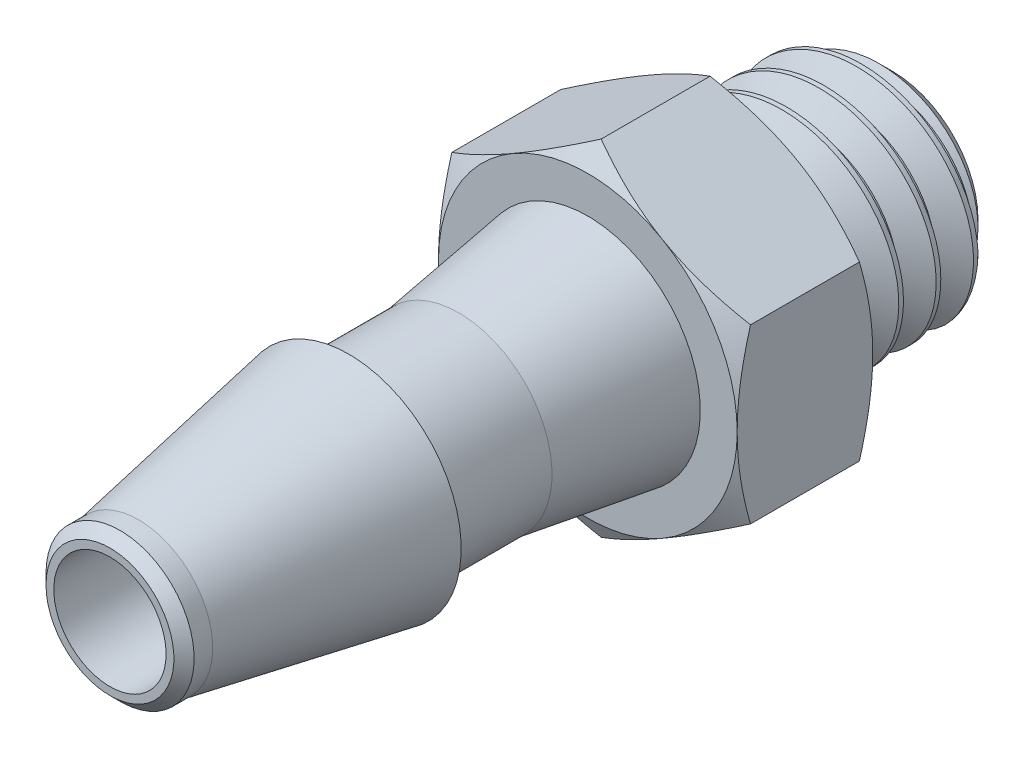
ISO-10303-21;
HEADER;
FILE_DESCRIPTION(('STEP AP214'),'2;1');
FILE_NAME('part.step','',(''),(''),'','','');
FILE_SCHEMA(('AUTOMOTIVE_DESIGN { 1 0 10303 214 1 1 1 1 }'));
ENDSEC;
DATA;
#1=APPLICATION_CONTEXT('core data for automotive mechanical design processes');
#2=APPLICATION_PROTOCOL_DEFINITION('international standard','automotive_design',2000,#1);
#3=PRODUCT_CONTEXT('',#1,'mechanical');
#4=PRODUCT('Part','Part','',(#3));
#5=PRODUCT_RELATED_PRODUCT_CATEGORY('part','',(#4));
#6=PRODUCT_DEFINITION_FORMATION('','',#4);
#7=PRODUCT_DEFINITION_CONTEXT('part definition',#1,'design');
#8=PRODUCT_DEFINITION('design','',#6,#7);
#9=PRODUCT_DEFINITION_SHAPE('','',#8);
#10=(LENGTH_UNIT() NAMED_UNIT(*) SI_UNIT(.MILLI.,.METRE.));
#11=(NAMED_UNIT(*) PLANE_ANGLE_UNIT() SI_UNIT($,.RADIAN.));
#12=(NAMED_UNIT(*) SI_UNIT($,.STERADIAN.) SOLID_ANGLE_UNIT());
#13=UNCERTAINTY_MEASURE_WITH_UNIT(LENGTH_MEASURE(1.E-05),#10,'distance_accuracy_value','');
#14=(GEOMETRIC_REPRESENTATION_CONTEXT(3) GLOBAL_UNCERTAINTY_ASSIGNED_CONTEXT((#13)) GLOBAL_UNIT_ASSIGNED_CONTEXT((#10,
#11,#12)) REPRESENTATION_CONTEXT('',''));
#15=CARTESIAN_POINT('',(0.,0.,0.));
#16=DIRECTION('',(0.,0.,1.));
#17=DIRECTION('',(1.,0.,0.));
#18=AXIS2_PLACEMENT_3D('',#15,#16,#17);
#19=CARTESIAN_POINT('',(-2.667,0.,-5.0165));
#20=DIRECTION('',(0.,0.,-1.));
#21=DIRECTION('',(-1.,0.,0.));
#22=AXIS2_PLACEMENT_3D('',#19,#20,#21);
#23=PLANE('',#22);
#24=CARTESIAN_POINT('',(0.,0.,-5.0165));
#25=DIRECTION('',(0.,0.,-1.));
#26=DIRECTION('',(-1.,0.,0.));
#27=AXIS2_PLACEMENT_3D('',#24,#25,#26);
#28=CIRCLE('',#27,2.413);
#29=CARTESIAN_POINT('',(-2.04200585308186,1.28560534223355,-5.01649999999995));
#30=VERTEX_POINT('',#29);
#31=CARTESIAN_POINT('',(-0.534855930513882,2.35297644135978,-5.01649999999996));
#32=VERTEX_POINT('',#31);
#33=EDGE_CURVE('E193',#30,#32,#28,.T.);
#34=ORIENTED_EDGE('',*,*,#33,.F.);
#35=EDGE_CURVE('E525',#32,#30,#28,.T.);
#36=ORIENTED_EDGE('',*,*,#35,.F.);
#37=EDGE_LOOP('',(#34,#36));
#38=FACE_BOUND('',#37,.T.);
#39=CARTESIAN_POINT('',(0.,0.,-5.0165));
#40=DIRECTION('',(0.,0.,-1.));
#41=DIRECTION('',(-1.,0.,0.));
#42=AXIS2_PLACEMENT_3D('',#39,#40,#41);
#43=CIRCLE('',#42,2.667);
#44=CARTESIAN_POINT('',(-2.667,0.,-5.0165));
#45=VERTEX_POINT('',#44);
#46=EDGE_CURVE('E548',#45,#45,#43,.T.);
#47=ORIENTED_EDGE('',*,*,#46,.T.);
#48=EDGE_LOOP('',(#47));
#49=FACE_BOUND('',#48,.T.);
#50=ADVANCED_FACE('F49',(#38,#49),#23,.T.);
#51=CARTESIAN_POINT('',(0.,0.,-1.8415));
#52=DIRECTION('',(0.,0.,-1.));
#53=DIRECTION('',(-1.,0.,0.));
#54=AXIS2_PLACEMENT_3D('',#51,#52,#53);
#55=CYLINDRICAL_SURFACE('',#54,1.9812);
#56=CARTESIAN_POINT('',(0.,0.,3.2385));
#57=DIRECTION('',(0.,0.,-1.));
#58=DIRECTION('',(-1.,0.,0.));
#59=AXIS2_PLACEMENT_3D('',#56,#57,#58);
#60=CIRCLE('',#59,1.9812);
#61=CARTESIAN_POINT('',(-1.9812,0.,3.2385));
#62=VERTEX_POINT('',#61);
#63=EDGE_CURVE('E440',#62,#62,#60,.T.);
#64=ORIENTED_EDGE('',*,*,#63,.T.);
#65=EDGE_LOOP('',(#64));
#66=FACE_BOUND('',#65,.T.);
#67=CARTESIAN_POINT('',(0.,0.,0.901699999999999));
#68=DIRECTION('',(0.,0.,-1.));
#69=DIRECTION('',(-1.,0.,0.));
#70=AXIS2_PLACEMENT_3D('',#67,#68,#69);
#71=CIRCLE('',#70,1.9812);
#72=CARTESIAN_POINT('',(-1.9812,0.,0.901699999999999));
#73=VERTEX_POINT('',#72);
#74=EDGE_CURVE('E442',#73,#73,#71,.T.);
#75=ORIENTED_EDGE('',*,*,#74,.F.);
#76=EDGE_LOOP('',(#75));
#77=FACE_BOUND('',#76,.T.);
#78=ADVANCED_FACE('F278',(#66,#77),#55,.T.);
#79=CARTESIAN_POINT('',(0.,0.,-1.8415));
#80=DIRECTION('',(0.,0.,-1.));
#81=DIRECTION('',(-1.,0.,0.));
#82=AXIS2_PLACEMENT_3D('',#79,#80,#81);
#83=CONICAL_SURFACE('',#82,2.39117398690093,0.148352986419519);
#84=ORIENTED_EDGE('',*,*,#74,.T.);
#85=EDGE_LOOP('',(#84));
#86=FACE_BOUND('',#85,.T.);
#87=CARTESIAN_POINT('',(0.,0.,-1.8415));
#88=DIRECTION('',(0.,0.,-1.));
#89=DIRECTION('',(-1.,0.,0.));
#90=AXIS2_PLACEMENT_3D('',#87,#88,#89);
#91=CIRCLE('',#90,2.39117398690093);
#92=CARTESIAN_POINT('',(-2.39117398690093,0.,-1.8415));
#93=VERTEX_POINT('',#92);
#94=EDGE_CURVE('E449',#93,#93,#91,.T.);
#95=ORIENTED_EDGE('',*,*,#94,.F.);
#96=EDGE_LOOP('',(#95));
#97=FACE_BOUND('',#96,.T.);
#98=ADVANCED_FACE('F280',(#86,#97),#83,.T.);
#99=CARTESIAN_POINT('',(0.,0.,-1.8415));
#100=DIRECTION('',(0.,0.,1.));
#101=DIRECTION('',(1.,0.,0.));
#102=AXIS2_PLACEMENT_3D('',#99,#100,#101);
#103=PLANE('',#102);
#104=ORIENTED_EDGE('',*,*,#94,.T.);
#105=EDGE_LOOP('',(#104));
#106=FACE_BOUND('',#105,.T.);
#107=CARTESIAN_POINT('',(0.,0.,-1.8415));
#108=DIRECTION('',(0.,0.,1.));
#109=DIRECTION('',(1.,0.,0.));
#110=AXIS2_PLACEMENT_3D('',#107,#108,#109);
#111=CIRCLE('',#110,3.175);
#112=CARTESIAN_POINT('',(1.5875,-2.74963065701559,-1.8415));
#113=VERTEX_POINT('',#112);
#114=CARTESIAN_POINT('',(3.175,0.,-1.8415));
#115=VERTEX_POINT('',#114);
#116=EDGE_CURVE('E178',#113,#115,#111,.T.);
#117=ORIENTED_EDGE('',*,*,#116,.T.);
#118=CARTESIAN_POINT('',(0.,0.,-1.8415));
#119=DIRECTION('',(0.,0.,1.));
#120=DIRECTION('',(1.,0.,0.));
#121=AXIS2_PLACEMENT_3D('',#118,#119,#120);
#122=CIRCLE('',#121,3.175);
#123=CARTESIAN_POINT('',(1.5875,2.74963065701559,-1.8415));
#124=VERTEX_POINT('',#123);
#125=EDGE_CURVE('E520',#115,#124,#122,.T.);
#126=ORIENTED_EDGE('',*,*,#125,.T.);
#127=CARTESIAN_POINT('',(-1.5875,2.74963065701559,-1.8415));
#128=VERTEX_POINT('',#127);
#129=EDGE_CURVE('E172',#124,#128,#111,.T.);
#130=ORIENTED_EDGE('',*,*,#129,.T.);
#131=CARTESIAN_POINT('',(-3.175,0.,-1.8415));
#132=VERTEX_POINT('',#131);
#133=EDGE_CURVE('E176',#128,#132,#111,.T.);
#134=ORIENTED_EDGE('',*,*,#133,.T.);
#135=CARTESIAN_POINT('',(-1.5875,-2.74963065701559,-1.8415));
#136=VERTEX_POINT('',#135);
#137=EDGE_CURVE('E495',#132,#136,#111,.T.);
#138=ORIENTED_EDGE('',*,*,#137,.T.);
#139=EDGE_CURVE('E491',#136,#113,#111,.T.);
#140=ORIENTED_EDGE('',*,*,#139,.T.);
#141=EDGE_LOOP('',(#117,#126,#130,#134,#138,#140));
#142=FACE_BOUND('',#141,.T.);
#143=ADVANCED_FACE('F287',(#106,#142),#103,.T.);
#144=CARTESIAN_POINT('',(0.,0.,-1.8415));
#145=DIRECTION('',(0.,0.,-1.));
#146=DIRECTION('',(1.,0.,0.));
#147=AXIS2_PLACEMENT_3D('',#144,#145,#146);
#148=CONICAL_SURFACE('',#147,3.175,1.0471975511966);
#149=CARTESIAN_POINT('',(3.1752,1.83297163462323,-2.12514623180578));
#150=CARTESIAN_POINT('',(3.03567460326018,1.91352665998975,-2.07861993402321));
#151=CARTESIAN_POINT('',(2.89494483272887,1.994777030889,-2.03630586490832));
#152=CARTESIAN_POINT('',(2.61104837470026,2.1586847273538,-1.96244600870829));
#153=CARTESIAN_POINT('',(2.46787664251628,2.24134496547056,-1.93092635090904));
#154=CARTESIAN_POINT('',(2.18330753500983,2.40564101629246,-1.88186110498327));
#155=CARTESIAN_POINT('',(2.0419539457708,2.48725154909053,-1.86398896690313));
#156=CARTESIAN_POINT('',(1.75858160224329,2.65085664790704,-1.8426528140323));
#157=CARTESIAN_POINT('',(1.61656387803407,2.73285061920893,-1.8391711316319));
#158=CARTESIAN_POINT('',(1.35119263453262,2.88606277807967,-1.84641170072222));
#159=CARTESIAN_POINT('',(1.22779940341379,2.95730389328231,-1.85535614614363));
#160=CARTESIAN_POINT('',(0.981816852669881,3.09932198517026,-1.88370557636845));
#161=CARTESIAN_POINT('',(0.859228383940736,3.17009847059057,-1.90312024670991));
#162=CARTESIAN_POINT('',(0.612738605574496,3.31240941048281,-1.95165573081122));
#163=CARTESIAN_POINT('',(0.488868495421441,3.38392585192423,-1.98098229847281));
#164=CARTESIAN_POINT('',(0.242975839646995,3.52589204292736,-2.04754219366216));
#165=CARTESIAN_POINT('',(0.120950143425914,3.59634361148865,-2.08475988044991));
#166=CARTESIAN_POINT('',(-0.000199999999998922,3.66628967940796,-2.12514623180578));
#167=B_SPLINE_CURVE_WITH_KNOTS('',3,(#149,#150,#151,#152,#153,#154,#155,#156,#157,#158,#159,
#160,#161,#162,#163,#164,#165,#166),.UNSPECIFIED.,.F.,.F.,(4,2,2,2,2,2,2,2,4),(0.,
0.503278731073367,1.00776724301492,1.49976968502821,1.99116790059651,2.41904879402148,
2.84732618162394,3.28510386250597,3.72202181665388),.UNSPECIFIED.);
#168=CARTESIAN_POINT('',(0.,3.66617420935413,-2.12507956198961));
#169=VERTEX_POINT('',#168);
#170=EDGE_CURVE('E374',#124,#169,#167,.T.);
#171=ORIENTED_EDGE('',*,*,#170,.T.);
#172=CARTESIAN_POINT('',(0.00020000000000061,3.66628967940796,-2.12514623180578));
#173=CARTESIAN_POINT('',(-0.139325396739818,3.58573465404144,-2.07861993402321));
#174=CARTESIAN_POINT('',(-0.280055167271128,3.50448428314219,-2.03630586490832));
#175=CARTESIAN_POINT('',(-0.563951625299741,3.34057658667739,-1.96244600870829));
#176=CARTESIAN_POINT('',(-0.707123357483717,3.25791634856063,-1.93092635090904));
#177=CARTESIAN_POINT('',(-0.991692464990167,3.09362029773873,-1.88186110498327));
#178=CARTESIAN_POINT('',(-1.1330460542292,3.01200976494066,-1.86398896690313));
#179=CARTESIAN_POINT('',(-1.41641839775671,2.84840466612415,-1.8426528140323));
#180=CARTESIAN_POINT('',(-1.55843612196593,2.76641069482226,-1.8391711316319));
#181=CARTESIAN_POINT('',(-1.82380736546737,2.61319853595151,-1.84641170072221));
#182=CARTESIAN_POINT('',(-1.94720059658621,2.54195742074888,-1.85535614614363));
#183=CARTESIAN_POINT('',(-2.19318314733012,2.39993932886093,-1.88370557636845));
#184=CARTESIAN_POINT('',(-2.31577161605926,2.32916284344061,-1.90312024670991));
#185=CARTESIAN_POINT('',(-2.5622613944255,2.18685190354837,-1.95165573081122));
#186=CARTESIAN_POINT('',(-2.68613150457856,2.11533546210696,-1.98098229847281));
#187=CARTESIAN_POINT('',(-2.93202416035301,1.97336927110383,-2.04754219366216));
#188=CARTESIAN_POINT('',(-3.05404985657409,1.90291770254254,-2.08475988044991));
#189=CARTESIAN_POINT('',(-3.1752,1.83297163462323,-2.12514623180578));
#190=B_SPLINE_CURVE_WITH_KNOTS('',3,(#172,#173,#174,#175,#176,#177,#178,#179,#180,#181,#182,
#183,#184,#185,#186,#187,#188,#189),.UNSPECIFIED.,.F.,.F.,(4,2,2,2,2,2,2,2,4),(0.,
0.503278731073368,1.00776724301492,1.49976968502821,1.99116790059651,2.41904879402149,
2.84732618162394,3.28510386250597,3.72202181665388),.UNSPECIFIED.);
#191=EDGE_CURVE('E373',#169,#128,#190,.T.);
#192=ORIENTED_EDGE('',*,*,#191,.T.);
#193=ORIENTED_EDGE('',*,*,#129,.F.);
#194=EDGE_LOOP('',(#171,#192,#193));
#195=FACE_BOUND('',#194,.T.);
#196=ADVANCED_FACE('F413',(#195),#148,.T.);
#197=CARTESIAN_POINT('',(-3.175,1.83308710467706,-2.12507956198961));
#198=VERTEX_POINT('',#197);
#199=EDGE_CURVE('E365',#128,#198,#190,.T.);
#200=ORIENTED_EDGE('',*,*,#199,.T.);
#201=CARTESIAN_POINT('',(-3.175,-5.02397314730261,-3.43968725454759));
#202=CARTESIAN_POINT('',(-3.175,-4.88441350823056,-3.37159193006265));
#203=CARTESIAN_POINT('',(-3.175,-4.74454401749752,-3.30412126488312));
#204=CARTESIAN_POINT('',(-3.175,-4.46402088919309,-3.17077873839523));
#205=CARTESIAN_POINT('',(-3.175,-4.32336714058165,-3.1049071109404));
#206=CARTESIAN_POINT('',(-3.175,-4.04043337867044,-2.97480190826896));
#207=CARTESIAN_POINT('',(-3.175,-3.89814873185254,-2.91057837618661));
#208=CARTESIAN_POINT('',(-3.175,-3.61248204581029,-2.78462965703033));
#209=CARTESIAN_POINT('',(-3.175,-3.46910005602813,-2.72290435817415));
#210=CARTESIAN_POINT('',(-3.175,-3.17604741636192,-2.60053594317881));
#211=CARTESIAN_POINT('',(-3.175,-3.02633033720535,-2.54000343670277));
#212=CARTESIAN_POINT('',(-3.175,-2.72518195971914,-2.42328215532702));
#213=CARTESIAN_POINT('',(-3.175,-2.57375047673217,-2.3670938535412));
#214=CARTESIAN_POINT('',(-3.175,-2.26918476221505,-2.26046295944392));
#215=CARTESIAN_POINT('',(-3.175,-2.1160543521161,-2.21000955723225));
#216=CARTESIAN_POINT('',(-3.175,-1.80759913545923,-2.11640077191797));
#217=CARTESIAN_POINT('',(-3.175,-1.65227500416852,-2.07324319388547));
#218=CARTESIAN_POINT('',(-3.175,-1.34020976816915,-1.99646075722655));
#219=CARTESIAN_POINT('',(-3.175,-1.18348225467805,-1.96278164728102));
#220=CARTESIAN_POINT('',(-3.175,-0.867977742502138,-1.90679156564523));
#221=CARTESIAN_POINT('',(-3.175,-0.709200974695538,-1.88447932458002));
#222=CARTESIAN_POINT('',(-3.175,-0.392503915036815,-1.85328936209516));
#223=CARTESIAN_POINT('',(-3.175,-0.234601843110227,-1.84423121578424));
#224=CARTESIAN_POINT('',(-3.175,0.081411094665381,-1.83983547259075));
#225=CARTESIAN_POINT('',(-3.175,0.239521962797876,-1.84449802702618));
#226=CARTESIAN_POINT('',(-3.175,0.505035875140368,-1.86351048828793));
#227=CARTESIAN_POINT('',(-3.175,0.612708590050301,-1.8743424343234));
#228=CARTESIAN_POINT('',(-3.175,0.827325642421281,-1.90174740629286));
#229=CARTESIAN_POINT('',(-3.175,0.93426988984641,-1.91832112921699));
#230=CARTESIAN_POINT('',(-3.175,1.25383113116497,-1.97578990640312));
#231=CARTESIAN_POINT('',(-3.175,1.46507511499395,-2.02442428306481));
#232=CARTESIAN_POINT('',(-3.175,1.78114631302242,-2.10953395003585));
#233=CARTESIAN_POINT('',(-3.175,1.88758921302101,-2.14035762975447));
#234=CARTESIAN_POINT('',(-3.175,2.09944305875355,-2.20539898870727));
#235=CARTESIAN_POINT('',(-3.175,2.20485399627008,-2.23961669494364));
#236=CARTESIAN_POINT('',(-3.175,2.41467499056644,-2.31088119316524));
#237=CARTESIAN_POINT('',(-3.175,2.5190853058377,-2.34792723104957));
#238=CARTESIAN_POINT('',(-3.175,2.7270269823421,-2.42439342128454));
#239=CARTESIAN_POINT('',(-3.175,2.83055836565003,-2.4638135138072));
#240=CARTESIAN_POINT('',(-3.175,3.11504662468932,-2.57527516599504));
#241=CARTESIAN_POINT('',(-3.175,3.29519089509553,-2.64938906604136));
#242=CARTESIAN_POINT('',(-3.175,3.65356314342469,-2.80213029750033));
#243=CARTESIAN_POINT('',(-3.175,3.83179088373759,-2.88075818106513));
#244=CARTESIAN_POINT('',(-3.175,4.18677628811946,-3.04143013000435));
#245=CARTESIAN_POINT('',(-3.175,4.36353336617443,-3.12347548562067));
#246=CARTESIAN_POINT('',(-3.175,4.7158261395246,-3.29015338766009));
#247=CARTESIAN_POINT('',(-3.175,4.89136179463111,-3.37478601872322));
#248=CARTESIAN_POINT('',(-3.175,5.24174299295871,-3.54620065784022));
#249=CARTESIAN_POINT('',(-3.175,5.41658688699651,-3.63298602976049));
#250=CARTESIAN_POINT('',(-3.175,5.76547677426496,-3.80814775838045));
#251=CARTESIAN_POINT('',(-3.175,5.9395227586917,-3.89652413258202));
#252=CARTESIAN_POINT('',(-3.175,6.4606063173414,-4.16350013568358));
#253=CARTESIAN_POINT('',(-3.175,6.80667539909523,-4.34398909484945));
#254=CARTESIAN_POINT('',(-3.175,7.45917123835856,-4.68831605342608));
#255=CARTESIAN_POINT('',(-3.175,7.76578141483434,-4.85180818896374));
#256=CARTESIAN_POINT('',(-3.175,8.37798508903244,-5.18073353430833));
#257=CARTESIAN_POINT('',(-3.175,8.68357851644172,-5.34616687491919));
#258=CARTESIAN_POINT('',(-3.175,9.29290559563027,-5.67787595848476));
#259=CARTESIAN_POINT('',(-3.175,9.59664200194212,-5.84414664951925));
#260=CARTESIAN_POINT('',(-3.175,10.2034809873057,-6.1777804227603));
#261=CARTESIAN_POINT('',(-3.175,10.5065836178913,-6.34514341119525));
#262=CARTESIAN_POINT('',(-3.175,10.8094653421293,-6.51290278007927));
#263=B_SPLINE_CURVE_WITH_KNOTS('',3,(#201,#202,#203,#204,#205,#206,#207,#208,#209,#210,#211,
#212,#213,#214,#215,#216,#217,#218,#219,#220,#221,#222,#223,#224,#225,#226,#227,#228,#229,#230,
#231,#232,#233,#234,#235,#236,#237,#238,#239,#240,#241,#242,#243,#244,#245,#246,#247,#248,#249,
#250,#251,#252,#253,#254,#255,#256,#257,#258,#259,#260,#261,#262),.UNSPECIFIED.,.F.,.F.,(4,2,2,
2,2,2,2,2,2,2,2,2,2,2,2,2,2,2,2,2,2,2,2,2,2,2,2,2,2,2,4),(0.,0.46586443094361,0.931796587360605,
1.40010010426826,1.86838264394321,2.35280389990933,2.83727783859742,3.32082287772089,
3.8042221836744,4.2847956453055,4.76531542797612,5.23923111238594,5.71315202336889,
6.03764510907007,6.36217759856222,7.01154671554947,7.34396375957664,7.67638344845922,
8.00871481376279,8.34103780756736,8.92532731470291,9.50968844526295,10.0942722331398,
10.6788751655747,11.2644576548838,11.8500465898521,13.0209370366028,14.0633576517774,
15.1058489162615,16.1446514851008,17.1833660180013),.UNSPECIFIED.);
#264=EDGE_CURVE('E372',#198,#132,#263,.F.);
#265=ORIENTED_EDGE('',*,*,#264,.T.);
#266=ORIENTED_EDGE('',*,*,#133,.F.);
#267=EDGE_LOOP('',(#200,#265,#266));
#268=FACE_BOUND('',#267,.T.);
#269=ADVANCED_FACE('F555',(#268),#148,.T.);
#270=CARTESIAN_POINT('',(-3.175,-1.83308710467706,-2.1250795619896));
#271=VERTEX_POINT('',#270);
#272=EDGE_CURVE('E380',#132,#271,#263,.F.);
#273=ORIENTED_EDGE('',*,*,#272,.T.);
#274=CARTESIAN_POINT('',(-3.1752,-1.83297163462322,-2.12514623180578));
#275=CARTESIAN_POINT('',(-3.03567460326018,-1.91352665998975,-2.07861993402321));
#276=CARTESIAN_POINT('',(-2.89494483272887,-1.99477703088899,-2.03630586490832));
#277=CARTESIAN_POINT('',(-2.61104837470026,-2.15868472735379,-1.96244600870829));
#278=CARTESIAN_POINT('',(-2.46787664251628,-2.24134496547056,-1.93092635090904));
#279=CARTESIAN_POINT('',(-2.18330753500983,-2.40564101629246,-1.88186110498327));
#280=CARTESIAN_POINT('',(-2.0419539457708,-2.48725154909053,-1.86398896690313));
#281=CARTESIAN_POINT('',(-1.75858160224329,-2.65085664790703,-1.8426528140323));
#282=CARTESIAN_POINT('',(-1.61656387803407,-2.73285061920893,-1.8391711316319));
#283=CARTESIAN_POINT('',(-1.35119263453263,-2.88606277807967,-1.84641170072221));
#284=CARTESIAN_POINT('',(-1.22779940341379,-2.95730389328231,-1.85535614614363));
#285=CARTESIAN_POINT('',(-0.981816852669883,-3.09932198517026,-1.88370557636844));
#286=CARTESIAN_POINT('',(-0.859228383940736,-3.17009847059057,-1.90312024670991));
#287=CARTESIAN_POINT('',(-0.612738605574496,-3.31240941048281,-1.95165573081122));
#288=CARTESIAN_POINT('',(-0.488868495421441,-3.38392585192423,-1.9809822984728));
#289=CARTESIAN_POINT('',(-0.242975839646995,-3.52589204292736,-2.04754219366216));
#290=CARTESIAN_POINT('',(-0.120950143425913,-3.59634361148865,-2.08475988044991));
#291=CARTESIAN_POINT('',(0.000199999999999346,-3.66628967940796,-2.12514623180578));
#292=B_SPLINE_CURVE_WITH_KNOTS('',3,(#274,#275,#276,#277,#278,#279,#280,#281,#282,#283,#284,
#285,#286,#287,#288,#289,#290,#291),.UNSPECIFIED.,.F.,.F.,(4,2,2,2,2,2,2,2,4),(0.,
0.503278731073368,1.00776724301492,1.49976968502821,1.99116790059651,2.41904879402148,
2.84732618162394,3.28510386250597,3.72202181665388),.UNSPECIFIED.);
#293=EDGE_CURVE('E386',#271,#136,#292,.T.);
#294=ORIENTED_EDGE('',*,*,#293,.T.);
#295=ORIENTED_EDGE('',*,*,#137,.F.);
#296=EDGE_LOOP('',(#273,#294,#295));
#297=FACE_BOUND('',#296,.T.);
#298=ADVANCED_FACE('F512',(#297),#148,.T.);
#299=CARTESIAN_POINT('',(0.,-3.66617420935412,-2.1250795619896));
#300=VERTEX_POINT('',#299);
#301=EDGE_CURVE('E387',#136,#300,#292,.T.);
#302=ORIENTED_EDGE('',*,*,#301,.T.);
#303=CARTESIAN_POINT('',(-0.000200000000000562,-3.66628967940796,-2.12514623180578));
#304=CARTESIAN_POINT('',(0.139325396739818,-3.58573465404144,-2.07861993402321));
#305=CARTESIAN_POINT('',(0.280055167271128,-3.50448428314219,-2.03630586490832));
#306=CARTESIAN_POINT('',(0.563951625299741,-3.34057658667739,-1.96244600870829));
#307=CARTESIAN_POINT('',(0.707123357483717,-3.25791634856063,-1.93092635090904));
#308=CARTESIAN_POINT('',(0.991692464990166,-3.09362029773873,-1.88186110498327));
#309=CARTESIAN_POINT('',(1.1330460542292,-3.01200976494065,-1.86398896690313));
#310=CARTESIAN_POINT('',(1.41641839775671,-2.84840466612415,-1.8426528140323));
#311=CARTESIAN_POINT('',(1.55843612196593,-2.76641069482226,-1.8391711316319));
#312=CARTESIAN_POINT('',(1.82380736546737,-2.61319853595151,-1.84641170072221));
#313=CARTESIAN_POINT('',(1.94720059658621,-2.54195742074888,-1.85535614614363));
#314=CARTESIAN_POINT('',(2.19318314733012,-2.39993932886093,-1.88370557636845));
#315=CARTESIAN_POINT('',(2.31577161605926,-2.32916284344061,-1.90312024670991));
#316=CARTESIAN_POINT('',(2.5622613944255,-2.18685190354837,-1.95165573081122));
#317=CARTESIAN_POINT('',(2.68613150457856,-2.11533546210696,-1.9809822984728));
#318=CARTESIAN_POINT('',(2.932024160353,-1.97336927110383,-2.04754219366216));
#319=CARTESIAN_POINT('',(3.05404985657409,-1.90291770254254,-2.08475988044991));
#320=CARTESIAN_POINT('',(3.1752,-1.83297163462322,-2.12514623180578));
#321=B_SPLINE_CURVE_WITH_KNOTS('',3,(#303,#304,#305,#306,#307,#308,#309,#310,#311,#312,#313,
#314,#315,#316,#317,#318,#319,#320),.UNSPECIFIED.,.F.,.F.,(4,2,2,2,2,2,2,2,4),(0.,
0.503278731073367,1.00776724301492,1.49976968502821,1.99116790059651,2.41904879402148,
2.84732618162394,3.28510386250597,3.72202181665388),.UNSPECIFIED.);
#322=EDGE_CURVE('E393',#300,#113,#321,.T.);
#323=ORIENTED_EDGE('',*,*,#322,.T.);
#324=ORIENTED_EDGE('',*,*,#139,.F.);
#325=EDGE_LOOP('',(#302,#323,#324));
#326=FACE_BOUND('',#325,.T.);
#327=ADVANCED_FACE('F519',(#326),#148,.T.);
#328=CARTESIAN_POINT('',(3.175,-5.02397315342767,-3.43968725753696));
#329=CARTESIAN_POINT('',(3.175,-4.88441351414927,-3.37159193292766));
#330=CARTESIAN_POINT('',(3.175,-4.74454402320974,-3.30412126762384));
#331=CARTESIAN_POINT('',(3.175,-4.46402089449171,-3.17077874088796));
#332=CARTESIAN_POINT('',(3.175,-4.32336714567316,-3.10490711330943));
#333=CARTESIAN_POINT('',(3.175,-4.04043338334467,-2.97480191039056));
#334=CARTESIAN_POINT('',(3.175,-3.8981487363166,-2.91057837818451));
#335=CARTESIAN_POINT('',(3.175,-3.61248204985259,-2.78462965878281));
#336=CARTESIAN_POINT('',(3.175,-3.46910005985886,-2.72290435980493));
#337=CARTESIAN_POINT('',(3.175,-3.17604741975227,-2.6005359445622));
#338=CARTESIAN_POINT('',(3.175,-3.02633034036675,-2.54000343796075));
#339=CARTESIAN_POINT('',(3.175,-2.72518196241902,-2.42328215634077));
#340=CARTESIAN_POINT('',(3.175,-2.57375047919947,-2.36709385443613));
#341=CARTESIAN_POINT('',(3.175,-2.26918476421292,-2.26046296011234));
#342=CARTESIAN_POINT('',(3.175,-2.11605435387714,-2.21000955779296));
#343=CARTESIAN_POINT('',(3.175,-1.80759913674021,-2.11640077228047));
#344=CARTESIAN_POINT('',(3.175,-1.65227500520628,-2.07324319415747));
#345=CARTESIAN_POINT('',(3.175,-1.34020976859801,-1.99646075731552));
#346=CARTESIAN_POINT('',(3.175,-1.18348225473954,-1.96278164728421));
#347=CARTESIAN_POINT('',(3.175,-0.867977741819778,-1.90679156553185));
#348=CARTESIAN_POINT('',(3.175,-0.709200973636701,-1.88447932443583));
#349=CARTESIAN_POINT('',(3.175,-0.392503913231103,-1.85328936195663));
#350=CARTESIAN_POINT('',(3.175,-0.234601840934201,-1.84423121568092));
#351=CARTESIAN_POINT('',(3.175,0.0814110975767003,-1.83983547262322));
#352=CARTESIAN_POINT('',(3.175,0.239521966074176,-1.84449802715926));
#353=CARTESIAN_POINT('',(3.175,0.505035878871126,-1.86351048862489));
#354=CARTESIAN_POINT('',(3.175,0.612708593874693,-1.87434243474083));
#355=CARTESIAN_POINT('',(3.175,0.827325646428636,-1.90174740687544));
#356=CARTESIAN_POINT('',(3.175,0.934269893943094,-1.91832112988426));
#357=CARTESIAN_POINT('',(3.175,1.25383113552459,-1.97578990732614));
#358=CARTESIAN_POINT('',(3.175,1.46507511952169,-2.0244242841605));
#359=CARTESIAN_POINT('',(3.175,1.78114631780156,-2.10953395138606));
#360=CARTESIAN_POINT('',(3.175,1.88758921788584,-2.1403576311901));
#361=CARTESIAN_POINT('',(3.175,2.09944306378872,-2.20539899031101));
#362=CARTESIAN_POINT('',(3.175,2.2048540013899,-2.23961669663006));
#363=CARTESIAN_POINT('',(3.175,2.41467499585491,-2.31088119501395));
#364=CARTESIAN_POINT('',(3.175,2.51908531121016,-2.34792723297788));
#365=CARTESIAN_POINT('',(3.175,2.72702698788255,-2.42439342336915));
#366=CARTESIAN_POINT('',(3.175,2.83055837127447,-2.46381351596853));
#367=CARTESIAN_POINT('',(3.175,3.11504663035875,-2.57527516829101));
#368=CARTESIAN_POINT('',(3.175,3.29519090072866,-2.64938906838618));
#369=CARTESIAN_POINT('',(3.175,3.65356314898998,-2.80213029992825));
#370=CARTESIAN_POINT('',(3.175,3.83179088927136,-2.88075818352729));
#371=CARTESIAN_POINT('',(3.175,4.18677629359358,-3.04143013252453));
#372=CARTESIAN_POINT('',(3.175,4.36353337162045,-3.12347548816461));
#373=CARTESIAN_POINT('',(3.175,4.71582614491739,-3.2901533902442));
#374=CARTESIAN_POINT('',(3.175,4.89136179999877,-3.37478602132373));
#375=CARTESIAN_POINT('',(3.175,5.2417429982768,-3.54620066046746));
#376=CARTESIAN_POINT('',(3.175,5.41658689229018,-3.63298603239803));
#377=CARTESIAN_POINT('',(3.175,5.76547677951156,-3.80814776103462));
#378=CARTESIAN_POINT('',(3.175,5.93952276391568,-3.89652413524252));
#379=CARTESIAN_POINT('',(3.175,6.46060632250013,-4.16350013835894));
#380=CARTESIAN_POINT('',(3.175,6.80667540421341,-4.34398909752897));
#381=CARTESIAN_POINT('',(3.175,7.459171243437,-4.68831605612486));
#382=CARTESIAN_POINT('',(3.175,7.76578141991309,-4.85180819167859));
#383=CARTESIAN_POINT('',(3.175,8.3779850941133,-5.18073353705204));
#384=CARTESIAN_POINT('',(3.175,8.68357852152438,-5.3461668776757));
#385=CARTESIAN_POINT('',(3.175,9.29290560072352,-5.67787596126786));
#386=CARTESIAN_POINT('',(3.175,9.59664200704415,-5.84414665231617));
#387=CARTESIAN_POINT('',(3.175,10.2034809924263,-6.17778042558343));
#388=CARTESIAN_POINT('',(3.175,10.5065836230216,-6.34514341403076));
#389=CARTESIAN_POINT('',(3.175,10.8094653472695,-6.5129027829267));
#390=B_SPLINE_CURVE_WITH_KNOTS('',3,(#328,#329,#330,#331,#332,#333,#334,#335,#336,#337,#338,
#339,#340,#341,#342,#343,#344,#345,#346,#347,#348,#349,#350,#351,#352,#353,#354,#355,#356,#357,
#358,#359,#360,#361,#362,#363,#364,#365,#366,#367,#368,#369,#370,#371,#372,#373,#374,#375,#376,
#377,#378,#379,#380,#381,#382,#383,#384,#385,#386,#387,#388,#389),.UNSPECIFIED.,.F.,.F.,(4,2,2,
2,2,2,2,2,2,2,2,2,2,2,2,2,2,2,2,2,2,2,2,2,2,2,2,2,2,2,4),(0.,0.465864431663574,
0.931796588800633,1.40010010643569,1.86838264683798,2.35280390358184,2.83727784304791,
3.32082288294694,3.8042221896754,4.28479565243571,4.7653154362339,5.23923112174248,
5.71315203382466,6.03764511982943,6.36217760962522,7.01154672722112,7.34396377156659,
7.67638346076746,8.00871482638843,8.34103782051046,8.92532732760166,9.50968845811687,
10.0942722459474,10.6788751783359,11.2644576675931,11.8500466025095,13.0209370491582,
14.0633576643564,15.1058489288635,16.1446514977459,17.1833660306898),.UNSPECIFIED.);
#391=CARTESIAN_POINT('',(3.175,1.83308710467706,-2.1250795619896));
#392=VERTEX_POINT('',#391);
#393=EDGE_CURVE('E543',#115,#392,#390,.T.);
#394=ORIENTED_EDGE('',*,*,#393,.T.);
#395=EDGE_CURVE('E79',#392,#124,#167,.T.);
#396=ORIENTED_EDGE('',*,*,#395,.T.);
#397=ORIENTED_EDGE('',*,*,#125,.F.);
#398=EDGE_LOOP('',(#394,#396,#397));
#399=FACE_BOUND('',#398,.T.);
#400=ADVANCED_FACE('F556',(#399),#148,.T.);
#401=CARTESIAN_POINT('',(3.175,-1.83308710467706,-2.1250795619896));
#402=VERTEX_POINT('',#401);
#403=EDGE_CURVE('E471',#402,#115,#390,.T.);
#404=ORIENTED_EDGE('',*,*,#403,.T.);
#405=ORIENTED_EDGE('',*,*,#116,.F.);
#406=EDGE_CURVE('E394',#113,#402,#321,.T.);
#407=ORIENTED_EDGE('',*,*,#406,.T.);
#408=EDGE_LOOP('',(#404,#405,#407));
#409=FACE_BOUND('',#408,.T.);
#410=ADVANCED_FACE('F303',(#409),#148,.T.);
#411=CARTESIAN_POINT('',(3.175,1.83308710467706,-1.8415));
#412=DIRECTION('',(-0.5,-0.866025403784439,0.));
#413=DIRECTION('',(0.866025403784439,-0.5,0.));
#414=AXIS2_PLACEMENT_3D('',#411,#412,#413);
#415=PLANE('',#414);
#416=ORIENTED_EDGE('',*,*,#395,.F.);
#417=DIRECTION('',(0.,0.,-1.));
#418=VECTOR('',#417,1.);
#419=CARTESIAN_POINT('',(3.175,1.83308710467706,-1.8415));
#420=LINE('',#419,#418);
#421=CARTESIAN_POINT('',(3.175,1.83308710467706,-4.43962650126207));
#422=VERTEX_POINT('',#421);
#423=EDGE_CURVE('E467',#392,#422,#420,.T.);
#424=ORIENTED_EDGE('',*,*,#423,.T.);
#425=CARTESIAN_POINT('',(-0.0001999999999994,3.66628967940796,-4.43955983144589));
#426=CARTESIAN_POINT('',(0.139325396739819,3.58573465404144,-4.48608612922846));
#427=CARTESIAN_POINT('',(0.28005516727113,3.50448428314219,-4.52840019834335));
#428=CARTESIAN_POINT('',(0.563951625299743,3.34057658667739,-4.60226005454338));
#429=CARTESIAN_POINT('',(0.707123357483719,3.25791634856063,-4.63377971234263));
#430=CARTESIAN_POINT('',(0.991692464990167,3.09362029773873,-4.6828449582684));
#431=CARTESIAN_POINT('',(1.1330460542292,3.01200976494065,-4.70071709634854));
#432=CARTESIAN_POINT('',(1.41641839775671,2.84840466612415,-4.72205324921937));
#433=CARTESIAN_POINT('',(1.55843612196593,2.76641069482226,-4.72553493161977));
#434=CARTESIAN_POINT('',(1.82380736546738,2.61319853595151,-4.71829436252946));
#435=CARTESIAN_POINT('',(1.94720059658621,2.54195742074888,-4.70934991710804));
#436=CARTESIAN_POINT('',(2.19318314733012,2.39993932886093,-4.68100048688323));
#437=CARTESIAN_POINT('',(2.31577161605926,2.32916284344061,-4.66158581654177));
#438=CARTESIAN_POINT('',(2.5622613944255,2.18685190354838,-4.61305033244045));
#439=CARTESIAN_POINT('',(2.68613150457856,2.11533546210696,-4.58372376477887));
#440=CARTESIAN_POINT('',(2.932024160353,1.97336927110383,-4.51716386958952));
#441=CARTESIAN_POINT('',(3.05404985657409,1.90291770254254,-4.47994618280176));
#442=CARTESIAN_POINT('',(3.1752,1.83297163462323,-4.4395598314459));
#443=B_SPLINE_CURVE_WITH_KNOTS('',3,(#425,#426,#427,#428,#429,#430,#431,#432,#433,#434,#435,
#436,#437,#438,#439,#440,#441,#442),.UNSPECIFIED.,.F.,.F.,(4,2,2,2,2,2,2,2,4),(0.,
0.503278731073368,1.00776724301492,1.49976968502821,1.99116790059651,2.41904879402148,
2.84732618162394,3.28510386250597,3.72202181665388),.UNSPECIFIED.);
#444=CARTESIAN_POINT('',(0.,3.66617420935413,-4.43962650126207));
#445=VERTEX_POINT('',#444);
#446=EDGE_CURVE('E349',#445,#422,#443,.T.);
#447=ORIENTED_EDGE('',*,*,#446,.F.);
#448=DIRECTION('',(0.,0.,-1.));
#449=VECTOR('',#448,1.);
#450=CARTESIAN_POINT('',(0.,3.66617420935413,-1.8415));
#451=LINE('',#450,#449);
#452=EDGE_CURVE('E488',#169,#445,#451,.T.);
#453=ORIENTED_EDGE('',*,*,#452,.F.);
#454=ORIENTED_EDGE('',*,*,#170,.F.);
#455=EDGE_LOOP('',(#416,#424,#447,#453,#454));
#456=FACE_BOUND('',#455,.T.);
#457=ADVANCED_FACE('F359',(#456),#415,.F.);
#458=CARTESIAN_POINT('',(0.,3.66617420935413,-1.8415));
#459=DIRECTION('',(0.5,-0.866025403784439,0.));
#460=DIRECTION('',(0.866025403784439,0.5,0.));
#461=AXIS2_PLACEMENT_3D('',#458,#459,#460);
#462=PLANE('',#461);
#463=ORIENTED_EDGE('',*,*,#191,.F.);
#464=ORIENTED_EDGE('',*,*,#452,.T.);
#465=CARTESIAN_POINT('',(-3.1752,1.83297163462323,-4.43955983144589));
#466=CARTESIAN_POINT('',(-3.03567460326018,1.91352665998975,-4.48608612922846));
#467=CARTESIAN_POINT('',(-2.89494483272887,1.994777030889,-4.52840019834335));
#468=CARTESIAN_POINT('',(-2.61104837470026,2.1586847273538,-4.60226005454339));
#469=CARTESIAN_POINT('',(-2.46787664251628,2.24134496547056,-4.63377971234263));
#470=CARTESIAN_POINT('',(-2.18330753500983,2.40564101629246,-4.6828449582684));
#471=CARTESIAN_POINT('',(-2.0419539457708,2.48725154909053,-4.70071709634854));
#472=CARTESIAN_POINT('',(-1.75858160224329,2.65085664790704,-4.72205324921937));
#473=CARTESIAN_POINT('',(-1.61656387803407,2.73285061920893,-4.72553493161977));
#474=CARTESIAN_POINT('',(-1.35119263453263,2.88606277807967,-4.71829436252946));
#475=CARTESIAN_POINT('',(-1.22779940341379,2.95730389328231,-4.70934991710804));
#476=CARTESIAN_POINT('',(-0.981816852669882,3.09932198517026,-4.68100048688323));
#477=CARTESIAN_POINT('',(-0.859228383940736,3.17009847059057,-4.66158581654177));
#478=CARTESIAN_POINT('',(-0.612738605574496,3.31240941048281,-4.61305033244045));
#479=CARTESIAN_POINT('',(-0.488868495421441,3.38392585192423,-4.58372376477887));
#480=CARTESIAN_POINT('',(-0.242975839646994,3.52589204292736,-4.51716386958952));
#481=CARTESIAN_POINT('',(-0.120950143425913,3.59634361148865,-4.47994618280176));
#482=CARTESIAN_POINT('',(0.000200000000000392,3.66628967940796,-4.43955983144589));
#483=B_SPLINE_CURVE_WITH_KNOTS('',3,(#465,#466,#467,#468,#469,#470,#471,#472,#473,#474,#475,
#476,#477,#478,#479,#480,#481,#482),.UNSPECIFIED.,.F.,.F.,(4,2,2,2,2,2,2,2,4),(0.,
0.503278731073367,1.00776724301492,1.49976968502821,1.99116790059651,2.41904879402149,
2.84732618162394,3.28510386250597,3.72202181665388),.UNSPECIFIED.);
#484=CARTESIAN_POINT('',(-3.175,1.83308710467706,-4.43962650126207));
#485=VERTEX_POINT('',#484);
#486=EDGE_CURVE('E342',#485,#445,#483,.T.);
#487=ORIENTED_EDGE('',*,*,#486,.F.);
#488=DIRECTION('',(0.,0.,-1.));
#489=VECTOR('',#488,1.);
#490=CARTESIAN_POINT('',(-3.175,1.83308710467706,-1.8415));
#491=LINE('',#490,#489);
#492=EDGE_CURVE('E486',#198,#485,#491,.T.);
#493=ORIENTED_EDGE('',*,*,#492,.F.);
#494=ORIENTED_EDGE('',*,*,#199,.F.);
#495=EDGE_LOOP('',(#463,#464,#487,#493,#494));
#496=FACE_BOUND('',#495,.T.);
#497=ADVANCED_FACE('F355',(#496),#462,.F.);
#498=CARTESIAN_POINT('',(-3.175,1.83308710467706,-1.8415));
#499=DIRECTION('',(1.,0.,0.));
#500=DIRECTION('',(0.,0.,-1.));
#501=AXIS2_PLACEMENT_3D('',#498,#499,#500);
#502=PLANE('',#501);
#503=ORIENTED_EDGE('',*,*,#264,.F.);
#504=ORIENTED_EDGE('',*,*,#492,.T.);
#505=CARTESIAN_POINT('',(-3.175,-4.85102594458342,-3.20900183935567));
#506=CARTESIAN_POINT('',(-3.175,-4.71288857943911,-3.27571430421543));
#507=CARTESIAN_POINT('',(-3.175,-4.57442602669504,-3.34176538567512));
#508=CARTESIAN_POINT('',(-3.175,-4.2966771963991,-3.47217103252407));
#509=CARTESIAN_POINT('',(-3.175,-4.15739078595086,-3.53652531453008));
#510=CARTESIAN_POINT('',(-3.175,-3.87706818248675,-3.66350289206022));
#511=CARTESIAN_POINT('',(-3.175,-3.73602653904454,-3.72611419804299));
#512=CARTESIAN_POINT('',(-3.175,-3.45279487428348,-3.84867313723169));
#513=CARTESIAN_POINT('',(-3.175,-3.31060491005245,-3.90862090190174));
#514=CARTESIAN_POINT('',(-3.175,-3.02067337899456,-4.02684990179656));
#515=CARTESIAN_POINT('',(-3.175,-2.87289091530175,-4.08503141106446));
#516=CARTESIAN_POINT('',(-3.175,-2.57557071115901,-4.1968119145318));
#517=CARTESIAN_POINT('',(-3.175,-2.42603277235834,-4.25041038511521));
#518=CARTESIAN_POINT('',(-3.175,-2.12526753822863,-4.35156496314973));
#519=CARTESIAN_POINT('',(-3.175,-1.97404461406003,-4.3991339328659));
#520=CARTESIAN_POINT('',(-3.175,-1.66943227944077,-4.48665598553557));
#521=CARTESIAN_POINT('',(-3.175,-1.51604359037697,-4.52661154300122));
#522=CARTESIAN_POINT('',(-3.175,-1.20778705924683,-4.5967496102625));
#523=CARTESIAN_POINT('',(-3.175,-1.05292996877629,-4.62697848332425));
#524=CARTESIAN_POINT('',(-3.175,-0.741370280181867,-4.67588286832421));
#525=CARTESIAN_POINT('',(-3.175,-0.584667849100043,-4.69455941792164));
#526=CARTESIAN_POINT('',(-3.175,-0.272213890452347,-4.71862418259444));
#527=CARTESIAN_POINT('',(-3.175,-0.116475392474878,-4.72417743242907));
#528=CARTESIAN_POINT('',(-3.175,0.194919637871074,-4.72195496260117));
#529=CARTESIAN_POINT('',(-3.175,0.350576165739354,-4.71417857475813));
#530=CARTESIAN_POINT('',(-3.175,0.616960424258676,-4.69000261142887));
#531=CARTESIAN_POINT('',(-3.175,0.727980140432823,-4.67665303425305));
#532=CARTESIAN_POINT('',(-3.175,0.949154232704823,-4.64404372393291));
#533=CARTESIAN_POINT('',(-3.175,1.05930848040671,-4.62478313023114));
#534=CARTESIAN_POINT('',(-3.175,1.38834853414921,-4.55915306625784));
#535=CARTESIAN_POINT('',(-3.175,1.60568605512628,-4.50494816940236));
#536=CARTESIAN_POINT('',(-3.175,1.93076061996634,-4.41158238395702));
#537=CARTESIAN_POINT('',(-3.175,2.0401946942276,-4.37799980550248));
#538=CARTESIAN_POINT('',(-3.175,2.25799792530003,-4.30751225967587));
#539=CARTESIAN_POINT('',(-3.175,2.3663670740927,-4.27060726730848));
#540=CARTESIAN_POINT('',(-3.175,2.58208056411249,-4.19405358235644));
#541=CARTESIAN_POINT('',(-3.175,2.68942524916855,-4.15440584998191));
#542=CARTESIAN_POINT('',(-3.175,2.9032339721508,-4.07281672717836));
#543=CARTESIAN_POINT('',(-3.175,3.00969802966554,-4.03087538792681));
#544=CARTESIAN_POINT('',(-3.175,3.29992804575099,-3.91351554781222));
#545=CARTESIAN_POINT('',(-3.175,3.48291700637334,-3.83617732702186));
#546=CARTESIAN_POINT('',(-3.175,3.84705597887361,-3.67727205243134));
#547=CARTESIAN_POINT('',(-3.175,4.02820579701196,-3.59570455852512));
#548=CARTESIAN_POINT('',(-3.175,4.38909598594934,-3.42936807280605));
#549=CARTESIAN_POINT('',(-3.175,4.56883588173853,-3.34459805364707));
#550=CARTESIAN_POINT('',(-3.175,4.92715224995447,-3.17262904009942));
#551=CARTESIAN_POINT('',(-3.175,5.1057286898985,-3.08542997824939));
#552=CARTESIAN_POINT('',(-3.175,5.46220611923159,-2.90901647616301));
#553=CARTESIAN_POINT('',(-3.175,5.64010574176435,-2.81979927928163));
#554=CARTESIAN_POINT('',(-3.175,5.99514625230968,-2.63986628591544));
#555=CARTESIAN_POINT('',(-3.175,6.17228713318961,-2.54915047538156));
#556=CARTESIAN_POINT('',(-3.175,6.70271399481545,-2.27525674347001));
#557=CARTESIAN_POINT('',(-3.175,7.05507862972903,-2.09029534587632));
#558=CARTESIAN_POINT('',(-3.175,7.72071992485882,-1.73706134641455));
#559=CARTESIAN_POINT('',(-3.175,8.03416628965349,-1.5691070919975));
#560=CARTESIAN_POINT('',(-3.175,8.66008119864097,-1.2313440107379));
#561=CARTESIAN_POINT('',(-3.175,8.97254968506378,-1.06153507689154));
#562=CARTESIAN_POINT('',(-3.175,9.59578322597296,-0.721069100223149));
#563=CARTESIAN_POINT('',(-3.175,9.9065505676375,-0.55041623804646));
#564=CARTESIAN_POINT('',(-3.175,10.5274775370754,-0.208061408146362));
#565=CARTESIAN_POINT('',(-3.175,10.8376372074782,-0.0363595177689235));
#566=CARTESIAN_POINT('',(-3.175,11.1475841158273,0.135723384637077));
#567=B_SPLINE_CURVE_WITH_KNOTS('',3,(#505,#506,#507,#508,#509,#510,#511,#512,#513,#514,#515,
#516,#517,#518,#519,#520,#521,#522,#523,#524,#525,#526,#527,#528,#529,#530,#531,#532,#533,#534,
#535,#536,#537,#538,#539,#540,#541,#542,#543,#544,#545,#546,#547,#548,#549,#550,#551,#552,#553,
#554,#555,#556,#557,#558,#559,#560,#561,#562,#563,#564,#565,#566),.UNSPECIFIED.,.F.,.F.,(4,2,2,
2,2,2,2,2,2,2,2,2,2,2,2,2,2,2,2,2,2,2,2,2,2,2,2,2,2,2,4),(0.,0.460215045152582,
0.920506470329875,1.38342753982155,1.84632573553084,2.32273602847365,2.79920067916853,
3.27463117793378,3.74990688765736,4.22288237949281,4.69581538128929,5.16276851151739,
5.62974504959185,5.96503959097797,6.30038296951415,6.97144678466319,7.31483275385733,
7.65822130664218,8.00149024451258,8.34475152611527,8.94065329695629,9.53661720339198,
10.1327739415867,10.7289472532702,11.3259910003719,11.9230403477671,13.116889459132,
14.1837080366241,15.2505884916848,16.3142068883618,17.377747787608),.UNSPECIFIED.);
#568=CARTESIAN_POINT('',(-3.175,-1.83308710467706,-4.43962650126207));
#569=VERTEX_POINT('',#568);
#570=EDGE_CURVE('E335',#569,#485,#567,.T.);
#571=ORIENTED_EDGE('',*,*,#570,.F.);
#572=DIRECTION('',(0.,0.,-1.));
#573=VECTOR('',#572,1.);
#574=CARTESIAN_POINT('',(-3.175,-1.83308710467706,-1.8415));
#575=LINE('',#574,#573);
#576=EDGE_CURVE('E478',#271,#569,#575,.T.);
#577=ORIENTED_EDGE('',*,*,#576,.F.);
#578=ORIENTED_EDGE('',*,*,#272,.F.);
#579=EDGE_LOOP('',(#503,#504,#571,#577,#578));
#580=FACE_BOUND('',#579,.T.);
#581=ADVANCED_FACE('F358',(#580),#502,.F.);
#582=CARTESIAN_POINT('',(-3.175,-1.83308710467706,-1.8415));
#583=DIRECTION('',(0.5,0.866025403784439,0.));
#584=DIRECTION('',(-0.866025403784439,0.5,0.));
#585=AXIS2_PLACEMENT_3D('',#582,#583,#584);
#586=PLANE('',#585);
#587=ORIENTED_EDGE('',*,*,#293,.F.);
#588=ORIENTED_EDGE('',*,*,#576,.T.);
#589=CARTESIAN_POINT('',(0.000199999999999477,-3.66628967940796,-4.43955983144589));
#590=CARTESIAN_POINT('',(-0.139325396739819,-3.58573465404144,-4.48608612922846));
#591=CARTESIAN_POINT('',(-0.280055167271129,-3.50448428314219,-4.52840019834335));
#592=CARTESIAN_POINT('',(-0.563951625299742,-3.34057658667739,-4.60226005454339));
#593=CARTESIAN_POINT('',(-0.707123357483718,-3.25791634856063,-4.63377971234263));
#594=CARTESIAN_POINT('',(-0.991692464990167,-3.09362029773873,-4.6828449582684));
#595=CARTESIAN_POINT('',(-1.1330460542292,-3.01200976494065,-4.70071709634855));
#596=CARTESIAN_POINT('',(-1.41641839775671,-2.84840466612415,-4.72205324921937));
#597=CARTESIAN_POINT('',(-1.55843612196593,-2.76641069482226,-4.72553493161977));
#598=CARTESIAN_POINT('',(-1.82380736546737,-2.61319853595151,-4.71829436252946));
#599=CARTESIAN_POINT('',(-1.94720059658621,-2.54195742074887,-4.70934991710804));
#600=CARTESIAN_POINT('',(-2.19318314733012,-2.39993932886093,-4.68100048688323));
#601=CARTESIAN_POINT('',(-2.31577161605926,-2.32916284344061,-4.66158581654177));
#602=CARTESIAN_POINT('',(-2.5622613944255,-2.18685190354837,-4.61305033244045));
#603=CARTESIAN_POINT('',(-2.68613150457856,-2.11533546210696,-4.58372376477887));
#604=CARTESIAN_POINT('',(-2.93202416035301,-1.97336927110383,-4.51716386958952));
#605=CARTESIAN_POINT('',(-3.05404985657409,-1.90291770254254,-4.47994618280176));
#606=CARTESIAN_POINT('',(-3.1752,-1.83297163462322,-4.43955983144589));
#607=B_SPLINE_CURVE_WITH_KNOTS('',3,(#589,#590,#591,#592,#593,#594,#595,#596,#597,#598,#599,
#600,#601,#602,#603,#604,#605,#606),.UNSPECIFIED.,.F.,.F.,(4,2,2,2,2,2,2,2,4),(0.,
0.503278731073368,1.00776724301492,1.49976968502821,1.99116790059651,2.41904879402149,
2.84732618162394,3.28510386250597,3.72202181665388),.UNSPECIFIED.);
#608=CARTESIAN_POINT('',(0.,-3.66617420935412,-4.43962650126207));
#609=VERTEX_POINT('',#608);
#610=EDGE_CURVE('E328',#609,#569,#607,.T.);
#611=ORIENTED_EDGE('',*,*,#610,.F.);
#612=DIRECTION('',(0.,0.,-1.));
#613=VECTOR('',#612,1.);
#614=CARTESIAN_POINT('',(0.,-3.66617420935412,-1.8415));
#615=LINE('',#614,#613);
#616=EDGE_CURVE('E474',#300,#609,#615,.T.);
#617=ORIENTED_EDGE('',*,*,#616,.F.);
#618=ORIENTED_EDGE('',*,*,#301,.F.);
#619=EDGE_LOOP('',(#587,#588,#611,#617,#618));
#620=FACE_BOUND('',#619,.T.);
#621=ADVANCED_FACE('F400',(#620),#586,.F.);
#622=CARTESIAN_POINT('',(0.,-3.66617420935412,-1.8415));
#623=DIRECTION('',(-0.5,0.866025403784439,0.));
#624=DIRECTION('',(-0.866025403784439,-0.5,0.));
#625=AXIS2_PLACEMENT_3D('',#622,#623,#624);
#626=PLANE('',#625);
#627=ORIENTED_EDGE('',*,*,#322,.F.);
#628=ORIENTED_EDGE('',*,*,#616,.T.);
#629=CARTESIAN_POINT('',(3.1752,-1.83297163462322,-4.43955983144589));
#630=CARTESIAN_POINT('',(3.03567460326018,-1.91352665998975,-4.48608612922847));
#631=CARTESIAN_POINT('',(2.89494483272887,-1.99477703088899,-4.52840019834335));
#632=CARTESIAN_POINT('',(2.61104837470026,-2.1586847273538,-4.60226005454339));
#633=CARTESIAN_POINT('',(2.46787664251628,-2.24134496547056,-4.63377971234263));
#634=CARTESIAN_POINT('',(2.18330753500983,-2.40564101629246,-4.6828449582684));
#635=CARTESIAN_POINT('',(2.0419539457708,-2.48725154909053,-4.70071709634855));
#636=CARTESIAN_POINT('',(1.75858160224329,-2.65085664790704,-4.72205324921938));
#637=CARTESIAN_POINT('',(1.61656387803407,-2.73285061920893,-4.72553493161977));
#638=CARTESIAN_POINT('',(1.35119263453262,-2.88606277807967,-4.71829436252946));
#639=CARTESIAN_POINT('',(1.22779940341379,-2.95730389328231,-4.70934991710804));
#640=CARTESIAN_POINT('',(0.981816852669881,-3.09932198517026,-4.68100048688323));
#641=CARTESIAN_POINT('',(0.859228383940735,-3.17009847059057,-4.66158581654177));
#642=CARTESIAN_POINT('',(0.612738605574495,-3.31240941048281,-4.61305033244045));
#643=CARTESIAN_POINT('',(0.48886849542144,-3.38392585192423,-4.58372376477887));
#644=CARTESIAN_POINT('',(0.242975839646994,-3.52589204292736,-4.51716386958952));
#645=CARTESIAN_POINT('',(0.120950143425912,-3.59634361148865,-4.47994618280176));
#646=CARTESIAN_POINT('',(-0.00020000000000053,-3.66628967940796,-4.4395598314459));
#647=B_SPLINE_CURVE_WITH_KNOTS('',3,(#629,#630,#631,#632,#633,#634,#635,#636,#637,#638,#639,
#640,#641,#642,#643,#644,#645,#646),.UNSPECIFIED.,.F.,.F.,(4,2,2,2,2,2,2,2,4),(0.,
0.503278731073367,1.00776724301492,1.49976968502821,1.99116790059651,2.41904879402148,
2.84732618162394,3.28510386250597,3.72202181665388),.UNSPECIFIED.);
#648=CARTESIAN_POINT('',(3.175,-1.83308710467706,-4.43962650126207));
#649=VERTEX_POINT('',#648);
#650=EDGE_CURVE('E319',#649,#609,#647,.T.);
#651=ORIENTED_EDGE('',*,*,#650,.F.);
#652=DIRECTION('',(0.,0.,-1.));
#653=VECTOR('',#652,1.);
#654=CARTESIAN_POINT('',(3.175,-1.83308710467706,-1.8415));
#655=LINE('',#654,#653);
#656=EDGE_CURVE('E469',#402,#649,#655,.T.);
#657=ORIENTED_EDGE('',*,*,#656,.F.);
#658=ORIENTED_EDGE('',*,*,#406,.F.);
#659=EDGE_LOOP('',(#627,#628,#651,#657,#658));
#660=FACE_BOUND('',#659,.T.);
#661=ADVANCED_FACE('F403',(#660),#626,.F.);
#662=CARTESIAN_POINT('',(3.175,-1.83308710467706,-1.8415));
#663=DIRECTION('',(-1.,0.,0.));
#664=DIRECTION('',(0.,-1.,0.));
#665=AXIS2_PLACEMENT_3D('',#662,#663,#664);
#666=PLANE('',#665);
#667=ORIENTED_EDGE('',*,*,#403,.F.);
#668=ORIENTED_EDGE('',*,*,#656,.T.);
#669=CARTESIAN_POINT('',(3.175,-4.85102594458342,-3.20900183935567));
#670=CARTESIAN_POINT('',(3.175,-4.71288857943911,-3.27571430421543));
#671=CARTESIAN_POINT('',(3.175,-4.57442602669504,-3.34176538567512));
#672=CARTESIAN_POINT('',(3.175,-4.2966771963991,-3.47217103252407));
#673=CARTESIAN_POINT('',(3.175,-4.15739078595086,-3.53652531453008));
#674=CARTESIAN_POINT('',(3.175,-3.87706818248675,-3.66350289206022));
#675=CARTESIAN_POINT('',(3.175,-3.73602653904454,-3.72611419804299));
#676=CARTESIAN_POINT('',(3.175,-3.45279487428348,-3.84867313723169));
#677=CARTESIAN_POINT('',(3.175,-3.31060491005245,-3.90862090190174));
#678=CARTESIAN_POINT('',(3.175,-3.02067337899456,-4.02684990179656));
#679=CARTESIAN_POINT('',(3.175,-2.87289091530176,-4.08503141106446));
#680=CARTESIAN_POINT('',(3.175,-2.57557071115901,-4.1968119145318));
#681=CARTESIAN_POINT('',(3.175,-2.42603277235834,-4.25041038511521));
#682=CARTESIAN_POINT('',(3.175,-2.12526753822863,-4.35156496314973));
#683=CARTESIAN_POINT('',(3.175,-1.97404461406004,-4.3991339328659));
#684=CARTESIAN_POINT('',(3.175,-1.66943227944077,-4.48665598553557));
#685=CARTESIAN_POINT('',(3.175,-1.51604359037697,-4.52661154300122));
#686=CARTESIAN_POINT('',(3.175,-1.20778705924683,-4.5967496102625));
#687=CARTESIAN_POINT('',(3.175,-1.05292996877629,-4.62697848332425));
#688=CARTESIAN_POINT('',(3.175,-0.741370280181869,-4.67588286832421));
#689=CARTESIAN_POINT('',(3.175,-0.584667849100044,-4.69455941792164));
#690=CARTESIAN_POINT('',(3.175,-0.272213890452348,-4.71862418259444));
#691=CARTESIAN_POINT('',(3.175,-0.116475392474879,-4.72417743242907));
#692=CARTESIAN_POINT('',(3.175,0.194919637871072,-4.72195496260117));
#693=CARTESIAN_POINT('',(3.175,0.350576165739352,-4.71417857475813));
#694=CARTESIAN_POINT('',(3.175,0.616960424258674,-4.69000261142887));
#695=CARTESIAN_POINT('',(3.175,0.727980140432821,-4.67665303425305));
#696=CARTESIAN_POINT('',(3.175,0.949154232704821,-4.64404372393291));
#697=CARTESIAN_POINT('',(3.175,1.05930848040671,-4.62478313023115));
#698=CARTESIAN_POINT('',(3.175,1.38834853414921,-4.55915306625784));
#699=CARTESIAN_POINT('',(3.175,1.60568605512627,-4.50494816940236));
#700=CARTESIAN_POINT('',(3.175,1.93076061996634,-4.41158238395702));
#701=CARTESIAN_POINT('',(3.175,2.04019469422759,-4.37799980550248));
#702=CARTESIAN_POINT('',(3.175,2.25799792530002,-4.30751225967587));
#703=CARTESIAN_POINT('',(3.175,2.3663670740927,-4.27060726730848));
#704=CARTESIAN_POINT('',(3.175,2.58208056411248,-4.19405358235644));
#705=CARTESIAN_POINT('',(3.175,2.68942524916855,-4.15440584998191));
#706=CARTESIAN_POINT('',(3.175,2.9032339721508,-4.07281672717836));
#707=CARTESIAN_POINT('',(3.175,3.00969802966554,-4.03087538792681));
#708=CARTESIAN_POINT('',(3.175,3.29992804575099,-3.91351554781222));
#709=CARTESIAN_POINT('',(3.175,3.48291700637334,-3.83617732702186));
#710=CARTESIAN_POINT('',(3.175,3.84705597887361,-3.67727205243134));
#711=CARTESIAN_POINT('',(3.175,4.02820579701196,-3.59570455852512));
#712=CARTESIAN_POINT('',(3.175,4.38909598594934,-3.42936807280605));
#713=CARTESIAN_POINT('',(3.175,4.56883588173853,-3.34459805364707));
#714=CARTESIAN_POINT('',(3.175,4.92715224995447,-3.17262904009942));
#715=CARTESIAN_POINT('',(3.175,5.1057286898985,-3.08542997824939));
#716=CARTESIAN_POINT('',(3.175,5.46220611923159,-2.90901647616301));
#717=CARTESIAN_POINT('',(3.175,5.64010574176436,-2.81979927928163));
#718=CARTESIAN_POINT('',(3.175,5.99514625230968,-2.63986628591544));
#719=CARTESIAN_POINT('',(3.175,6.17228713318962,-2.54915047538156));
#720=CARTESIAN_POINT('',(3.175,6.70271399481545,-2.27525674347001));
#721=CARTESIAN_POINT('',(3.175,7.05507862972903,-2.09029534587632));
#722=CARTESIAN_POINT('',(3.175,7.72071992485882,-1.73706134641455));
#723=CARTESIAN_POINT('',(3.175,8.03416628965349,-1.5691070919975));
#724=CARTESIAN_POINT('',(3.175,8.66008119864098,-1.2313440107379));
#725=CARTESIAN_POINT('',(3.175,8.97254968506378,-1.06153507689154));
#726=CARTESIAN_POINT('',(3.175,9.59578322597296,-0.72106910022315));
#727=CARTESIAN_POINT('',(3.175,9.9065505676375,-0.550416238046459));
#728=CARTESIAN_POINT('',(3.175,10.5274775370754,-0.20806140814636));
#729=CARTESIAN_POINT('',(3.175,10.8376372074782,-0.0363595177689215));
#730=CARTESIAN_POINT('',(3.175,11.1475841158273,0.135723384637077));
#731=B_SPLINE_CURVE_WITH_KNOTS('',3,(#669,#670,#671,#672,#673,#674,#675,#676,#677,#678,#679,
#680,#681,#682,#683,#684,#685,#686,#687,#688,#689,#690,#691,#692,#693,#694,#695,#696,#697,#698,
#699,#700,#701,#702,#703,#704,#705,#706,#707,#708,#709,#710,#711,#712,#713,#714,#715,#716,#717,
#718,#719,#720,#721,#722,#723,#724,#725,#726,#727,#728,#729,#730),.UNSPECIFIED.,.F.,.F.,(4,2,2,
2,2,2,2,2,2,2,2,2,2,2,2,2,2,2,2,2,2,2,2,2,2,2,2,2,2,2,4),(0.,0.460215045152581,
0.920506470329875,1.38342753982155,1.84632573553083,2.32273602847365,2.79920067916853,
3.27463117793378,3.74990688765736,4.22288237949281,4.69581538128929,5.16276851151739,
5.62974504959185,5.96503959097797,6.30038296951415,6.97144678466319,7.31483275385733,
7.65822130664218,8.00149024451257,8.34475152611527,8.94065329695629,9.53661720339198,
10.1327739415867,10.7289472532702,11.3259910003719,11.9230403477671,13.116889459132,
14.1837080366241,15.2505884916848,16.3142068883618,17.377747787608),.UNSPECIFIED.);
#732=EDGE_CURVE('E308',#422,#649,#731,.F.);
#733=ORIENTED_EDGE('',*,*,#732,.F.);
#734=ORIENTED_EDGE('',*,*,#423,.F.);
#735=ORIENTED_EDGE('',*,*,#393,.F.);
#736=EDGE_LOOP('',(#667,#668,#733,#734,#735));
#737=FACE_BOUND('',#736,.T.);
#738=ADVANCED_FACE('F301',(#737),#666,.F.);
#739=CARTESIAN_POINT('',(0.,0.,-5.0165));
#740=DIRECTION('',(0.,0.,1.));
#741=DIRECTION('',(-1.,0.,0.));
#742=AXIS2_PLACEMENT_3D('',#739,#740,#741);
#743=CONICAL_SURFACE('',#742,2.667,1.0471975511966);
#744=ORIENTED_EDGE('',*,*,#46,.F.);
#745=EDGE_LOOP('',(#744));
#746=FACE_BOUND('',#745,.T.);
#747=ORIENTED_EDGE('',*,*,#732,.T.);
#748=ORIENTED_EDGE('',*,*,#650,.T.);
#749=ORIENTED_EDGE('',*,*,#610,.T.);
#750=ORIENTED_EDGE('',*,*,#570,.T.);
#751=ORIENTED_EDGE('',*,*,#486,.T.);
#752=ORIENTED_EDGE('',*,*,#446,.T.);
#753=EDGE_LOOP('',(#747,#748,#749,#750,#751,#752));
#754=FACE_BOUND('',#753,.T.);
#755=ADVANCED_FACE('F297',(#746,#754),#743,.T.);
#756=CARTESIAN_POINT('',(0.,2.3876,3.2385));
#757=DIRECTION('',(0.,0.,-1.));
#758=DIRECTION('',(-1.,0.,0.));
#759=AXIS2_PLACEMENT_3D('',#756,#757,#758);
#760=PLANE('',#759);
#761=CARTESIAN_POINT('',(0.,0.,3.2385));
#762=DIRECTION('',(0.,0.,-1.));
#763=DIRECTION('',(-1.,0.,0.));
#764=AXIS2_PLACEMENT_3D('',#761,#762,#763);
#765=CIRCLE('',#764,2.3876);
#766=CARTESIAN_POINT('',(-2.3876,0.,3.2385));
#767=VERTEX_POINT('',#766);
#768=EDGE_CURVE('E439',#767,#767,#765,.T.);
#769=ORIENTED_EDGE('',*,*,#768,.T.);
#770=EDGE_LOOP('',(#769));
#771=FACE_BOUND('',#770,.T.);
#772=ORIENTED_EDGE('',*,*,#63,.F.);
#773=EDGE_LOOP('',(#772));
#774=FACE_BOUND('',#773,.T.);
#775=ADVANCED_FACE('F294',(#771,#774),#760,.T.);
#776=CARTESIAN_POINT('',(0.,0.,3.2385));
#777=DIRECTION('',(0.,0.,-1.));
#778=DIRECTION('',(-1.,0.,0.));
#779=AXIS2_PLACEMENT_3D('',#776,#777,#778);
#780=CONICAL_SURFACE('',#779,2.3876,0.179853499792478);
#781=CARTESIAN_POINT('',(0.,0.,7.7089));
#782=DIRECTION('',(0.,0.,-1.));
#783=DIRECTION('',(-1.,0.,0.));
#784=AXIS2_PLACEMENT_3D('',#781,#782,#783);
#785=CIRCLE('',#784,1.5748);
#786=CARTESIAN_POINT('',(-1.5748,0.,7.7089));
#787=VERTEX_POINT('',#786);
#788=EDGE_CURVE('E436',#787,#787,#785,.T.);
#789=ORIENTED_EDGE('',*,*,#788,.T.);
#790=EDGE_LOOP('',(#789));
#791=FACE_BOUND('',#790,.T.);
#792=ORIENTED_EDGE('',*,*,#768,.F.);
#793=EDGE_LOOP('',(#792));
#794=FACE_BOUND('',#793,.T.);
#795=ADVANCED_FACE('F425',(#791,#794),#780,.T.);
#796=CARTESIAN_POINT('',(0.,0.,-1.8415));
#797=DIRECTION('',(0.,0.,-1.));
#798=DIRECTION('',(-1.,0.,0.));
#799=AXIS2_PLACEMENT_3D('',#796,#797,#798);
#800=CYLINDRICAL_SURFACE('',#799,1.5748);
#801=CARTESIAN_POINT('',(0.,0.,8.10297385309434));
#802=DIRECTION('',(0.,0.,-1.));
#803=DIRECTION('',(-1.,0.,0.));
#804=AXIS2_PLACEMENT_3D('',#801,#802,#803);
#805=CIRCLE('',#804,1.5748);
#806=CARTESIAN_POINT('',(-1.5748,0.,8.10297385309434));
#807=VERTEX_POINT('',#806);
#808=EDGE_CURVE('E444',#807,#807,#805,.T.);
#809=ORIENTED_EDGE('',*,*,#808,.T.);
#810=EDGE_LOOP('',(#809));
#811=FACE_BOUND('',#810,.T.);
#812=ORIENTED_EDGE('',*,*,#788,.F.);
#813=EDGE_LOOP('',(#812));
#814=FACE_BOUND('',#813,.T.);
#815=ADVANCED_FACE('F422',(#811,#814),#800,.T.);
#816=CARTESIAN_POINT('',(0.,0.,8.10297385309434));
#817=DIRECTION('',(0.,0.,-1.));
#818=DIRECTION('',(-1.,0.,0.));
#819=AXIS2_PLACEMENT_3D('',#816,#817,#818);
#820=CONICAL_SURFACE('',#819,1.5748,0.785398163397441);
#821=CARTESIAN_POINT('',(0.,0.,8.3185));
#822=DIRECTION('',(0.,0.,-1.));
#823=DIRECTION('',(-1.,0.,0.));
#824=AXIS2_PLACEMENT_3D('',#821,#822,#823);
#825=CIRCLE('',#824,1.35927385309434);
#826=CARTESIAN_POINT('',(-1.35927385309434,0.,8.3185));
#827=VERTEX_POINT('',#826);
#828=EDGE_CURVE('E473',#827,#827,#825,.T.);
#829=ORIENTED_EDGE('',*,*,#828,.T.);
#830=EDGE_LOOP('',(#829));
#831=FACE_BOUND('',#830,.T.);
#832=ORIENTED_EDGE('',*,*,#808,.F.);
#833=EDGE_LOOP('',(#832));
#834=FACE_BOUND('',#833,.T.);
#835=ADVANCED_FACE('F418',(#831,#834),#820,.T.);
#836=CARTESIAN_POINT('',(0.,0.,8.3185));
#837=DIRECTION('',(0.,0.,1.));
#838=DIRECTION('',(1.,0.,0.));
#839=AXIS2_PLACEMENT_3D('',#836,#837,#838);
#840=PLANE('',#839);
#841=CARTESIAN_POINT('',(0.,0.,8.3185));
#842=DIRECTION('',(0.,0.,1.));
#843=DIRECTION('',(1.,0.,0.));
#844=AXIS2_PLACEMENT_3D('',#841,#842,#843);
#845=CIRCLE('',#844,1.1938);
#846=CARTESIAN_POINT('',(1.1938,0.,8.3185));
#847=VERTEX_POINT('',#846);
#848=EDGE_CURVE('E522',#847,#847,#845,.T.);
#849=ORIENTED_EDGE('',*,*,#848,.F.);
#850=EDGE_LOOP('',(#849));
#851=FACE_BOUND('',#850,.T.);
#852=ORIENTED_EDGE('',*,*,#828,.F.);
#853=EDGE_LOOP('',(#852));
#854=FACE_BOUND('',#853,.T.);
#855=ADVANCED_FACE('F415',(#851,#854),#840,.T.);
#856=CARTESIAN_POINT('',(0.,0.,-2.63525));
#857=DIRECTION('',(0.,0.,1.));
#858=DIRECTION('',(1.,0.,0.));
#859=AXIS2_PLACEMENT_3D('',#856,#857,#858);
#860=CYLINDRICAL_SURFACE('',#859,1.1938);
#861=ORIENTED_EDGE('',*,*,#848,.T.);
#862=EDGE_LOOP('',(#861));
#863=FACE_BOUND('',#862,.T.);
#864=CARTESIAN_POINT('',(0.,0.,-8.3185));
#865=DIRECTION('',(0.,0.,-1.));
#866=DIRECTION('',(-1.,0.,0.));
#867=AXIS2_PLACEMENT_3D('',#864,#865,#866);
#868=CIRCLE('',#867,1.1938);
#869=CARTESIAN_POINT('',(-1.1938,0.,-8.3185));
#870=VERTEX_POINT('',#869);
#871=EDGE_CURVE('E254',#870,#870,#868,.T.);
#872=ORIENTED_EDGE('',*,*,#871,.T.);
#873=EDGE_LOOP('',(#872));
#874=FACE_BOUND('',#873,.T.);
#875=ADVANCED_FACE('F51',(#863,#874),#860,.F.);
#876=CARTESIAN_POINT('',(0.,0.,-5.0165));
#877=DIRECTION('',(0.,0.,1.));
#878=DIRECTION('',(-1.,0.,0.));
#879=AXIS2_PLACEMENT_3D('',#876,#877,#878);
#880=CONICAL_SURFACE('',#879,2.413,0.78539816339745);
#881=CARTESIAN_POINT('',(1.24665385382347,1.43043659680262,-5.53205574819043));
#882=CARTESIAN_POINT('',(1.1967393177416,1.47397635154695,-5.53205574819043));
#883=CARTESIAN_POINT('',(1.14448627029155,1.51488785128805,-5.53205574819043));
#884=CARTESIAN_POINT('',(1.00416403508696,1.61336038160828,-5.53205574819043));
#885=CARTESIAN_POINT('',(0.913045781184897,1.66663448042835,-5.53205574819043));
#886=CARTESIAN_POINT('',(0.723283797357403,1.75734044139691,-5.53205574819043));
#887=CARTESIAN_POINT('',(0.624640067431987,1.79477230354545,-5.53205574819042));
#888=CARTESIAN_POINT('',(0.419339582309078,1.85369232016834,-5.53205574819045));
#889=CARTESIAN_POINT('',(0.312529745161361,1.87465523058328,-5.53205574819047));
#890=CARTESIAN_POINT('',(0.149253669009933,1.89239411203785,-5.53205574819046));
#891=CARTESIAN_POINT('',(0.0934452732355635,1.89596611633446,-5.53205574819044));
#892=CARTESIAN_POINT('',(-0.0182737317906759,1.89817779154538,-5.53205574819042));
#893=CARTESIAN_POINT('',(-0.0741843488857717,1.89681706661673,-5.53205574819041));
#894=CARTESIAN_POINT('',(-0.129954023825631,1.89298881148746,-5.53205574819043));
#895=B_SPLINE_CURVE_WITH_KNOTS('',3,(#881,#882,#883,#884,#885,#886,#887,#888,#889,#890,#891,
#892,#893,#894),.UNSPECIFIED.,.F.,.F.,(4,2,2,2,2,2,4),(0.,0.19871010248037,0.513830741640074,
0.828951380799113,1.15375474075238,1.32133307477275,1.4889248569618),.UNSPECIFIED.);
#896=CARTESIAN_POINT('',(1.24665385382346,1.43043659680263,-5.53205574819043));
#897=VERTEX_POINT('',#896);
#898=CARTESIAN_POINT('',(-0.129954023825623,1.89298881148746,-5.53205574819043));
#899=VERTEX_POINT('',#898);
#900=EDGE_CURVE('E63',#897,#899,#895,.T.);
#901=ORIENTED_EDGE('',*,*,#900,.T.);
#902=CARTESIAN_POINT('',(-0.129954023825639,1.89298881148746,-5.53205574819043));
#903=CARTESIAN_POINT('',(-0.184062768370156,1.89149941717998,-5.52983504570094));
#904=CARTESIAN_POINT('',(-0.23808098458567,1.88772502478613,-5.52758773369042));
#905=CARTESIAN_POINT('',(-0.345602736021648,1.87563818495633,-5.52305443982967));
#906=CARTESIAN_POINT('',(-0.399106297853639,1.86732597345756,-5.52076845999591));
#907=CARTESIAN_POINT('',(-0.558161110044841,1.83566813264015,-5.51388229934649));
#908=CARTESIAN_POINT('',(-0.662454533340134,1.80559565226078,-5.50924576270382));
#909=CARTESIAN_POINT('',(-0.864503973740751,1.72836011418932,-5.50002105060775));
#910=CARTESIAN_POINT('',(-0.962255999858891,1.68118673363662,-5.49543290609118));
#911=CARTESIAN_POINT('',(-1.14848715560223,1.5710536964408,-5.48641550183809));
#912=CARTESIAN_POINT('',(-1.23696872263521,1.50809820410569,-5.48198620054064));
#913=CARTESIAN_POINT('',(-1.36067509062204,1.40329615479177,-5.47559389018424));
#914=CARTESIAN_POINT('',(-1.40040392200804,1.36663870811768,-5.47350528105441));
#915=CARTESIAN_POINT('',(-1.4767586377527,1.29020781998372,-5.4692595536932));
#916=CARTESIAN_POINT('',(-1.51338434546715,1.25043420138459,-5.46710243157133));
#917=CARTESIAN_POINT('',(-1.58328164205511,1.16801147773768,-5.46274756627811));
#918=CARTESIAN_POINT('',(-1.61655169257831,1.12536106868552,-5.46054980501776));
#919=CARTESIAN_POINT('',(-1.67949577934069,1.03750315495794,-5.45612720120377));
#920=CARTESIAN_POINT('',(-1.70916993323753,0.992295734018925,-5.45390235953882));
#921=CARTESIAN_POINT('',(-1.79410256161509,0.850585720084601,-5.44708102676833));
#922=CARTESIAN_POINT('',(-1.84327567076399,0.750341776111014,-5.44246180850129));
#923=CARTESIAN_POINT('',(-1.92411182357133,0.543067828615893,-5.43330873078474));
#924=CARTESIAN_POINT('',(-1.95578114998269,0.436040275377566,-5.42877484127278));
#925=CARTESIAN_POINT('',(-1.9895889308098,0.272539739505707,-5.42210868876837));
#926=CARTESIAN_POINT('',(-1.99858052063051,0.217409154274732,-5.41990390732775));
#927=CARTESIAN_POINT('',(-2.01187141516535,0.106568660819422,-5.41557942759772));
#928=CARTESIAN_POINT('',(-2.01617060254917,0.05085873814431,-5.4134597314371));
#929=CARTESIAN_POINT('',(-2.02013822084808,-0.0607449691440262,-5.40921933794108));
#930=CARTESIAN_POINT('',(-2.01980479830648,-0.116638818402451,-5.40709864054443));
#931=CARTESIAN_POINT('',(-2.01459486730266,-0.228198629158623,-5.40279114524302));
#932=CARTESIAN_POINT('',(-2.00971824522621,-0.283864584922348,-5.40060434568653));
#933=CARTESIAN_POINT('',(-1.98804865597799,-0.451670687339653,-5.39392996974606));
#934=CARTESIAN_POINT('',(-1.96415735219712,-0.562981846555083,-5.38939034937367));
#935=CARTESIAN_POINT('',(-1.89833197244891,-0.780014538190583,-5.38029881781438));
#936=CARTESIAN_POINT('',(-1.85640327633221,-0.885737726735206,-5.37574691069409));
#937=CARTESIAN_POINT('',(-1.7547749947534,-1.09051688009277,-5.36667826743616));
#938=CARTESIAN_POINT('',(-1.69479767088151,-1.18943656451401,-5.36216330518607));
#939=CARTESIAN_POINT('',(-1.59308323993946,-1.32913691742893,-5.35556934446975));
#940=CARTESIAN_POINT('',(-1.55719658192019,-1.37428038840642,-5.35339992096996));
#941=CARTESIAN_POINT('',(-1.48174636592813,-1.46138860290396,-5.3491360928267));
#942=CARTESIAN_POINT('',(-1.44218257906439,-1.5033531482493,-5.3470416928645));
#943=CARTESIAN_POINT('',(-1.31829957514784,-1.62441889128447,-5.34064084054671));
#944=CARTESIAN_POINT('',(-1.22894748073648,-1.69847631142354,-5.33622586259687));
#945=CARTESIAN_POINT('',(-1.03936625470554,-1.83092854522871,-5.32730683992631));
#946=CARTESIAN_POINT('',(-0.939137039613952,-1.8893232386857,-5.3228027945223));
#947=CARTESIAN_POINT('',(-0.727627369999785,-1.99029777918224,-5.31369166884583));
#948=CARTESIAN_POINT('',(-0.616120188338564,-2.03240328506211,-5.309085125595));
#949=CARTESIAN_POINT('',(-0.387562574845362,-2.09729304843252,-5.30000065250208));
#950=CARTESIAN_POINT('',(-0.2705125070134,-2.12007857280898,-5.29552271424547));
#951=CARTESIAN_POINT('',(-0.093480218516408,-2.13921981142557,-5.28906301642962));
#952=CARTESIAN_POINT('',(-0.0342275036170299,-2.14309410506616,-5.28695268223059));
#953=CARTESIAN_POINT('',(0.0843959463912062,-2.14595041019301,-5.28270940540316));
#954=CARTESIAN_POINT('',(0.143766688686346,-2.14493211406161,-5.2805764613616));
#955=CARTESIAN_POINT('',(0.32146851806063,-2.13458936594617,-5.27409307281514));
#956=CARTESIAN_POINT('',(0.439455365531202,-2.11798400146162,-5.26965580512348));
#957=CARTESIAN_POINT('',(0.673813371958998,-2.06514090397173,-5.26061548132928));
#958=CARTESIAN_POINT('',(0.790080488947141,-2.02844857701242,-5.25601098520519));
#959=CARTESIAN_POINT('',(1.01489080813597,-1.9361429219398,-5.24685459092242));
#960=CARTESIAN_POINT('',(1.12343630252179,-1.88053523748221,-5.24230267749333));
#961=CARTESIAN_POINT('',(1.2783896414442,-1.78400540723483,-5.23559811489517));
#962=CARTESIAN_POINT('',(1.3288974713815,-1.74949415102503,-5.23337603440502));
#963=CARTESIAN_POINT('',(1.42684137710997,-1.6763278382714,-5.22899424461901));
#964=CARTESIAN_POINT('',(1.47427746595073,-1.63767279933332,-5.2268345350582));
#965=CARTESIAN_POINT('',(1.5657436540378,-1.55650066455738,-5.22257676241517));
#966=CARTESIAN_POINT('',(1.60977257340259,-1.51398224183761,-5.22047872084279));
#967=CARTESIAN_POINT('',(1.69421778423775,-1.4255003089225,-5.21620175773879));
#968=CARTESIAN_POINT('',(1.73463389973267,-1.37953663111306,-5.21402283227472));
#969=CARTESIAN_POINT('',(1.81200268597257,-1.28389801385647,-5.20960630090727));
#970=CARTESIAN_POINT('',(1.84891020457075,-1.23418648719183,-5.20736830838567));
#971=CARTESIAN_POINT('',(1.91847298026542,-1.13189410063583,-5.20286631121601));
#972=CARTESIAN_POINT('',(1.95112839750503,-1.07931334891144,-5.20060230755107));
#973=CARTESIAN_POINT('',(2.04235281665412,-0.917819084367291,-5.19379839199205));
#974=CARTESIAN_POINT('',(2.09426380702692,-0.8050497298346,-5.18924178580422));
#975=CARTESIAN_POINT('',(2.1794531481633,-0.570448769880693,-5.18014261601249));
#976=CARTESIAN_POINT('',(2.2123927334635,-0.448493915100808,-5.17560166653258));
#977=CARTESIAN_POINT('',(2.24611313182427,-0.262819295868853,-5.16894086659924));
#978=CARTESIAN_POINT('',(2.25473884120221,-0.200436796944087,-5.16674457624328));
#979=CARTESIAN_POINT('',(2.26668122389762,-0.0751472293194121,-5.16244461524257));
#980=CARTESIAN_POINT('',(2.26999769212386,-0.012240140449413,-5.16034094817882));
#981=CARTESIAN_POINT('',(2.27144240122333,0.113670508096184,-5.15608640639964));
#982=CARTESIAN_POINT('',(2.26956720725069,0.176674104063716,-5.15393550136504));
#983=CARTESIAN_POINT('',(2.26066426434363,0.302299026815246,-5.14958291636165));
#984=CARTESIAN_POINT('',(2.25363657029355,0.36492035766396,-5.14738123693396));
#985=CARTESIAN_POINT('',(2.22486133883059,0.551593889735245,-5.14073021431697));
#986=CARTESIAN_POINT('',(2.19542266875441,0.67455159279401,-5.13623164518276));
#987=CARTESIAN_POINT('',(2.11577726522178,0.917187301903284,-5.12711124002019));
#988=CARTESIAN_POINT('',(2.06502732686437,1.03668508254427,-5.1224893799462));
#989=CARTESIAN_POINT('',(1.94412967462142,1.26550915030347,-5.11336903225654));
#990=CARTESIAN_POINT('',(1.87398419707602,1.37483660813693,-5.10887053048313));
#991=CARTESIAN_POINT('',(1.75585818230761,1.52870442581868,-5.10231669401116));
#992=CARTESIAN_POINT('',(1.71432686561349,1.57831081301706,-5.10016420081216));
#993=CARTESIAN_POINT('',(1.64901337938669,1.64997185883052,-5.09698846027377));
#994=CARTESIAN_POINT('',(1.62673766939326,1.67340245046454,-5.09593863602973));
#995=CARTESIAN_POINT('',(1.58124481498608,1.7193380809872,-5.09381732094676));
#996=CARTESIAN_POINT('',(1.55802744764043,1.74184289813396,-5.09274582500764));
#997=CARTESIAN_POINT('',(1.48701993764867,1.80789429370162,-5.08951294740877));
#998=CARTESIAN_POINT('',(1.43786260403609,1.84999073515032,-5.08733260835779));
#999=CARTESIAN_POINT('',(1.33626976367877,1.93001226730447,-5.08293269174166));
#1000=CARTESIAN_POINT('',(1.28383316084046,1.96793595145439,-5.08071310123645));
#1001=CARTESIAN_POINT('',(1.12006101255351,2.07640201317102,-5.07393498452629));
#1002=CARTESIAN_POINT('',(1.00400755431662,2.14001425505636,-5.06933657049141));
#1003=CARTESIAN_POINT('',(0.763004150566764,2.24697498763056,-5.06018090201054));
#1004=CARTESIAN_POINT('',(0.638053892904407,2.29032276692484,-5.05562364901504));
#1005=CARTESIAN_POINT('',(0.381462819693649,2.35590155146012,-5.04661126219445));
#1006=CARTESIAN_POINT('',(0.249773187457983,2.37794523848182,-5.04215736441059));
#1007=CARTESIAN_POINT('',(0.0510792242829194,2.39414688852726,-5.03573360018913));
#1008=CARTESIAN_POINT('',(-0.0153429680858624,2.39673699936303,-5.03363526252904));
#1009=CARTESIAN_POINT('',(-0.148167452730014,2.39646361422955,-5.02937602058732));
#1010=CARTESIAN_POINT('',(-0.214569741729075,2.39360239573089,-5.02721514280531));
#1011=CARTESIAN_POINT('',(-0.323397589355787,2.38442511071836,-5.02362482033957));
#1012=CARTESIAN_POINT('',(-0.365965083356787,2.37969644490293,-5.02220809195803));
#1013=CARTESIAN_POINT('',(-0.450709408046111,2.3680047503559,-5.01936273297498));
#1014=CARTESIAN_POINT('',(-0.492886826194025,2.36104597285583,-5.01793413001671));
#1015=CARTESIAN_POINT('',(-0.53485593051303,2.35297644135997,-5.0165));
#1016=B_SPLINE_CURVE_WITH_KNOTS('',3,(#902,#903,#904,#905,#906,#907,#908,#909,#910,#911,#912,
#913,#914,#915,#916,#917,#918,#919,#920,#921,#922,#923,#924,#925,#926,#927,#928,#929,#930,#931,
#932,#933,#934,#935,#936,#937,#938,#939,#940,#941,#942,#943,#944,#945,#946,#947,#948,#949,#950,
#951,#952,#953,#954,#955,#956,#957,#958,#959,#960,#961,#962,#963,#964,#965,#966,#967,#968,#969,
#970,#971,#972,#973,#974,#975,#976,#977,#978,#979,#980,#981,#982,#983,#984,#985,#986,#987,#988,
#989,#990,#991,#992,#993,#994,#995,#996,#997,#998,#999,#1000,#1001,#1002,#1003,#1004,#1005,
#1006,#1007,#1008,#1009,#1010,#1011,#1012,#1013,#1014,#1015),.UNSPECIFIED.,.F.,.F.,(4,2,2,2,2,2,
2,2,2,2,2,2,2,2,2,2,2,2,2,2,2,2,2,2,2,2,2,2,2,2,2,2,2,2,2,2,2,2,2,2,2,2,2,2,2,2,2,2,2,2,2,2,2,2,
2,2,4),(0.,0.162423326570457,0.324838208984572,0.649080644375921,0.973519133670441,
1.29787210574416,1.46001213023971,1.62216137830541,1.7843846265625,1.94660256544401,
2.28017376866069,2.61362516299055,2.78116477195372,2.94870857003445,3.11631940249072,
3.2839344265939,3.62402396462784,3.9640121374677,4.30952580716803,4.48247960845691,
4.65544418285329,5.00216805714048,5.34889459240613,5.70506987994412,6.06122180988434,
6.23929235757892,6.41737410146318,6.77334029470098,7.13771708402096,7.50198525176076,
7.68544565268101,7.8689052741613,8.05242814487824,8.23595994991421,8.42160143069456,
8.60723591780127,8.97810923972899,9.35541472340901,9.54426842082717,9.73312941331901,
9.9221153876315,10.1110993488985,10.4887826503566,10.8767407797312,11.2646541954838,
11.4586487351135,11.5556606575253,11.6526956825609,11.846713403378,12.0407963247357,
12.436032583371,12.8312827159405,13.2299773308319,13.4293104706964,13.6285603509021,
13.7570640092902,13.8853241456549),.UNSPECIFIED.);
#1017=EDGE_CURVE('E13',#899,#32,#1016,.T.);
#1018=ORIENTED_EDGE('',*,*,#1017,.T.);
#1019=ORIENTED_EDGE('',*,*,#35,.T.);
#1020=CARTESIAN_POINT('',(-2.0420058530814,1.28560534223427,-5.0165));
#1021=CARTESIAN_POINT('',(-2.00565488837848,1.32996712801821,-5.02363106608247));
#1022=CARTESIAN_POINT('',(-1.96773125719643,1.37305333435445,-5.0307512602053));
#1023=CARTESIAN_POINT('',(-1.88892513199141,1.45648379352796,-5.04493619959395));
#1024=CARTESIAN_POINT('',(-1.84804104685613,1.49682654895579,-5.05200091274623));
#1025=CARTESIAN_POINT('',(-1.78463623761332,1.55513163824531,-5.06253012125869));
#1026=CARTESIAN_POINT('',(-1.76313928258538,1.57421091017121,-5.06603094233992));
#1027=CARTESIAN_POINT('',(-1.71948718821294,1.61160682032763,-5.07299853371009));
#1028=CARTESIAN_POINT('',(-1.69733208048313,1.62992349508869,-5.076465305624));
#1029=CARTESIAN_POINT('',(-1.6523808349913,1.66575111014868,-5.08338075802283));
#1030=CARTESIAN_POINT('',(-1.62958479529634,1.68326217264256,-5.08682944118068));
#1031=CARTESIAN_POINT('',(-1.5833255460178,1.71736832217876,-5.09380753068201));
#1032=CARTESIAN_POINT('',(-1.55986222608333,1.73396325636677,-5.09733695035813));
#1033=CARTESIAN_POINT('',(-1.47981173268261,1.78828498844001,-5.10931577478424));
#1034=CARTESIAN_POINT('',(-1.42178336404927,1.82389337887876,-5.11789640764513));
#1035=CARTESIAN_POINT('',(-1.30270149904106,1.88962270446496,-5.13534421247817));
#1036=CARTESIAN_POINT('',(-1.2416460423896,1.9197400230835,-5.14421156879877));
#1037=CARTESIAN_POINT('',(-1.11706940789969,1.97421135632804,-5.16216326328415));
#1038=CARTESIAN_POINT('',(-1.05354908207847,1.99856734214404,-5.1712475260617));
#1039=CARTESIAN_POINT('',(-0.924594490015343,2.04130895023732,-5.18956923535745));
#1040=CARTESIAN_POINT('',(-0.859161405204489,2.05969817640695,-5.19880658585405));
#1041=CARTESIAN_POINT('',(-0.731953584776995,2.08920072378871,-5.21666073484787));
#1042=CARTESIAN_POINT('',(-0.670281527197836,2.10076275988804,-5.22527099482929));
#1043=CARTESIAN_POINT('',(-0.546178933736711,2.11859940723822,-5.24251127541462));
#1044=CARTESIAN_POINT('',(-0.483748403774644,2.1248740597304,-5.25114129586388));
#1045=CARTESIAN_POINT('',(-0.358584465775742,2.13209382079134,-5.26835410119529));
#1046=CARTESIAN_POINT('',(-0.295851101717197,2.13303968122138,-5.27693689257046));
#1047=CARTESIAN_POINT('',(-0.170508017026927,2.12958485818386,-5.29400308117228));
#1048=CARTESIAN_POINT('',(-0.107898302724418,2.12518390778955,-5.30248647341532));
#1049=CARTESIAN_POINT('',(-0.0142735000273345,2.11461344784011,-5.3150689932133));
#1050=CARTESIAN_POINT('',(0.0169637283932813,2.11041303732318,-5.31924961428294));
#1051=CARTESIAN_POINT('',(0.0791879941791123,2.10052010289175,-5.32771963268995));
#1052=CARTESIAN_POINT('',(0.110175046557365,2.09482766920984,-5.33200902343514));
#1053=CARTESIAN_POINT('',(0.171827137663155,2.0819819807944,-5.34067229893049));
#1054=CARTESIAN_POINT('',(0.202492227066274,2.07482895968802,-5.34504617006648));
#1055=CARTESIAN_POINT('',(0.263435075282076,2.05907395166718,-5.35387672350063));
#1056=CARTESIAN_POINT('',(0.293712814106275,2.05047189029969,-5.35833341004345));
#1057=CARTESIAN_POINT('',(0.383822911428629,2.02253303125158,-5.37180963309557));
#1058=CARTESIAN_POINT('',(0.442989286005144,2.00105164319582,-5.38094335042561));
#1059=CARTESIAN_POINT('',(0.558974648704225,1.95256712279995,-5.39944989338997));
#1060=CARTESIAN_POINT('',(0.615793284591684,1.92556316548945,-5.40882275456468));
#1061=CARTESIAN_POINT('',(0.725799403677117,1.86669128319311,-5.42760792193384));
#1062=CARTESIAN_POINT('',(0.779026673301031,1.83489698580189,-5.43701782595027));
#1063=CARTESIAN_POINT('',(0.882238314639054,1.76645586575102,-5.45593329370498));
#1064=CARTESIAN_POINT('',(0.932222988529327,1.72980949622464,-5.46543884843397));
#1065=CARTESIAN_POINT('',(1.02871515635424,1.65181964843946,-5.48450832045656));
#1066=CARTESIAN_POINT('',(1.0752077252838,1.61045772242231,-5.49407231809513));
#1067=CARTESIAN_POINT('',(1.16410230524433,1.52351670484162,-5.51313522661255));
#1068=CARTESIAN_POINT('',(1.20650338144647,1.47793665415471,-5.52263412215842));
#1069=CARTESIAN_POINT('',(1.24665385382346,1.43043659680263,-5.53205574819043));
#1070=B_SPLINE_CURVE_WITH_KNOTS('',3,(#1020,#1021,#1022,#1023,#1024,#1025,#1026,#1027,#1028,
#1029,#1030,#1031,#1032,#1033,#1034,#1035,#1036,#1037,#1038,#1039,#1040,#1041,#1042,#1043,#1044,
#1045,#1046,#1047,#1048,#1049,#1050,#1051,#1052,#1053,#1054,#1055,#1056,#1057,#1058,#1059,#1060,
#1061,#1062,#1063,#1064,#1065,#1066,#1067,#1068,#1069),.UNSPECIFIED.,.F.,.F.,(4,2,2,2,2,2,2,2,2,
2,2,2,2,2,2,2,2,2,2,2,2,2,2,2,4),(0.,0.173366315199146,0.346826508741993,0.433676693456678,
0.520522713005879,0.607355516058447,0.694202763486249,0.8997519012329,1.10543593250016,
1.31104948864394,1.51653862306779,1.70632042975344,1.89610075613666,2.08585430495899,
2.27561732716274,2.3709739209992,2.46632474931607,2.56166033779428,2.65700082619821,
2.84750577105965,3.03803919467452,3.22589704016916,3.4137373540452,3.60233951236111,
3.79098466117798),.UNSPECIFIED.);
#1071=EDGE_CURVE('E528',#30,#897,#1070,.T.);
#1072=ORIENTED_EDGE('',*,*,#1071,.T.);
#1073=EDGE_LOOP('',(#901,#1018,#1019,#1072));
#1074=FACE_BOUND('',#1073,.T.);
#1075=ADVANCED_FACE('F203',(#1074),#880,.T.);
#1076=CARTESIAN_POINT('',(0.,1.89744425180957,-8.61615625));
#1077=CARTESIAN_POINT('',(-0.785947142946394,1.89744425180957,-8.566546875));
#1078=CARTESIAN_POINT('',(-1.34169569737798,1.34169569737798,-8.5169375));
#1079=CARTESIAN_POINT('',(-1.89744425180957,0.785947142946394,-8.467328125));
#1080=CARTESIAN_POINT('',(-1.89744425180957,0.,-8.41771875));
#1081=CARTESIAN_POINT('',(-1.89744425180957,-0.785947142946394,-8.368109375));
#1082=CARTESIAN_POINT('',(-1.34169569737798,-1.34169569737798,-8.3185));
#1083=CARTESIAN_POINT('',(-0.785947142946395,-1.89744425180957,-8.268890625));
#1084=CARTESIAN_POINT('',(0.,-1.89744425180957,-8.21928125));
#1085=CARTESIAN_POINT('',(0.785947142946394,-1.89744425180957,-8.169671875));
#1086=CARTESIAN_POINT('',(1.34169569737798,-1.34169569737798,-8.1200625));
#1087=CARTESIAN_POINT('',(1.89744425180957,-0.785947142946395,-8.070453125));
#1088=CARTESIAN_POINT('',(1.89744425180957,0.,-8.02084375));
#1089=CARTESIAN_POINT('',(1.89744425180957,0.785947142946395,-7.971234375));
#1090=CARTESIAN_POINT('',(1.34169569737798,1.34169569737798,-7.921625));
#1091=CARTESIAN_POINT('',(0.785947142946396,1.89744425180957,-7.872015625));
#1092=CARTESIAN_POINT('',(0.,1.89744425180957,-7.82240625));
#1093=CARTESIAN_POINT('',(-0.785947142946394,1.89744425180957,-7.772796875));
#1094=CARTESIAN_POINT('',(-1.34169569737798,1.34169569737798,-7.7231875));
#1095=CARTESIAN_POINT('',(-1.89744425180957,0.785947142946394,-7.673578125));
#1096=CARTESIAN_POINT('',(-1.89744425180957,0.,-7.62396875));
#1097=CARTESIAN_POINT('',(-1.89744425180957,-0.785947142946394,-7.574359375));
#1098=CARTESIAN_POINT('',(-1.34169569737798,-1.34169569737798,-7.52475));
#1099=CARTESIAN_POINT('',(-0.785947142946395,-1.89744425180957,-7.475140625));
#1100=CARTESIAN_POINT('',(0.,-1.89744425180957,-7.42553125));
#1101=CARTESIAN_POINT('',(0.785947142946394,-1.89744425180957,-7.375921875));
#1102=CARTESIAN_POINT('',(1.34169569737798,-1.34169569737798,-7.3263125));
#1103=CARTESIAN_POINT('',(1.89744425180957,-0.785947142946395,-7.276703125));
#1104=CARTESIAN_POINT('',(1.89744425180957,0.,-7.22709375));
#1105=CARTESIAN_POINT('',(1.89744425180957,0.785947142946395,-7.177484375));
#1106=CARTESIAN_POINT('',(1.34169569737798,1.34169569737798,-7.127875));
#1107=CARTESIAN_POINT('',(0.785947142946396,1.89744425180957,-7.078265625));
#1108=CARTESIAN_POINT('',(0.,1.89744425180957,-7.02865625));
#1109=CARTESIAN_POINT('',(-0.785947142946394,1.89744425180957,-6.979046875));
#1110=CARTESIAN_POINT('',(-1.34169569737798,1.34169569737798,-6.9294375));
#1111=CARTESIAN_POINT('',(-1.89744425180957,0.785947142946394,-6.879828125));
#1112=CARTESIAN_POINT('',(-1.89744425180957,0.,-6.83021875));
#1113=CARTESIAN_POINT('',(-1.89744425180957,-0.785947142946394,-6.780609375));
#1114=CARTESIAN_POINT('',(-1.34169569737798,-1.34169569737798,-6.731));
#1115=CARTESIAN_POINT('',(-0.785947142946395,-1.89744425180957,-6.681390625));
#1116=CARTESIAN_POINT('',(0.,-1.89744425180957,-6.63178125));
#1117=CARTESIAN_POINT('',(0.785947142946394,-1.89744425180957,-6.582171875));
#1118=CARTESIAN_POINT('',(1.34169569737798,-1.34169569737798,-6.5325625));
#1119=CARTESIAN_POINT('',(1.89744425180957,-0.785947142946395,-6.482953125));
#1120=CARTESIAN_POINT('',(1.89744425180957,0.,-6.43334375));
#1121=CARTESIAN_POINT('',(1.89744425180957,0.785947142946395,-6.383734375));
#1122=CARTESIAN_POINT('',(1.34169569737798,1.34169569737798,-6.334125));
#1123=CARTESIAN_POINT('',(0.785947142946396,1.89744425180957,-6.284515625));
#1124=CARTESIAN_POINT('',(0.,1.89744425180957,-6.23490625));
#1125=CARTESIAN_POINT('',(-0.785947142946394,1.89744425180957,-6.185296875));
#1126=CARTESIAN_POINT('',(-1.34169569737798,1.34169569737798,-6.1356875));
#1127=CARTESIAN_POINT('',(-1.89744425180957,0.785947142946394,-6.086078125));
#1128=CARTESIAN_POINT('',(-1.89744425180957,0.,-6.03646875));
#1129=CARTESIAN_POINT('',(-1.89744425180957,-0.785947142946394,-5.986859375));
#1130=CARTESIAN_POINT('',(-1.34169569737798,-1.34169569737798,-5.93725));
#1131=CARTESIAN_POINT('',(-0.785947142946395,-1.89744425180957,-5.887640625));
#1132=CARTESIAN_POINT('',(0.,-1.89744425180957,-5.83803125));
#1133=CARTESIAN_POINT('',(0.785947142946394,-1.89744425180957,-5.788421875));
#1134=CARTESIAN_POINT('',(1.34169569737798,-1.34169569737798,-5.7388125));
#1135=CARTESIAN_POINT('',(1.89744425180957,-0.785947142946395,-5.689203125));
#1136=CARTESIAN_POINT('',(1.89744425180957,0.,-5.63959375));
#1137=CARTESIAN_POINT('',(1.89744425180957,0.785947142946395,-5.589984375));
#1138=CARTESIAN_POINT('',(1.34169569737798,1.34169569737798,-5.540375));
#1139=CARTESIAN_POINT('',(0.785947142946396,1.89744425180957,-5.490765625));
#1140=CARTESIAN_POINT('',(0.,1.89744425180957,-5.44115625));
#1141=CARTESIAN_POINT('',(-0.785947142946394,1.89744425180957,-5.391546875));
#1142=CARTESIAN_POINT('',(-1.34169569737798,1.34169569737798,-5.3419375));
#1143=CARTESIAN_POINT('',(-1.89744425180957,0.785947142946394,-5.292328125));
#1144=CARTESIAN_POINT('',(-1.89744425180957,0.,-5.24271875));
#1145=CARTESIAN_POINT('',(-1.89744425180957,-0.785947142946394,-5.193109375));
#1146=CARTESIAN_POINT('',(-1.34169569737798,-1.34169569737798,-5.1435));
#1147=CARTESIAN_POINT('',(-0.785947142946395,-1.89744425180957,-5.093890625));
#1148=CARTESIAN_POINT('',(0.,-1.89744425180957,-5.04428125));
#1149=CARTESIAN_POINT('',(0.785947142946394,-1.89744425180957,-4.994671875));
#1150=CARTESIAN_POINT('',(1.34169569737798,-1.34169569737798,-4.9450625));
#1151=CARTESIAN_POINT('',(1.89744425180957,-0.785947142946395,-4.895453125));
#1152=CARTESIAN_POINT('',(1.89744425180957,0.,-4.84584375));
#1153=CARTESIAN_POINT('',(1.89744425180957,0.785947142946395,-4.796234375));
#1154=CARTESIAN_POINT('',(1.34169569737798,1.34169569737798,-4.746625));
#1155=CARTESIAN_POINT('',(0.785947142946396,1.89744425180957,-4.697015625));
#1156=CARTESIAN_POINT('',(0.,1.89744425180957,-4.64740625));
#1157=CARTESIAN_POINT('',(-0.785947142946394,1.89744425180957,-4.597796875));
#1158=CARTESIAN_POINT('',(-1.34169569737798,1.34169569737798,-4.5481875));
#1159=CARTESIAN_POINT('',(-1.48983131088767,1.1935600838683,-4.5349640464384));
#1160=CARTESIAN_POINT('',(-1.60208168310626,1.01667544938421,-4.5208641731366));
#1161=CARTESIAN_POINT('',(0.,1.89744425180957,-8.71537500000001));
#1162=CARTESIAN_POINT('',(-0.785947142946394,1.89744425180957,-8.665765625));
#1163=CARTESIAN_POINT('',(-1.34169569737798,1.34169569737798,-8.61615625));
#1164=CARTESIAN_POINT('',(-1.89744425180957,0.785947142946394,-8.566546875));
#1165=CARTESIAN_POINT('',(-1.89744425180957,0.,-8.5169375));
#1166=CARTESIAN_POINT('',(-1.89744425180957,-0.785947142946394,-8.46732812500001));
#1167=CARTESIAN_POINT('',(-1.34169569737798,-1.34169569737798,-8.41771875));
#1168=CARTESIAN_POINT('',(-0.785947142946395,-1.89744425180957,-8.368109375));
#1169=CARTESIAN_POINT('',(0.,-1.89744425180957,-8.31850000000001));
#1170=CARTESIAN_POINT('',(0.785947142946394,-1.89744425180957,-8.268890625));
#1171=CARTESIAN_POINT('',(1.34169569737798,-1.34169569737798,-8.21928125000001));
#1172=CARTESIAN_POINT('',(1.89744425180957,-0.785947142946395,-8.169671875));
#1173=CARTESIAN_POINT('',(1.89744425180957,0.,-8.1200625));
#1174=CARTESIAN_POINT('',(1.89744425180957,0.785947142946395,-8.07045312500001));
#1175=CARTESIAN_POINT('',(1.34169569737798,1.34169569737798,-8.02084375));
#1176=CARTESIAN_POINT('',(0.785947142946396,1.89744425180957,-7.971234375));
#1177=CARTESIAN_POINT('',(0.,1.89744425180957,-7.92162500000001));
#1178=CARTESIAN_POINT('',(-0.785947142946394,1.89744425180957,-7.872015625));
#1179=CARTESIAN_POINT('',(-1.34169569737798,1.34169569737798,-7.82240625));
#1180=CARTESIAN_POINT('',(-1.89744425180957,0.785947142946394,-7.772796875));
#1181=CARTESIAN_POINT('',(-1.89744425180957,0.,-7.7231875));
#1182=CARTESIAN_POINT('',(-1.89744425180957,-0.785947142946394,-7.67357812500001));
#1183=CARTESIAN_POINT('',(-1.34169569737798,-1.34169569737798,-7.62396875));
#1184=CARTESIAN_POINT('',(-0.785947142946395,-1.89744425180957,-7.574359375));
#1185=CARTESIAN_POINT('',(0.,-1.89744425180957,-7.52475));
#1186=CARTESIAN_POINT('',(0.785947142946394,-1.89744425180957,-7.47514062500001));
#1187=CARTESIAN_POINT('',(1.34169569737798,-1.34169569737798,-7.42553125));
#1188=CARTESIAN_POINT('',(1.89744425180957,-0.785947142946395,-7.375921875));
#1189=CARTESIAN_POINT('',(1.89744425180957,0.,-7.3263125));
#1190=CARTESIAN_POINT('',(1.89744425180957,0.785947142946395,-7.276703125));
#1191=CARTESIAN_POINT('',(1.34169569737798,1.34169569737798,-7.22709375));
#1192=CARTESIAN_POINT('',(0.785947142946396,1.89744425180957,-7.17748437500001));
#1193=CARTESIAN_POINT('',(0.,1.89744425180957,-7.127875));
#1194=CARTESIAN_POINT('',(-0.785947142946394,1.89744425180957,-7.078265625));
#1195=CARTESIAN_POINT('',(-1.34169569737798,1.34169569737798,-7.02865625));
#1196=CARTESIAN_POINT('',(-1.89744425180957,0.785947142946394,-6.979046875));
#1197=CARTESIAN_POINT('',(-1.89744425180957,0.,-6.9294375));
#1198=CARTESIAN_POINT('',(-1.89744425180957,-0.785947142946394,-6.879828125));
#1199=CARTESIAN_POINT('',(-1.34169569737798,-1.34169569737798,-6.83021875));
#1200=CARTESIAN_POINT('',(-0.785947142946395,-1.89744425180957,-6.78060937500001));
#1201=CARTESIAN_POINT('',(0.,-1.89744425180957,-6.731));
#1202=CARTESIAN_POINT('',(0.785947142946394,-1.89744425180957,-6.68139062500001));
#1203=CARTESIAN_POINT('',(1.34169569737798,-1.34169569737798,-6.63178125));
#1204=CARTESIAN_POINT('',(1.89744425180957,-0.785947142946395,-6.582171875));
#1205=CARTESIAN_POINT('',(1.89744425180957,0.,-6.5325625));
#1206=CARTESIAN_POINT('',(1.89744425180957,0.785947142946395,-6.48295312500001));
#1207=CARTESIAN_POINT('',(1.34169569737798,1.34169569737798,-6.43334375));
#1208=CARTESIAN_POINT('',(0.785947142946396,1.89744425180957,-6.383734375));
#1209=CARTESIAN_POINT('',(0.,1.89744425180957,-6.334125));
#1210=CARTESIAN_POINT('',(-0.785947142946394,1.89744425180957,-6.284515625));
#1211=CARTESIAN_POINT('',(-1.34169569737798,1.34169569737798,-6.23490625));
#1212=CARTESIAN_POINT('',(-1.89744425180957,0.785947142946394,-6.18529687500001));
#1213=CARTESIAN_POINT('',(-1.89744425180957,0.,-6.1356875));
#1214=CARTESIAN_POINT('',(-1.89744425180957,-0.785947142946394,-6.08607812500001));
#1215=CARTESIAN_POINT('',(-1.34169569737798,-1.34169569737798,-6.03646875));
#1216=CARTESIAN_POINT('',(-0.785947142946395,-1.89744425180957,-5.986859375));
#1217=CARTESIAN_POINT('',(0.,-1.89744425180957,-5.93725000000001));
#1218=CARTESIAN_POINT('',(0.785947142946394,-1.89744425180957,-5.887640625));
#1219=CARTESIAN_POINT('',(1.34169569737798,-1.34169569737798,-5.83803125));
#1220=CARTESIAN_POINT('',(1.89744425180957,-0.785947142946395,-5.788421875));
#1221=CARTESIAN_POINT('',(1.89744425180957,0.,-5.7388125));
#1222=CARTESIAN_POINT('',(1.89744425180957,0.785947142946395,-5.68920312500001));
#1223=CARTESIAN_POINT('',(1.34169569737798,1.34169569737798,-5.63959375));
#1224=CARTESIAN_POINT('',(0.785947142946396,1.89744425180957,-5.589984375));
#1225=CARTESIAN_POINT('',(0.,1.89744425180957,-5.540375));
#1226=CARTESIAN_POINT('',(-0.785947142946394,1.89744425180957,-5.49076562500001));
#1227=CARTESIAN_POINT('',(-1.34169569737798,1.34169569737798,-5.44115625));
#1228=CARTESIAN_POINT('',(-1.89744425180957,0.785947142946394,-5.391546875));
#1229=CARTESIAN_POINT('',(-1.89744425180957,0.,-5.3419375));
#1230=CARTESIAN_POINT('',(-1.89744425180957,-0.785947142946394,-5.292328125));
#1231=CARTESIAN_POINT('',(-1.34169569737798,-1.34169569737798,-5.24271875));
#1232=CARTESIAN_POINT('',(-0.785947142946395,-1.89744425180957,-5.193109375));
#1233=CARTESIAN_POINT('',(0.,-1.89744425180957,-5.1435));
#1234=CARTESIAN_POINT('',(0.785947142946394,-1.89744425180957,-5.093890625));
#1235=CARTESIAN_POINT('',(1.34169569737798,-1.34169569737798,-5.04428125));
#1236=CARTESIAN_POINT('',(1.89744425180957,-0.785947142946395,-4.994671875));
#1237=CARTESIAN_POINT('',(1.89744425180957,0.,-4.94506250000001));
#1238=CARTESIAN_POINT('',(1.89744425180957,0.785947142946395,-4.895453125));
#1239=CARTESIAN_POINT('',(1.34169569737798,1.34169569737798,-4.84584375));
#1240=CARTESIAN_POINT('',(0.785947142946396,1.89744425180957,-4.796234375));
#1241=CARTESIAN_POINT('',(0.,1.89744425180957,-4.746625));
#1242=CARTESIAN_POINT('',(-0.785947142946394,1.89744425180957,-4.697015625));
#1243=CARTESIAN_POINT('',(-1.34169569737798,1.34169569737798,-4.64740625));
#1244=CARTESIAN_POINT('',(-1.48983131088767,1.1935600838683,-4.6341827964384));
#1245=CARTESIAN_POINT('',(-1.60208168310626,1.01667544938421,-4.6200829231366));
#1246=(BOUNDED_SURFACE() B_SPLINE_SURFACE(1,2,((#1076,#1077,#1078,#1079,#1080,#1081,#1082,#1083,
#1084,#1085,#1086,#1087,#1088,#1089,#1090,#1091,#1092,#1093,#1094,#1095,#1096,#1097,#1098,#1099,
#1100,#1101,#1102,#1103,#1104,#1105,#1106,#1107,#1108,#1109,#1110,#1111,#1112,#1113,#1114,#1115,
#1116,#1117,#1118,#1119,#1120,#1121,#1122,#1123,#1124,#1125,#1126,#1127,#1128,#1129,#1130,#1131,
#1132,#1133,#1134,#1135,#1136,#1137,#1138,#1139,#1140,#1141,#1142,#1143,#1144,#1145,#1146,#1147,
#1148,#1149,#1150,#1151,#1152,#1153,#1154,#1155,#1156,#1157,#1158,#1159,#1160),(#1161,#1162,
#1163,#1164,#1165,#1166,#1167,#1168,#1169,#1170,#1171,#1172,#1173,#1174,#1175,#1176,#1177,#1178,
#1179,#1180,#1181,#1182,#1183,#1184,#1185,#1186,#1187,#1188,#1189,#1190,#1191,#1192,#1193,#1194,
#1195,#1196,#1197,#1198,#1199,#1200,#1201,#1202,#1203,#1204,#1205,#1206,#1207,#1208,#1209,#1210,
#1211,#1212,#1213,#1214,#1215,#1216,#1217,#1218,#1219,#1220,#1221,#1222,#1223,#1224,#1225,#1226,
#1227,#1228,#1229,#1230,#1231,#1232,#1233,#1234,#1235,#1236,#1237,#1238,#1239,#1240,#1241,#1242,
#1243,#1244,#1245)),.UNSPECIFIED.,.F.,.F.,.F.) B_SPLINE_SURFACE_WITH_KNOTS((2,2),(3,2,2,2,2,2,2,
2,2,2,2,2,2,2,2,2,2,2,2,2,2,2,2,2,2,2,2,2,2,2,2,2,2,2,2,2,2,2,2,2,2,2,3),(0.,1.),(0.,
0.0208333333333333,0.0416666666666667,0.0625,0.0833333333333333,0.104166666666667,0.125,
0.145833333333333,0.166666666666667,0.1875,0.208333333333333,0.229166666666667,0.25,
0.270833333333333,0.291666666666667,0.3125,0.333333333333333,0.354166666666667,0.375,
0.395833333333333,0.416666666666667,0.4375,0.458333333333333,0.479166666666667,0.5,
0.520833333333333,0.541666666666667,0.5625,0.583333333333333,0.604166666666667,0.625,
0.645833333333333,0.666666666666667,0.6875,0.708333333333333,0.729166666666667,0.75,
0.770833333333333,0.791666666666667,0.8125,0.833333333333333,0.854166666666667,
0.860048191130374),
.UNSPECIFIED.) GEOMETRIC_REPRESENTATION_ITEM() RATIONAL_B_SPLINE_SURFACE(((1.,0.923879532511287,
1.,0.923879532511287,1.,0.923879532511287,1.,0.923879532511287,1.,0.923879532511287,1.,
0.923879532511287,1.,0.923879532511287,1.,0.923879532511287,1.,0.923879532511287,1.,
0.923879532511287,1.,0.923879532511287,1.,0.923879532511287,1.,0.923879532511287,1.,
0.923879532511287,1.,0.923879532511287,1.,0.923879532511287,1.,0.923879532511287,1.,
0.923879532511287,1.,0.923879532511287,1.,0.923879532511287,1.,0.923879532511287,1.,
0.923879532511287,1.,0.923879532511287,1.,0.923879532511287,1.,0.923879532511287,1.,
0.923879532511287,1.,0.923879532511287,1.,0.923879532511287,1.,0.923879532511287,1.,
0.923879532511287,1.,0.923879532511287,1.,0.923879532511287,1.,0.923879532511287,1.,
0.923879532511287,1.,0.923879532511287,1.,0.923879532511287,1.,0.923879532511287,1.,
0.923879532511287,1.,0.923879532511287,1.,0.923879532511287,1.,0.923879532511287,1.,
0.978510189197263,0.969154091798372),(1.,0.923879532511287,1.,0.923879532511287,1.,
0.923879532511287,1.,0.923879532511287,1.,0.923879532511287,1.,0.923879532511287,1.,
0.923879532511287,1.,0.923879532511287,1.,0.923879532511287,1.,0.923879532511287,1.,
0.923879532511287,1.,0.923879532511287,1.,0.923879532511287,1.,0.923879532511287,1.,
0.923879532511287,1.,0.923879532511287,1.,0.923879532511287,1.,0.923879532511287,1.,
0.923879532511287,1.,0.923879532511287,1.,0.923879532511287,1.,0.923879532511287,1.,
0.923879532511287,1.,0.923879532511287,1.,0.923879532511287,1.,0.923879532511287,1.,
0.923879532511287,1.,0.923879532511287,1.,0.923879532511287,1.,0.923879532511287,1.,
0.923879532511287,1.,0.923879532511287,1.,0.923879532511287,1.,0.923879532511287,1.,
0.923879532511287,1.,0.923879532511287,1.,0.923879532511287,1.,0.923879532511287,1.,
0.923879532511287,1.,0.923879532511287,1.,0.923879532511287,1.,0.978510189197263,0.969154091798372))) REPRESENTATION_ITEM('') SURFACE());
#1247=CARTESIAN_POINT('',(0.,1.89744425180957,-8.61615625));
#1248=CARTESIAN_POINT('',(-0.785947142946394,1.89744425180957,-8.566546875));
#1249=CARTESIAN_POINT('',(-1.34169569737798,1.34169569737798,-8.5169375));
#1250=CARTESIAN_POINT('',(-1.89744425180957,0.785947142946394,-8.467328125));
#1251=CARTESIAN_POINT('',(-1.89744425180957,0.,-8.41771875));
#1252=CARTESIAN_POINT('',(-1.89744425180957,-0.785947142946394,-8.368109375));
#1253=CARTESIAN_POINT('',(-1.34169569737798,-1.34169569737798,-8.3185));
#1254=CARTESIAN_POINT('',(-0.785947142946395,-1.89744425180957,-8.268890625));
#1255=CARTESIAN_POINT('',(0.,-1.89744425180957,-8.21928125));
#1256=CARTESIAN_POINT('',(0.785947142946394,-1.89744425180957,-8.169671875));
#1257=CARTESIAN_POINT('',(1.34169569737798,-1.34169569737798,-8.1200625));
#1258=CARTESIAN_POINT('',(1.89744425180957,-0.785947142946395,-8.070453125));
#1259=CARTESIAN_POINT('',(1.89744425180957,0.,-8.02084375));
#1260=CARTESIAN_POINT('',(1.89744425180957,0.785947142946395,-7.971234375));
#1261=CARTESIAN_POINT('',(1.34169569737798,1.34169569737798,-7.921625));
#1262=CARTESIAN_POINT('',(0.785947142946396,1.89744425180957,-7.872015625));
#1263=CARTESIAN_POINT('',(0.,1.89744425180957,-7.82240625));
#1264=CARTESIAN_POINT('',(-0.785947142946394,1.89744425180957,-7.772796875));
#1265=CARTESIAN_POINT('',(-1.34169569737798,1.34169569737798,-7.7231875));
#1266=CARTESIAN_POINT('',(-1.89744425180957,0.785947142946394,-7.673578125));
#1267=CARTESIAN_POINT('',(-1.89744425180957,0.,-7.62396875));
#1268=CARTESIAN_POINT('',(-1.89744425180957,-0.785947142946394,-7.574359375));
#1269=CARTESIAN_POINT('',(-1.34169569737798,-1.34169569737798,-7.52475));
#1270=CARTESIAN_POINT('',(-0.785947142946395,-1.89744425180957,-7.475140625));
#1271=CARTESIAN_POINT('',(0.,-1.89744425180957,-7.42553125));
#1272=CARTESIAN_POINT('',(0.785947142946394,-1.89744425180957,-7.375921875));
#1273=CARTESIAN_POINT('',(1.34169569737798,-1.34169569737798,-7.3263125));
#1274=CARTESIAN_POINT('',(1.89744425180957,-0.785947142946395,-7.276703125));
#1275=CARTESIAN_POINT('',(1.89744425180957,0.,-7.22709375));
#1276=CARTESIAN_POINT('',(1.89744425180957,0.785947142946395,-7.177484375));
#1277=CARTESIAN_POINT('',(1.34169569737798,1.34169569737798,-7.127875));
#1278=CARTESIAN_POINT('',(0.785947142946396,1.89744425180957,-7.078265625));
#1279=CARTESIAN_POINT('',(0.,1.89744425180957,-7.02865625));
#1280=CARTESIAN_POINT('',(-0.785947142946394,1.89744425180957,-6.979046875));
#1281=CARTESIAN_POINT('',(-1.34169569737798,1.34169569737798,-6.9294375));
#1282=CARTESIAN_POINT('',(-1.89744425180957,0.785947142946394,-6.879828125));
#1283=CARTESIAN_POINT('',(-1.89744425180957,0.,-6.83021875));
#1284=CARTESIAN_POINT('',(-1.89744425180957,-0.785947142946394,-6.780609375));
#1285=CARTESIAN_POINT('',(-1.34169569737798,-1.34169569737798,-6.731));
#1286=CARTESIAN_POINT('',(-0.785947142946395,-1.89744425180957,-6.681390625));
#1287=CARTESIAN_POINT('',(0.,-1.89744425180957,-6.63178125));
#1288=CARTESIAN_POINT('',(0.785947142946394,-1.89744425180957,-6.582171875));
#1289=CARTESIAN_POINT('',(1.34169569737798,-1.34169569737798,-6.5325625));
#1290=CARTESIAN_POINT('',(1.89744425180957,-0.785947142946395,-6.482953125));
#1291=CARTESIAN_POINT('',(1.89744425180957,0.,-6.43334375));
#1292=CARTESIAN_POINT('',(1.89744425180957,0.785947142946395,-6.383734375));
#1293=CARTESIAN_POINT('',(1.34169569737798,1.34169569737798,-6.334125));
#1294=CARTESIAN_POINT('',(0.785947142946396,1.89744425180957,-6.284515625));
#1295=CARTESIAN_POINT('',(0.,1.89744425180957,-6.23490625));
#1296=CARTESIAN_POINT('',(-0.785947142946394,1.89744425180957,-6.185296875));
#1297=CARTESIAN_POINT('',(-1.34169569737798,1.34169569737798,-6.1356875));
#1298=CARTESIAN_POINT('',(-1.89744425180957,0.785947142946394,-6.086078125));
#1299=CARTESIAN_POINT('',(-1.89744425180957,0.,-6.03646875));
#1300=CARTESIAN_POINT('',(-1.89744425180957,-0.785947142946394,-5.986859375));
#1301=CARTESIAN_POINT('',(-1.34169569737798,-1.34169569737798,-5.93725));
#1302=CARTESIAN_POINT('',(-0.785947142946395,-1.89744425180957,-5.887640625));
#1303=CARTESIAN_POINT('',(0.,-1.89744425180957,-5.83803125));
#1304=CARTESIAN_POINT('',(0.785947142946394,-1.89744425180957,-5.788421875));
#1305=CARTESIAN_POINT('',(1.34169569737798,-1.34169569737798,-5.7388125));
#1306=CARTESIAN_POINT('',(1.89744425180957,-0.785947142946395,-5.689203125));
#1307=CARTESIAN_POINT('',(1.89744425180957,0.,-5.63959375));
#1308=CARTESIAN_POINT('',(1.89744425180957,0.785947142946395,-5.589984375));
#1309=CARTESIAN_POINT('',(1.34169569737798,1.34169569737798,-5.540375));
#1310=CARTESIAN_POINT('',(0.785947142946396,1.89744425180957,-5.490765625));
#1311=CARTESIAN_POINT('',(0.,1.89744425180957,-5.44115625));
#1312=CARTESIAN_POINT('',(-0.785947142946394,1.89744425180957,-5.391546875));
#1313=CARTESIAN_POINT('',(-1.34169569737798,1.34169569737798,-5.3419375));
#1314=CARTESIAN_POINT('',(-1.89744425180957,0.785947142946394,-5.292328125));
#1315=CARTESIAN_POINT('',(-1.89744425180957,0.,-5.24271875));
#1316=CARTESIAN_POINT('',(-1.89744425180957,-0.785947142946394,-5.193109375));
#1317=CARTESIAN_POINT('',(-1.34169569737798,-1.34169569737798,-5.1435));
#1318=CARTESIAN_POINT('',(-0.785947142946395,-1.89744425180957,-5.093890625));
#1319=CARTESIAN_POINT('',(0.,-1.89744425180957,-5.04428125));
#1320=CARTESIAN_POINT('',(0.785947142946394,-1.89744425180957,-4.994671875));
#1321=CARTESIAN_POINT('',(1.34169569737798,-1.34169569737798,-4.9450625));
#1322=CARTESIAN_POINT('',(1.89744425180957,-0.785947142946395,-4.895453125));
#1323=CARTESIAN_POINT('',(1.89744425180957,0.,-4.84584375));
#1324=CARTESIAN_POINT('',(1.89744425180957,0.785947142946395,-4.796234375));
#1325=CARTESIAN_POINT('',(1.34169569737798,1.34169569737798,-4.746625));
#1326=CARTESIAN_POINT('',(0.785947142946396,1.89744425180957,-4.697015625));
#1327=CARTESIAN_POINT('',(0.,1.89744425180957,-4.64740625));
#1328=CARTESIAN_POINT('',(-0.785947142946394,1.89744425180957,-4.597796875));
#1329=CARTESIAN_POINT('',(-1.34169569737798,1.34169569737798,-4.5481875));
#1330=CARTESIAN_POINT('',(-1.48982687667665,1.19356451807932,-4.53496444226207));
#1331=CARTESIAN_POINT('',(-1.60207504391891,1.01668591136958,-4.52086500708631));
#1332=(BOUNDED_CURVE() B_SPLINE_CURVE(2,(#1247,#1248,#1249,#1250,#1251,#1252,#1253,#1254,#1255,
#1256,#1257,#1258,#1259,#1260,#1261,#1262,#1263,#1264,#1265,#1266,#1267,#1268,#1269,#1270,#1271,
#1272,#1273,#1274,#1275,#1276,#1277,#1278,#1279,#1280,#1281,#1282,#1283,#1284,#1285,#1286,#1287,
#1288,#1289,#1290,#1291,#1292,#1293,#1294,#1295,#1296,#1297,#1298,#1299,#1300,#1301,#1302,#1303,
#1304,#1305,#1306,#1307,#1308,#1309,#1310,#1311,#1312,#1313,#1314,#1315,#1316,#1317,#1318,#1319,
#1320,#1321,#1322,#1323,#1324,#1325,#1326,#1327,#1328,#1329,#1330,#1331),.UNSPECIFIED.,.F.,
.F.) B_SPLINE_CURVE_WITH_KNOTS((3,2,2,2,2,2,2,2,2,2,2,2,2,2,2,2,2,2,2,2,2,2,2,2,2,2,2,2,2,2,2,2,
2,2,2,2,2,2,2,2,2,2,3),(0.,0.0208333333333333,0.0416666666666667,0.0625,0.0833333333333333,
0.104166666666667,0.125,0.145833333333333,0.166666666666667,0.1875,0.208333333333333,
0.229166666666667,0.25,0.270833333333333,0.291666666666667,0.3125,0.333333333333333,
0.354166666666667,0.375,0.395833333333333,0.416666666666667,0.4375,0.458333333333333,
0.479166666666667,0.5,0.520833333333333,0.541666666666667,0.5625,0.583333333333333,
0.604166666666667,0.625,0.645833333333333,0.666666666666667,0.6875,0.708333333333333,
0.729166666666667,0.75,0.770833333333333,0.791666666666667,0.8125,0.833333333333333,
0.854166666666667,0.860048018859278),
.UNSPECIFIED.) CURVE() GEOMETRIC_REPRESENTATION_ITEM() RATIONAL_B_SPLINE_CURVE((1.,
0.923879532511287,1.,0.923879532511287,1.,0.923879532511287,1.,0.923879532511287,1.,
0.923879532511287,1.,0.923879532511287,1.,0.923879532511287,1.,0.923879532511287,1.,
0.923879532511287,1.,0.923879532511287,1.,0.923879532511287,1.,0.923879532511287,1.,
0.923879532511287,1.,0.923879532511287,1.,0.923879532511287,1.,0.923879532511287,1.,
0.923879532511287,1.,0.923879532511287,1.,0.923879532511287,1.,0.923879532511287,1.,
0.923879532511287,1.,0.923879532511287,1.,0.923879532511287,1.,0.923879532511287,1.,
0.923879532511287,1.,0.923879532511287,1.,0.923879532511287,1.,0.923879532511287,1.,
0.923879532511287,1.,0.923879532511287,1.,0.923879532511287,1.,0.923879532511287,1.,
0.923879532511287,1.,0.923879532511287,1.,0.923879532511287,1.,0.923879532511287,1.,
0.923879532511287,1.,0.923879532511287,1.,0.923879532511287,1.,0.923879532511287,1.,
0.923879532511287,1.,0.978510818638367,0.969154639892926)) REPRESENTATION_ITEM(''));
#1333=CARTESIAN_POINT('',(-0.298541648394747,-1.87381097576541,-8.23874324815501));
#1334=VERTEX_POINT('',#1333);
#1335=EDGE_CURVE('E70',#1334,#897,#1332,.T.);
#1336=CARTESIAN_POINT('',(1.11388362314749,-1.53608527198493,-8.23874324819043));
#1337=CARTESIAN_POINT('',(1.06027910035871,-1.5749919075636,-8.23874324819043));
#1338=CARTESIAN_POINT('',(1.00458020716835,-1.61107188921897,-8.23874324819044));
#1339=CARTESIAN_POINT('',(0.856022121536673,-1.69661523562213,-8.23874324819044));
#1340=CARTESIAN_POINT('',(0.76050902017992,-1.74153642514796,-8.23874324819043));
#1341=CARTESIAN_POINT('',(0.563402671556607,-1.81492763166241,-8.23874324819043));
#1342=CARTESIAN_POINT('',(0.461809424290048,-1.84339764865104,-8.23874324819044));
#1343=CARTESIAN_POINT('',(0.252066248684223,-1.8837418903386,-8.23874324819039));
#1344=CARTESIAN_POINT('',(0.143810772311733,-1.89507929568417,-8.23874324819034));
#1345=CARTESIAN_POINT('',(-0.0203971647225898,-1.8981612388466,-8.23874324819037));
#1346=CARTESIAN_POINT('',(-0.0763015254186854,-1.89673340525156,-8.23874324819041));
#1347=CARTESIAN_POINT('',(-0.187771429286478,-1.888955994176,-8.23874324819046));
#1348=CARTESIAN_POINT('',(-0.243336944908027,-1.8826060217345,-8.23874324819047));
#1349=CARTESIAN_POINT('',(-0.298541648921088,-1.87381097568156,-8.23874324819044));
#1350=B_SPLINE_CURVE_WITH_KNOTS('',3,(#1336,#1337,#1338,#1339,#1340,#1341,#1342,#1343,#1344,
#1345,#1346,#1347,#1348,#1349),.UNSPECIFIED.,.F.,.F.,(4,2,2,2,2,2,4),(0.,0.198710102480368,
0.513830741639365,0.828951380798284,1.1537547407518,1.32133307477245,1.48892485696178),.UNSPECIFIED.);
#1351=CARTESIAN_POINT('',(1.11388362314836,-1.53608527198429,-8.23874324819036));
#1352=VERTEX_POINT('',#1351);
#1353=EDGE_CURVE('E164',#1352,#1334,#1350,.T.);
#1354=CARTESIAN_POINT('',(0.,1.89744425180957,-8.71537500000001));
#1355=CARTESIAN_POINT('',(-0.785947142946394,1.89744425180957,-8.665765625));
#1356=CARTESIAN_POINT('',(-1.34169569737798,1.34169569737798,-8.61615625));
#1357=CARTESIAN_POINT('',(-1.89744425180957,0.785947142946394,-8.566546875));
#1358=CARTESIAN_POINT('',(-1.89744425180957,0.,-8.5169375));
#1359=CARTESIAN_POINT('',(-1.89744425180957,-0.785947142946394,-8.46732812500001));
#1360=CARTESIAN_POINT('',(-1.34169569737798,-1.34169569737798,-8.41771875));
#1361=CARTESIAN_POINT('',(-0.785947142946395,-1.89744425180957,-8.368109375));
#1362=CARTESIAN_POINT('',(0.,-1.89744425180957,-8.31850000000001));
#1363=CARTESIAN_POINT('',(0.785947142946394,-1.89744425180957,-8.268890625));
#1364=CARTESIAN_POINT('',(1.34169569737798,-1.34169569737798,-8.21928125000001));
#1365=CARTESIAN_POINT('',(1.89744425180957,-0.785947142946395,-8.169671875));
#1366=CARTESIAN_POINT('',(1.89744425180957,0.,-8.1200625));
#1367=CARTESIAN_POINT('',(1.89744425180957,0.785947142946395,-8.07045312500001));
#1368=CARTESIAN_POINT('',(1.34169569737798,1.34169569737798,-8.02084375));
#1369=CARTESIAN_POINT('',(0.785947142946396,1.89744425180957,-7.971234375));
#1370=CARTESIAN_POINT('',(0.,1.89744425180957,-7.92162500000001));
#1371=CARTESIAN_POINT('',(-0.785947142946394,1.89744425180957,-7.872015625));
#1372=CARTESIAN_POINT('',(-1.34169569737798,1.34169569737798,-7.82240625));
#1373=CARTESIAN_POINT('',(-1.89744425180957,0.785947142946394,-7.772796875));
#1374=CARTESIAN_POINT('',(-1.89744425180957,0.,-7.7231875));
#1375=CARTESIAN_POINT('',(-1.89744425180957,-0.785947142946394,-7.67357812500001));
#1376=CARTESIAN_POINT('',(-1.34169569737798,-1.34169569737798,-7.62396875));
#1377=CARTESIAN_POINT('',(-0.785947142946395,-1.89744425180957,-7.574359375));
#1378=CARTESIAN_POINT('',(0.,-1.89744425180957,-7.52475));
#1379=CARTESIAN_POINT('',(0.785947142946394,-1.89744425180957,-7.47514062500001));
#1380=CARTESIAN_POINT('',(1.34169569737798,-1.34169569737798,-7.42553125));
#1381=CARTESIAN_POINT('',(1.89744425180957,-0.785947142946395,-7.375921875));
#1382=CARTESIAN_POINT('',(1.89744425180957,0.,-7.3263125));
#1383=CARTESIAN_POINT('',(1.89744425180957,0.785947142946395,-7.276703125));
#1384=CARTESIAN_POINT('',(1.34169569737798,1.34169569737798,-7.22709375));
#1385=CARTESIAN_POINT('',(0.785947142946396,1.89744425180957,-7.17748437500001));
#1386=CARTESIAN_POINT('',(0.,1.89744425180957,-7.127875));
#1387=CARTESIAN_POINT('',(-0.785947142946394,1.89744425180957,-7.078265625));
#1388=CARTESIAN_POINT('',(-1.34169569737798,1.34169569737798,-7.02865625));
#1389=CARTESIAN_POINT('',(-1.89744425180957,0.785947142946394,-6.979046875));
#1390=CARTESIAN_POINT('',(-1.89744425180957,0.,-6.9294375));
#1391=CARTESIAN_POINT('',(-1.89744425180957,-0.785947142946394,-6.879828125));
#1392=CARTESIAN_POINT('',(-1.34169569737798,-1.34169569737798,-6.83021875));
#1393=CARTESIAN_POINT('',(-0.785947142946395,-1.89744425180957,-6.78060937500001));
#1394=CARTESIAN_POINT('',(0.,-1.89744425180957,-6.731));
#1395=CARTESIAN_POINT('',(0.785947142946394,-1.89744425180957,-6.68139062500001));
#1396=CARTESIAN_POINT('',(1.34169569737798,-1.34169569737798,-6.63178125));
#1397=CARTESIAN_POINT('',(1.89744425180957,-0.785947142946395,-6.582171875));
#1398=CARTESIAN_POINT('',(1.89744425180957,0.,-6.5325625));
#1399=CARTESIAN_POINT('',(1.89744425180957,0.785947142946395,-6.48295312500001));
#1400=CARTESIAN_POINT('',(1.34169569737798,1.34169569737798,-6.43334375));
#1401=CARTESIAN_POINT('',(0.785947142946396,1.89744425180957,-6.383734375));
#1402=CARTESIAN_POINT('',(0.,1.89744425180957,-6.334125));
#1403=CARTESIAN_POINT('',(-0.785947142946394,1.89744425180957,-6.284515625));
#1404=CARTESIAN_POINT('',(-1.34169569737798,1.34169569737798,-6.23490625));
#1405=CARTESIAN_POINT('',(-1.89744425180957,0.785947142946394,-6.18529687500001));
#1406=CARTESIAN_POINT('',(-1.89744425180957,0.,-6.1356875));
#1407=CARTESIAN_POINT('',(-1.89744425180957,-0.785947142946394,-6.08607812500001));
#1408=CARTESIAN_POINT('',(-1.34169569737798,-1.34169569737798,-6.03646875));
#1409=CARTESIAN_POINT('',(-0.785947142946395,-1.89744425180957,-5.986859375));
#1410=CARTESIAN_POINT('',(0.,-1.89744425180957,-5.93725000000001));
#1411=CARTESIAN_POINT('',(0.785947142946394,-1.89744425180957,-5.887640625));
#1412=CARTESIAN_POINT('',(1.34169569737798,-1.34169569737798,-5.83803125));
#1413=CARTESIAN_POINT('',(1.89744425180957,-0.785947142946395,-5.788421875));
#1414=CARTESIAN_POINT('',(1.89744425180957,0.,-5.7388125));
#1415=CARTESIAN_POINT('',(1.89744425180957,0.785947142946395,-5.68920312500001));
#1416=CARTESIAN_POINT('',(1.34169569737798,1.34169569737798,-5.63959375));
#1417=CARTESIAN_POINT('',(0.785947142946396,1.89744425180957,-5.589984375));
#1418=CARTESIAN_POINT('',(0.,1.89744425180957,-5.540375));
#1419=CARTESIAN_POINT('',(-0.785947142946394,1.89744425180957,-5.49076562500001));
#1420=CARTESIAN_POINT('',(-1.34169569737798,1.34169569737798,-5.44115625));
#1421=CARTESIAN_POINT('',(-1.89744425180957,0.785947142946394,-5.391546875));
#1422=CARTESIAN_POINT('',(-1.89744425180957,0.,-5.3419375));
#1423=CARTESIAN_POINT('',(-1.89744425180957,-0.785947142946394,-5.292328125));
#1424=CARTESIAN_POINT('',(-1.34169569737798,-1.34169569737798,-5.24271875));
#1425=CARTESIAN_POINT('',(-0.785947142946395,-1.89744425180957,-5.193109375));
#1426=CARTESIAN_POINT('',(0.,-1.89744425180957,-5.1435));
#1427=CARTESIAN_POINT('',(0.785947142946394,-1.89744425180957,-5.093890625));
#1428=CARTESIAN_POINT('',(1.34169569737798,-1.34169569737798,-5.04428125));
#1429=CARTESIAN_POINT('',(1.89744425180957,-0.785947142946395,-4.994671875));
#1430=CARTESIAN_POINT('',(1.89744425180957,0.,-4.94506250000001));
#1431=CARTESIAN_POINT('',(1.89744425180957,0.785947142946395,-4.895453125));
#1432=CARTESIAN_POINT('',(1.34169569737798,1.34169569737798,-4.84584375));
#1433=CARTESIAN_POINT('',(0.785947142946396,1.89744425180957,-4.796234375));
#1434=CARTESIAN_POINT('',(0.,1.89744425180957,-4.746625));
#1435=CARTESIAN_POINT('',(-0.785947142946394,1.89744425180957,-4.697015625));
#1436=CARTESIAN_POINT('',(-1.34169569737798,1.34169569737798,-4.64740625));
#1437=CARTESIAN_POINT('',(-1.48983131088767,1.1935600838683,-4.6341827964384));
#1438=CARTESIAN_POINT('',(-1.60208168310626,1.01667544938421,-4.6200829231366));
#1439=(BOUNDED_CURVE() B_SPLINE_CURVE(2,(#1354,#1355,#1356,#1357,#1358,#1359,#1360,#1361,#1362,
#1363,#1364,#1365,#1366,#1367,#1368,#1369,#1370,#1371,#1372,#1373,#1374,#1375,#1376,#1377,#1378,
#1379,#1380,#1381,#1382,#1383,#1384,#1385,#1386,#1387,#1388,#1389,#1390,#1391,#1392,#1393,#1394,
#1395,#1396,#1397,#1398,#1399,#1400,#1401,#1402,#1403,#1404,#1405,#1406,#1407,#1408,#1409,#1410,
#1411,#1412,#1413,#1414,#1415,#1416,#1417,#1418,#1419,#1420,#1421,#1422,#1423,#1424,#1425,#1426,
#1427,#1428,#1429,#1430,#1431,#1432,#1433,#1434,#1435,#1436,#1437,#1438),.UNSPECIFIED.,.F.,
.F.) B_SPLINE_CURVE_WITH_KNOTS((3,2,2,2,2,2,2,2,2,2,2,2,2,2,2,2,2,2,2,2,2,2,2,2,2,2,2,2,2,2,2,2,
2,2,2,2,2,2,2,2,2,2,3),(0.,0.0208333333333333,0.0416666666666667,0.0625,0.0833333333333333,
0.104166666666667,0.125,0.145833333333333,0.166666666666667,0.1875,0.208333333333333,
0.229166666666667,0.25,0.270833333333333,0.291666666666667,0.3125,0.333333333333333,
0.354166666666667,0.375,0.395833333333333,0.416666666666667,0.4375,0.458333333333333,
0.479166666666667,0.5,0.520833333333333,0.541666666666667,0.5625,0.583333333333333,
0.604166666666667,0.625,0.645833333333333,0.666666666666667,0.6875,0.708333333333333,
0.729166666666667,0.75,0.770833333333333,0.791666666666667,0.8125,0.833333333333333,
0.854166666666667,0.860048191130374),
.UNSPECIFIED.) CURVE() GEOMETRIC_REPRESENTATION_ITEM() RATIONAL_B_SPLINE_CURVE((1.,
0.923879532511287,1.,0.923879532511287,1.,0.923879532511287,1.,0.923879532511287,1.,
0.923879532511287,1.,0.923879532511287,1.,0.923879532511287,1.,0.923879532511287,1.,
0.923879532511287,1.,0.923879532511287,1.,0.923879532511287,1.,0.923879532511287,1.,
0.923879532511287,1.,0.923879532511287,1.,0.923879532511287,1.,0.923879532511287,1.,
0.923879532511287,1.,0.923879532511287,1.,0.923879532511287,1.,0.923879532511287,1.,
0.923879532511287,1.,0.923879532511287,1.,0.923879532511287,1.,0.923879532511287,1.,
0.923879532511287,1.,0.923879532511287,1.,0.923879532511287,1.,0.923879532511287,1.,
0.923879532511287,1.,0.923879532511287,1.,0.923879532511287,1.,0.923879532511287,1.,
0.923879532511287,1.,0.923879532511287,1.,0.923879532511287,1.,0.923879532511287,1.,
0.923879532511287,1.,0.923879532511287,1.,0.923879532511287,1.,0.923879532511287,1.,
0.923879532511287,1.,0.978510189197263,0.969154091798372)) REPRESENTATION_ITEM(''));
#1440=EDGE_CURVE('E158',#1352,#899,#1439,.T.);
#1441=ORIENTED_EDGE('',*,*,#900,.F.);
#1442=ORIENTED_EDGE('',*,*,#1335,.F.);
#1443=ORIENTED_EDGE('',*,*,#1353,.F.);
#1444=ORIENTED_EDGE('',*,*,#1440,.T.);
#1445=EDGE_LOOP('',(#1441,#1442,#1443,#1444));
#1446=FACE_BOUND('',#1445,.T.);
#1447=ADVANCED_FACE('F162',(#1446),#1246,.T.);
#1448=CARTESIAN_POINT('',(0.,1.89744425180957,-8.71537500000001));
#1449=CARTESIAN_POINT('',(-0.785947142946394,1.89744425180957,-8.665765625));
#1450=CARTESIAN_POINT('',(-1.34169569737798,1.34169569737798,-8.61615625));
#1451=CARTESIAN_POINT('',(-1.89744425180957,0.785947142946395,-8.566546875));
#1452=CARTESIAN_POINT('',(-1.89744425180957,0.,-8.5169375));
#1453=CARTESIAN_POINT('',(-1.89744425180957,-0.785947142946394,-8.46732812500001));
#1454=CARTESIAN_POINT('',(-1.34169569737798,-1.34169569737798,-8.41771875));
#1455=CARTESIAN_POINT('',(-0.785947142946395,-1.89744425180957,-8.368109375));
#1456=CARTESIAN_POINT('',(0.,-1.89744425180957,-8.31850000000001));
#1457=CARTESIAN_POINT('',(0.785947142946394,-1.89744425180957,-8.268890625));
#1458=CARTESIAN_POINT('',(1.34169569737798,-1.34169569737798,-8.21928125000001));
#1459=CARTESIAN_POINT('',(1.89744425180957,-0.785947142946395,-8.169671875));
#1460=CARTESIAN_POINT('',(1.89744425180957,0.,-8.1200625));
#1461=CARTESIAN_POINT('',(1.89744425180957,0.785947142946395,-8.07045312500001));
#1462=CARTESIAN_POINT('',(1.34169569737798,1.34169569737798,-8.02084375));
#1463=CARTESIAN_POINT('',(0.785947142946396,1.89744425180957,-7.971234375));
#1464=CARTESIAN_POINT('',(0.,1.89744425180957,-7.92162500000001));
#1465=CARTESIAN_POINT('',(-0.785947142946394,1.89744425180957,-7.872015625));
#1466=CARTESIAN_POINT('',(-1.34169569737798,1.34169569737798,-7.82240625));
#1467=CARTESIAN_POINT('',(-1.89744425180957,0.785947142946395,-7.772796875));
#1468=CARTESIAN_POINT('',(-1.89744425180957,0.,-7.7231875));
#1469=CARTESIAN_POINT('',(-1.89744425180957,-0.785947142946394,-7.67357812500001));
#1470=CARTESIAN_POINT('',(-1.34169569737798,-1.34169569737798,-7.62396875));
#1471=CARTESIAN_POINT('',(-0.785947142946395,-1.89744425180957,-7.574359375));
#1472=CARTESIAN_POINT('',(0.,-1.89744425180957,-7.52475));
#1473=CARTESIAN_POINT('',(0.785947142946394,-1.89744425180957,-7.47514062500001));
#1474=CARTESIAN_POINT('',(1.34169569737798,-1.34169569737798,-7.42553125));
#1475=CARTESIAN_POINT('',(1.89744425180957,-0.785947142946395,-7.375921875));
#1476=CARTESIAN_POINT('',(1.89744425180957,0.,-7.3263125));
#1477=CARTESIAN_POINT('',(1.89744425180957,0.785947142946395,-7.276703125));
#1478=CARTESIAN_POINT('',(1.34169569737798,1.34169569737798,-7.22709375));
#1479=CARTESIAN_POINT('',(0.785947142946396,1.89744425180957,-7.17748437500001));
#1480=CARTESIAN_POINT('',(0.,1.89744425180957,-7.127875));
#1481=CARTESIAN_POINT('',(-0.785947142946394,1.89744425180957,-7.078265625));
#1482=CARTESIAN_POINT('',(-1.34169569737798,1.34169569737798,-7.02865625));
#1483=CARTESIAN_POINT('',(-1.89744425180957,0.785947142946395,-6.979046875));
#1484=CARTESIAN_POINT('',(-1.89744425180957,0.,-6.9294375));
#1485=CARTESIAN_POINT('',(-1.89744425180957,-0.785947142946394,-6.879828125));
#1486=CARTESIAN_POINT('',(-1.34169569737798,-1.34169569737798,-6.83021875));
#1487=CARTESIAN_POINT('',(-0.785947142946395,-1.89744425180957,-6.78060937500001));
#1488=CARTESIAN_POINT('',(0.,-1.89744425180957,-6.731));
#1489=CARTESIAN_POINT('',(0.785947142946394,-1.89744425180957,-6.68139062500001));
#1490=CARTESIAN_POINT('',(1.34169569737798,-1.34169569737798,-6.63178125));
#1491=CARTESIAN_POINT('',(1.89744425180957,-0.785947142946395,-6.582171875));
#1492=CARTESIAN_POINT('',(1.89744425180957,0.,-6.5325625));
#1493=CARTESIAN_POINT('',(1.89744425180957,0.785947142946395,-6.48295312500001));
#1494=CARTESIAN_POINT('',(1.34169569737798,1.34169569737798,-6.43334375));
#1495=CARTESIAN_POINT('',(0.785947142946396,1.89744425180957,-6.383734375));
#1496=CARTESIAN_POINT('',(0.,1.89744425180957,-6.334125));
#1497=CARTESIAN_POINT('',(-0.785947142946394,1.89744425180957,-6.284515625));
#1498=CARTESIAN_POINT('',(-1.34169569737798,1.34169569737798,-6.23490625));
#1499=CARTESIAN_POINT('',(-1.89744425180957,0.785947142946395,-6.18529687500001));
#1500=CARTESIAN_POINT('',(-1.89744425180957,0.,-6.1356875));
#1501=CARTESIAN_POINT('',(-1.89744425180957,-0.785947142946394,-6.08607812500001));
#1502=CARTESIAN_POINT('',(-1.34169569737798,-1.34169569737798,-6.03646875));
#1503=CARTESIAN_POINT('',(-0.785947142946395,-1.89744425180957,-5.986859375));
#1504=CARTESIAN_POINT('',(0.,-1.89744425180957,-5.93725000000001));
#1505=CARTESIAN_POINT('',(0.785947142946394,-1.89744425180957,-5.887640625));
#1506=CARTESIAN_POINT('',(1.34169569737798,-1.34169569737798,-5.83803125));
#1507=CARTESIAN_POINT('',(1.89744425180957,-0.785947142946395,-5.788421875));
#1508=CARTESIAN_POINT('',(1.89744425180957,0.,-5.7388125));
#1509=CARTESIAN_POINT('',(1.89744425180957,0.785947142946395,-5.68920312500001));
#1510=CARTESIAN_POINT('',(1.34169569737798,1.34169569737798,-5.63959375));
#1511=CARTESIAN_POINT('',(0.785947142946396,1.89744425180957,-5.589984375));
#1512=CARTESIAN_POINT('',(0.,1.89744425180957,-5.540375));
#1513=CARTESIAN_POINT('',(-0.785947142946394,1.89744425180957,-5.49076562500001));
#1514=CARTESIAN_POINT('',(-1.34169569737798,1.34169569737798,-5.44115625));
#1515=CARTESIAN_POINT('',(-1.89744425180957,0.785947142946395,-5.391546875));
#1516=CARTESIAN_POINT('',(-1.89744425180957,0.,-5.3419375));
#1517=CARTESIAN_POINT('',(-1.89744425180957,-0.785947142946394,-5.292328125));
#1518=CARTESIAN_POINT('',(-1.34169569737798,-1.34169569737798,-5.24271875));
#1519=CARTESIAN_POINT('',(-0.785947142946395,-1.89744425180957,-5.193109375));
#1520=CARTESIAN_POINT('',(0.,-1.89744425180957,-5.1435));
#1521=CARTESIAN_POINT('',(0.785947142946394,-1.89744425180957,-5.093890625));
#1522=CARTESIAN_POINT('',(1.34169569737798,-1.34169569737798,-5.04428125));
#1523=CARTESIAN_POINT('',(1.89744425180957,-0.785947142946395,-4.994671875));
#1524=CARTESIAN_POINT('',(1.89744425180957,0.,-4.94506250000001));
#1525=CARTESIAN_POINT('',(1.89744425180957,0.785947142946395,-4.895453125));
#1526=CARTESIAN_POINT('',(1.34169569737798,1.34169569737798,-4.84584375));
#1527=CARTESIAN_POINT('',(0.785947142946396,1.89744425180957,-4.796234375));
#1528=CARTESIAN_POINT('',(0.,1.89744425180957,-4.746625));
#1529=CARTESIAN_POINT('',(-0.785947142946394,1.89744425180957,-4.697015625));
#1530=CARTESIAN_POINT('',(-1.34169569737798,1.34169569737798,-4.64740625));
#1531=CARTESIAN_POINT('',(-1.48983131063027,1.1935600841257,-4.63418279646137));
#1532=CARTESIAN_POINT('',(-1.60208168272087,1.01667544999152,-4.62008292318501));
#1533=CARTESIAN_POINT('',(0.,2.45596297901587,-9.03783593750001));
#1534=CARTESIAN_POINT('',(-1.0172931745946,2.45596297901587,-8.9882265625));
#1535=CARTESIAN_POINT('',(-1.73662807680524,1.73662807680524,-8.93861718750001));
#1536=CARTESIAN_POINT('',(-2.45596297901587,1.0172931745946,-8.88900781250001));
#1537=CARTESIAN_POINT('',(-2.45596297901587,0.,-8.83939843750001));
#1538=CARTESIAN_POINT('',(-2.45596297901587,-1.0172931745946,-8.7897890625));
#1539=CARTESIAN_POINT('',(-1.73662807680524,-1.73662807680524,-8.7401796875));
#1540=CARTESIAN_POINT('',(-1.0172931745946,-2.45596297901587,-8.69057031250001));
#1541=CARTESIAN_POINT('',(0.,-2.45596297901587,-8.64096093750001));
#1542=CARTESIAN_POINT('',(1.0172931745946,-2.45596297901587,-8.59135156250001));
#1543=CARTESIAN_POINT('',(1.73662807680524,-1.73662807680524,-8.54174218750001));
#1544=CARTESIAN_POINT('',(2.45596297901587,-1.0172931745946,-8.49213281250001));
#1545=CARTESIAN_POINT('',(2.45596297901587,0.,-8.44252343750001));
#1546=CARTESIAN_POINT('',(2.45596297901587,1.0172931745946,-8.39291406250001));
#1547=CARTESIAN_POINT('',(1.73662807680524,1.73662807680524,-8.34330468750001));
#1548=CARTESIAN_POINT('',(1.0172931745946,2.45596297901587,-8.29369531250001));
#1549=CARTESIAN_POINT('',(0.,2.45596297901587,-8.24408593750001));
#1550=CARTESIAN_POINT('',(-1.0172931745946,2.45596297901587,-8.19447656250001));
#1551=CARTESIAN_POINT('',(-1.73662807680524,1.73662807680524,-8.1448671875));
#1552=CARTESIAN_POINT('',(-2.45596297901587,1.0172931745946,-8.09525781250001));
#1553=CARTESIAN_POINT('',(-2.45596297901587,0.,-8.04564843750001));
#1554=CARTESIAN_POINT('',(-2.45596297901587,-1.0172931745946,-7.9960390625));
#1555=CARTESIAN_POINT('',(-1.73662807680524,-1.73662807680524,-7.94642968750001));
#1556=CARTESIAN_POINT('',(-1.0172931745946,-2.45596297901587,-7.89682031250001));
#1557=CARTESIAN_POINT('',(0.,-2.45596297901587,-7.84721093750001));
#1558=CARTESIAN_POINT('',(1.0172931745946,-2.45596297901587,-7.79760156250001));
#1559=CARTESIAN_POINT('',(1.73662807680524,-1.73662807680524,-7.74799218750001));
#1560=CARTESIAN_POINT('',(2.45596297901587,-1.0172931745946,-7.69838281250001));
#1561=CARTESIAN_POINT('',(2.45596297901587,0.,-7.64877343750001));
#1562=CARTESIAN_POINT('',(2.45596297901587,1.0172931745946,-7.59916406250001));
#1563=CARTESIAN_POINT('',(1.73662807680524,1.73662807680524,-7.54955468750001));
#1564=CARTESIAN_POINT('',(1.0172931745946,2.45596297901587,-7.49994531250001));
#1565=CARTESIAN_POINT('',(0.,2.45596297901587,-7.45033593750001));
#1566=CARTESIAN_POINT('',(-1.0172931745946,2.45596297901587,-7.40072656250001));
#1567=CARTESIAN_POINT('',(-1.73662807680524,1.73662807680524,-7.35111718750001));
#1568=CARTESIAN_POINT('',(-2.45596297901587,1.0172931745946,-7.30150781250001));
#1569=CARTESIAN_POINT('',(-2.45596297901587,0.,-7.25189843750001));
#1570=CARTESIAN_POINT('',(-2.45596297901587,-1.0172931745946,-7.20228906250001));
#1571=CARTESIAN_POINT('',(-1.73662807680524,-1.73662807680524,-7.15267968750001));
#1572=CARTESIAN_POINT('',(-1.0172931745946,-2.45596297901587,-7.10307031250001));
#1573=CARTESIAN_POINT('',(0.,-2.45596297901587,-7.05346093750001));
#1574=CARTESIAN_POINT('',(1.0172931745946,-2.45596297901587,-7.00385156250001));
#1575=CARTESIAN_POINT('',(1.73662807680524,-1.73662807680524,-6.95424218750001));
#1576=CARTESIAN_POINT('',(2.45596297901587,-1.0172931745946,-6.90463281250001));
#1577=CARTESIAN_POINT('',(2.45596297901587,0.,-6.85502343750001));
#1578=CARTESIAN_POINT('',(2.45596297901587,1.0172931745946,-6.80541406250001));
#1579=CARTESIAN_POINT('',(1.73662807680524,1.73662807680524,-6.75580468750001));
#1580=CARTESIAN_POINT('',(1.0172931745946,2.45596297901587,-6.70619531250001));
#1581=CARTESIAN_POINT('',(0.,2.45596297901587,-6.65658593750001));
#1582=CARTESIAN_POINT('',(-1.0172931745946,2.45596297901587,-6.60697656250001));
#1583=CARTESIAN_POINT('',(-1.73662807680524,1.73662807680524,-6.55736718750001));
#1584=CARTESIAN_POINT('',(-2.45596297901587,1.0172931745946,-6.50775781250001));
#1585=CARTESIAN_POINT('',(-2.45596297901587,0.,-6.45814843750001));
#1586=CARTESIAN_POINT('',(-2.45596297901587,-1.0172931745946,-6.40853906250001));
#1587=CARTESIAN_POINT('',(-1.73662807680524,-1.73662807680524,-6.35892968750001));
#1588=CARTESIAN_POINT('',(-1.0172931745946,-2.45596297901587,-6.30932031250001));
#1589=CARTESIAN_POINT('',(0.,-2.45596297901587,-6.25971093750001));
#1590=CARTESIAN_POINT('',(1.0172931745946,-2.45596297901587,-6.21010156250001));
#1591=CARTESIAN_POINT('',(1.73662807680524,-1.73662807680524,-6.16049218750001));
#1592=CARTESIAN_POINT('',(2.45596297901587,-1.0172931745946,-6.11088281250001));
#1593=CARTESIAN_POINT('',(2.45596297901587,0.,-6.06127343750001));
#1594=CARTESIAN_POINT('',(2.45596297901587,1.0172931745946,-6.01166406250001));
#1595=CARTESIAN_POINT('',(1.73662807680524,1.73662807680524,-5.96205468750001));
#1596=CARTESIAN_POINT('',(1.0172931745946,2.45596297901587,-5.91244531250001));
#1597=CARTESIAN_POINT('',(0.,2.45596297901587,-5.86283593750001));
#1598=CARTESIAN_POINT('',(-1.0172931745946,2.45596297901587,-5.81322656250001));
#1599=CARTESIAN_POINT('',(-1.73662807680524,1.73662807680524,-5.76361718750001));
#1600=CARTESIAN_POINT('',(-2.45596297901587,1.0172931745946,-5.71400781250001));
#1601=CARTESIAN_POINT('',(-2.45596297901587,0.,-5.66439843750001));
#1602=CARTESIAN_POINT('',(-2.45596297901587,-1.0172931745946,-5.61478906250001));
#1603=CARTESIAN_POINT('',(-1.73662807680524,-1.73662807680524,-5.56517968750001));
#1604=CARTESIAN_POINT('',(-1.0172931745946,-2.45596297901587,-5.51557031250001));
#1605=CARTESIAN_POINT('',(0.,-2.45596297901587,-5.46596093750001));
#1606=CARTESIAN_POINT('',(1.0172931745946,-2.45596297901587,-5.41635156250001));
#1607=CARTESIAN_POINT('',(1.73662807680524,-1.73662807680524,-5.36674218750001));
#1608=CARTESIAN_POINT('',(2.45596297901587,-1.0172931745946,-5.31713281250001));
#1609=CARTESIAN_POINT('',(2.45596297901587,0.,-5.26752343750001));
#1610=CARTESIAN_POINT('',(2.45596297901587,1.0172931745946,-5.21791406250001));
#1611=CARTESIAN_POINT('',(1.73662807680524,1.73662807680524,-5.16830468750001));
#1612=CARTESIAN_POINT('',(1.0172931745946,2.45596297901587,-5.11869531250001));
#1613=CARTESIAN_POINT('',(0.,2.45596297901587,-5.06908593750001));
#1614=CARTESIAN_POINT('',(-1.0172931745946,2.45596297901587,-5.01947656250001));
#1615=CARTESIAN_POINT('',(-1.73662807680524,1.73662807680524,-4.96986718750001));
#1616=CARTESIAN_POINT('',(-1.92836787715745,1.54488827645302,-4.95664373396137));
#1617=CARTESIAN_POINT('',(-2.07365950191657,1.3159370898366,-4.94254386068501));
#1618=(BOUNDED_SURFACE() B_SPLINE_SURFACE(1,2,((#1448,#1449,#1450,#1451,#1452,#1453,#1454,#1455,
#1456,#1457,#1458,#1459,#1460,#1461,#1462,#1463,#1464,#1465,#1466,#1467,#1468,#1469,#1470,#1471,
#1472,#1473,#1474,#1475,#1476,#1477,#1478,#1479,#1480,#1481,#1482,#1483,#1484,#1485,#1486,#1487,
#1488,#1489,#1490,#1491,#1492,#1493,#1494,#1495,#1496,#1497,#1498,#1499,#1500,#1501,#1502,#1503,
#1504,#1505,#1506,#1507,#1508,#1509,#1510,#1511,#1512,#1513,#1514,#1515,#1516,#1517,#1518,#1519,
#1520,#1521,#1522,#1523,#1524,#1525,#1526,#1527,#1528,#1529,#1530,#1531,#1532),(#1533,#1534,
#1535,#1536,#1537,#1538,#1539,#1540,#1541,#1542,#1543,#1544,#1545,#1546,#1547,#1548,#1549,#1550,
#1551,#1552,#1553,#1554,#1555,#1556,#1557,#1558,#1559,#1560,#1561,#1562,#1563,#1564,#1565,#1566,
#1567,#1568,#1569,#1570,#1571,#1572,#1573,#1574,#1575,#1576,#1577,#1578,#1579,#1580,#1581,#1582,
#1583,#1584,#1585,#1586,#1587,#1588,#1589,#1590,#1591,#1592,#1593,#1594,#1595,#1596,#1597,#1598,
#1599,#1600,#1601,#1602,#1603,#1604,#1605,#1606,#1607,#1608,#1609,#1610,#1611,#1612,#1613,#1614,
#1615,#1616,#1617)),.UNSPECIFIED.,.F.,.F.,.F.) B_SPLINE_SURFACE_WITH_KNOTS((2,2),(3,2,2,2,2,2,2,
2,2,2,2,2,2,2,2,2,2,2,2,2,2,2,2,2,2,2,2,2,2,2,2,2,2,2,2,2,2,2,2,2,2,2,3),(0.,1.),(0.,
0.0208333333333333,0.0416666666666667,0.0625,0.0833333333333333,0.104166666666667,0.125,
0.145833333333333,0.166666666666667,0.1875,0.208333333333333,0.229166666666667,0.25,
0.270833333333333,0.291666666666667,0.3125,0.333333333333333,0.354166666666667,0.375,
0.395833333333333,0.416666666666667,0.4375,0.458333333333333,0.479166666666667,0.5,
0.520833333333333,0.541666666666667,0.5625,0.583333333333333,0.604166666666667,0.625,
0.645833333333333,0.666666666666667,0.6875,0.708333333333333,0.729166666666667,0.75,
0.770833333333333,0.791666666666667,0.8125,0.833333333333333,0.854166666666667,
0.860048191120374),
.UNSPECIFIED.) GEOMETRIC_REPRESENTATION_ITEM() RATIONAL_B_SPLINE_SURFACE(((1.,0.923879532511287,
1.,0.923879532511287,1.,0.923879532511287,1.,0.923879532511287,1.,0.923879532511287,1.,
0.923879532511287,1.,0.923879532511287,1.,0.923879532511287,1.,0.923879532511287,1.,
0.923879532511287,1.,0.923879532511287,1.,0.923879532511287,1.,0.923879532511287,1.,
0.923879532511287,1.,0.923879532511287,1.,0.923879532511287,1.,0.923879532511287,1.,
0.923879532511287,1.,0.923879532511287,1.,0.923879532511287,1.,0.923879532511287,1.,
0.923879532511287,1.,0.923879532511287,1.,0.923879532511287,1.,0.923879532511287,1.,
0.923879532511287,1.,0.923879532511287,1.,0.923879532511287,1.,0.923879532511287,1.,
0.923879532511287,1.,0.923879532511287,1.,0.923879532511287,1.,0.923879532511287,1.,
0.923879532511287,1.,0.923879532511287,1.,0.923879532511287,1.,0.923879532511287,1.,
0.923879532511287,1.,0.923879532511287,1.,0.923879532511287,1.,0.923879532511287,1.,
0.978510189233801,0.969154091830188),(1.,0.923879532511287,1.,0.923879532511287,1.,
0.923879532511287,1.,0.923879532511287,1.,0.923879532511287,1.,0.923879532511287,1.,
0.923879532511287,1.,0.923879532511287,1.,0.923879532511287,1.,0.923879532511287,1.,
0.923879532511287,1.,0.923879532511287,1.,0.923879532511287,1.,0.923879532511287,1.,
0.923879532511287,1.,0.923879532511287,1.,0.923879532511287,1.,0.923879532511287,1.,
0.923879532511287,1.,0.923879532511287,1.,0.923879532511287,1.,0.923879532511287,1.,
0.923879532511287,1.,0.923879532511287,1.,0.923879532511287,1.,0.923879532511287,1.,
0.923879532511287,1.,0.923879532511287,1.,0.923879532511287,1.,0.923879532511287,1.,
0.923879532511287,1.,0.923879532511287,1.,0.923879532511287,1.,0.923879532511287,1.,
0.923879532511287,1.,0.923879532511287,1.,0.923879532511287,1.,0.923879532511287,1.,
0.923879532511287,1.,0.923879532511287,1.,0.923879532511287,1.,0.978510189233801,0.969154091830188))) REPRESENTATION_ITEM('') SURFACE());
#1619=CARTESIAN_POINT('',(1.70624866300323,-1.70624866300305,-7.7231875));
#1620=CARTESIAN_POINT('',(1.66404392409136,-1.74588020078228,-7.72500836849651));
#1621=CARTESIAN_POINT('',(1.62040414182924,-1.78395808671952,-7.72685791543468));
#1622=CARTESIAN_POINT('',(1.53047501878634,-1.85682897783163,-7.73060587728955));
#1623=CARTESIAN_POINT('',(1.48418604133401,-1.89162243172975,-7.73250428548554));
#1624=CARTESIAN_POINT('',(1.34169869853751,-1.99079723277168,-7.73825919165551));
#1625=CARTESIAN_POINT('',(1.2418434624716,-2.05000720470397,-7.7421769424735));
#1626=CARTESIAN_POINT('',(1.01831613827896,-2.16134393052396,-7.75071279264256));
#1627=CARTESIAN_POINT('',(0.893360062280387,-2.21092002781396,-7.75534470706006));
#1628=CARTESIAN_POINT('',(0.701146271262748,-2.26900230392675,-7.76227149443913));
#1629=CARTESIAN_POINT('',(0.636238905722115,-2.28565440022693,-7.76457825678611));
#1630=CARTESIAN_POINT('',(0.505232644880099,-2.31343739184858,-7.76916797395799));
#1631=CARTESIAN_POINT('',(0.439133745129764,-2.32456826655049,-7.77145092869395));
#1632=CARTESIAN_POINT('',(0.306212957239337,-2.34121177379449,-7.77598543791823));
#1633=CARTESIAN_POINT('',(0.239390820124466,-2.34672240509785,-7.7782369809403));
#1634=CARTESIAN_POINT('',(0.105516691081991,-2.35211744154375,-7.78265660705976));
#1635=CARTESIAN_POINT('',(0.0384647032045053,-2.35200194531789,-7.78482469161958));
#1636=CARTESIAN_POINT('',(-0.0953726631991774,-2.34600508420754,-7.7891986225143));
#1637=CARTESIAN_POINT('',(-0.162158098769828,-2.34012502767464,-7.79140446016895));
#1638=CARTESIAN_POINT('',(-0.294946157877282,-2.32260201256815,-7.79589127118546));
#1639=CARTESIAN_POINT('',(-0.360948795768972,-2.31095915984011,-7.79817224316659));
#1640=CARTESIAN_POINT('',(-0.55523110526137,-2.26791114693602,-7.80502155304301));
#1641=CARTESIAN_POINT('',(-0.681791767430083,-2.22829242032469,-7.80966162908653));
#1642=CARTESIAN_POINT('',(-0.926287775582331,-2.12810285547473,-7.81899722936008));
#1643=CARTESIAN_POINT('',(-1.04422106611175,-2.06752704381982,-7.82369276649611));
#1644=CARTESIAN_POINT('',(-1.26661387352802,-1.92808212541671,-7.83296476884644));
#1645=CARTESIAN_POINT('',(-1.37122734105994,-1.84945863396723,-7.83754198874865));
#1646=CARTESIAN_POINT('',(-1.56579445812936,-1.67580308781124,-7.84641637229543));
#1647=CARTESIAN_POINT('',(-1.6557527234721,-1.58077621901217,-7.85071362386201));
#1648=CARTESIAN_POINT('',(-1.81745274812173,-1.3771367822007,-7.85959988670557));
#1649=CARTESIAN_POINT('',(-1.8892902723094,-1.26860036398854,-7.86418719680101));
#1650=CARTESIAN_POINT('',(-2.01327283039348,-1.04082677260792,-7.87349349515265));
#1651=CARTESIAN_POINT('',(-2.0654161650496,-0.921588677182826,-7.87821249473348));
#1652=CARTESIAN_POINT('',(-2.14754885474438,-0.678544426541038,-7.88755721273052));
#1653=CARTESIAN_POINT('',(-2.1779960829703,-0.554894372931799,-7.89218272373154));
#1654=CARTESIAN_POINT('',(-2.20776579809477,-0.367036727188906,-7.89902164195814));
#1655=CARTESIAN_POINT('',(-2.21503855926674,-0.303993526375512,-7.90128565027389));
#1656=CARTESIAN_POINT('',(-2.22425454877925,-0.177500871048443,-7.90576067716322));
#1657=CARTESIAN_POINT('',(-2.22619771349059,-0.114051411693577,-7.90797169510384));
#1658=CARTESIAN_POINT('',(-2.22470696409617,0.0128643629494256,-7.91234858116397));
#1659=CARTESIAN_POINT('',(-2.22126671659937,0.0763306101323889,-7.9145143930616));
#1660=CARTESIAN_POINT('',(-2.20887115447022,0.202702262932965,-7.91894397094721));
#1661=CARTESIAN_POINT('',(-2.19991605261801,0.265607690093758,-7.92120773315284));
#1662=CARTESIAN_POINT('',(-2.16490958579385,0.452746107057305,-7.92807400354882));
#1663=CARTESIAN_POINT('',(-2.13071521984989,0.575550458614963,-7.93275656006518));
#1664=CARTESIAN_POINT('',(-2.0427798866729,0.810168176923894,-7.94208888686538));
#1665=CARTESIAN_POINT('',(-1.9895885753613,0.922188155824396,-7.94673615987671));
#1666=CARTESIAN_POINT('',(-1.89630787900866,1.08223682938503,-7.95366706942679));
#1667=CARTESIAN_POINT('',(-1.86294330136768,1.13428258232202,-7.95597196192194));
#1668=CARTESIAN_POINT('',(-1.7919290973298,1.23538726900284,-7.96055324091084));
#1669=CARTESIAN_POINT('',(-1.75427922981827,1.28444603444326,-7.96282962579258));
#1670=CARTESIAN_POINT('',(-1.67501898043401,1.37914083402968,-7.96733611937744));
#1671=CARTESIAN_POINT('',(-1.63341404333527,1.42478142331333,-7.96956628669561));
#1672=CARTESIAN_POINT('',(-1.54652298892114,1.51239043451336,-7.97395458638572));
#1673=CARTESIAN_POINT('',(-1.50123708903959,1.55435907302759,-7.97611272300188));
#1674=CARTESIAN_POINT('',(-1.36019032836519,1.67405690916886,-7.98271529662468));
#1675=CARTESIAN_POINT('',(-1.25913516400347,1.7457045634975,-7.98729322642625));
#1676=CARTESIAN_POINT('',(-1.04818806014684,1.86926718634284,-7.99652053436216));
#1677=CARTESIAN_POINT('',(-0.938489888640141,1.92151682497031,-8.00116710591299));
#1678=CARTESIAN_POINT('',(-0.711686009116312,2.00665183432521,-8.0105049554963));
#1679=CARTESIAN_POINT('',(-0.594577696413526,2.03953035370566,-8.01519624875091));
#1680=CARTESIAN_POINT('',(-0.416784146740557,2.07344377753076,-8.02212146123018));
#1681=CARTESIAN_POINT('',(-0.357467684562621,2.08217493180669,-8.02440007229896));
#1682=CARTESIAN_POINT('',(-0.238314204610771,2.09460043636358,-8.02892189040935));
#1683=CARTESIAN_POINT('',(-0.178477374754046,2.09829653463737,-8.03116510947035));
#1684=CARTESIAN_POINT('',(-0.0587106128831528,2.10065266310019,-8.03556695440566));
#1685=CARTESIAN_POINT('',(0.00121929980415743,2.09931362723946,-8.03772559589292));
#1686=CARTESIAN_POINT('',(0.120719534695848,2.09144764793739,-8.04211447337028));
#1687=CARTESIAN_POINT('',(0.180289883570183,2.08492109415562,-8.04434470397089));
#1688=CARTESIAN_POINT('',(0.356714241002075,2.0577687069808,-8.05108963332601));
#1689=CARTESIAN_POINT('',(0.472488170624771,2.0295935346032,-8.05570096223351));
#1690=CARTESIAN_POINT('',(0.697498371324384,1.95377022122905,-8.06504118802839));
#1691=CARTESIAN_POINT('',(0.806733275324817,1.90611802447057,-8.06977010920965));
#1692=CARTESIAN_POINT('',(0.962067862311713,1.82178614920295,-8.07679599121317));
#1693=CARTESIAN_POINT('',(1.01195912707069,1.79190122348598,-8.07910348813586));
#1694=CARTESIAN_POINT('',(1.10906204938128,1.72802536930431,-8.0836956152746));
#1695=CARTESIAN_POINT('',(1.15627363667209,1.69403433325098,-8.08598024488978));
#1696=CARTESIAN_POINT('',(1.24764679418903,1.62219453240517,-8.09051788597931));
#1697=CARTESIAN_POINT('',(1.29180888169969,1.58434642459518,-8.09277090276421));
#1698=CARTESIAN_POINT('',(1.37680763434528,1.50508025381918,-8.09719410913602));
#1699=CARTESIAN_POINT('',(1.41764440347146,1.46366230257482,-8.09936430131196));
#1700=CARTESIAN_POINT('',(1.49560929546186,1.37744165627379,-8.10374555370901));
#1701=CARTESIAN_POINT('',(1.53273634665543,1.33263798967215,-8.10595662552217));
#1702=CARTESIAN_POINT('',(1.60293769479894,1.23998493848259,-8.11045481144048));
#1703=CARTESIAN_POINT('',(1.63601199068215,1.192135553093,-8.11274192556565));
#1704=CARTESIAN_POINT('',(1.72877146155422,1.04456395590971,-8.11967491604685));
#1705=CARTESIAN_POINT('',(1.78207951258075,0.940722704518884,-8.12439727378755));
#1706=CARTESIAN_POINT('',(1.86852771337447,0.728728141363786,-8.13375449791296));
#1707=CARTESIAN_POINT('',(1.90223268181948,0.620802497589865,-8.13838764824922));
#1708=CARTESIAN_POINT('',(1.95103034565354,0.400787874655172,-8.14760015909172));
#1709=CARTESIAN_POINT('',(1.96611953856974,0.288698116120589,-8.15217950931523));
#1710=CARTESIAN_POINT('',(1.97731474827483,0.0634460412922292,-8.1610693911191));
#1711=CARTESIAN_POINT('',(1.97340384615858,-0.0497171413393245,-8.1653796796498));
#1712=CARTESIAN_POINT('',(1.94595483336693,-0.273601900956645,-8.17432349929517));
#1713=CARTESIAN_POINT('',(1.92242630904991,-0.384324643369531,-8.1789568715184));
#1714=CARTESIAN_POINT('',(1.85732254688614,-0.597444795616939,-8.18824639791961));
#1715=CARTESIAN_POINT('',(1.8161840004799,-0.699976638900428,-8.19289946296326));
#1716=CARTESIAN_POINT('',(1.71706112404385,-0.896667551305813,-8.20222215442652));
#1717=CARTESIAN_POINT('',(1.65907104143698,-0.990823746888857,-8.20689178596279));
#1718=CARTESIAN_POINT('',(1.56060308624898,-1.12389442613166,-8.21381005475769));
#1719=CARTESIAN_POINT('',(1.52570539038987,-1.1670451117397,-8.21611071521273));
#1720=CARTESIAN_POINT('',(1.45232871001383,-1.2502163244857,-8.22066264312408));
#1721=CARTESIAN_POINT('',(1.41384992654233,-1.2902370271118,-8.22291391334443));
#1722=CARTESIAN_POINT('',(1.35366530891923,-1.34768780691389,-8.2262393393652));
#1723=CARTESIAN_POINT('',(1.33318272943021,-1.36641602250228,-8.22733972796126));
#1724=CARTESIAN_POINT('',(1.29140348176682,-1.40294229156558,-8.22956698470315));
#1725=CARTESIAN_POINT('',(1.27010684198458,-1.42074037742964,-8.23069385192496));
#1726=CARTESIAN_POINT('',(1.22674250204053,-1.45537906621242,-8.23296486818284));
#1727=CARTESIAN_POINT('',(1.20467462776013,-1.47221945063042,-8.2341090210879));
#1728=CARTESIAN_POINT('',(1.15981275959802,-1.50490647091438,-8.23641388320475));
#1729=CARTESIAN_POINT('',(1.13701870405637,-1.52075302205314,-8.23757459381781));
#1730=CARTESIAN_POINT('',(1.1138836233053,-1.53608527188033,-8.23874324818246));
#1731=B_SPLINE_CURVE_WITH_KNOTS('',3,(#1619,#1620,#1621,#1622,#1623,#1624,#1625,#1626,#1627,
#1628,#1629,#1630,#1631,#1632,#1633,#1634,#1635,#1636,#1637,#1638,#1639,#1640,#1641,#1642,#1643,
#1644,#1645,#1646,#1647,#1648,#1649,#1650,#1651,#1652,#1653,#1654,#1655,#1656,#1657,#1658,#1659,
#1660,#1661,#1662,#1663,#1664,#1665,#1666,#1667,#1668,#1669,#1670,#1671,#1672,#1673,#1674,#1675,
#1676,#1677,#1678,#1679,#1680,#1681,#1682,#1683,#1684,#1685,#1686,#1687,#1688,#1689,#1690,#1691,
#1692,#1693,#1694,#1695,#1696,#1697,#1698,#1699,#1700,#1701,#1702,#1703,#1704,#1705,#1706,#1707,
#1708,#1709,#1710,#1711,#1712,#1713,#1714,#1715,#1716,#1717,#1718,#1719,#1720,#1721,#1722,#1723,
#1724,#1725,#1726,#1727,#1728,#1729,#1730),.UNSPECIFIED.,.F.,.F.,(4,2,2,2,2,2,2,2,2,2,2,2,2,2,2,
2,2,2,2,2,2,2,2,2,2,2,2,2,2,2,2,2,2,2,2,2,2,2,2,2,2,2,2,2,2,2,2,2,2,2,2,2,2,2,2,4),(0.,
0.173701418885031,0.347379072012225,0.6945858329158,1.09602122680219,1.29697487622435,
1.49792927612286,1.69895520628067,1.89997761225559,2.10095440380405,2.3019275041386,
2.69792347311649,3.09401348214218,3.48500287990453,3.87586889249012,4.26462379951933,
4.6534122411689,5.03373101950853,5.22404982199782,5.4143708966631,5.6049160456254,
5.79545384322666,6.17608749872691,6.54649796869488,6.73190715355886,6.91732677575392,
7.10249473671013,7.28765176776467,7.65747839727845,8.02058999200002,8.38382993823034,
8.56365203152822,8.7434116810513,8.92313798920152,9.10285079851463,9.45870241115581,
9.81462816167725,9.98906582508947,10.1635080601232,10.3379206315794,10.5123277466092,
10.6867850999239,10.8612424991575,11.2097758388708,11.5476935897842,11.8856749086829,
12.2239572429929,12.5620743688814,12.8922528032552,13.2225440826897,13.3890129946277,
13.5554725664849,13.6387788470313,13.7220822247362,13.8054045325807,13.8887339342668),.UNSPECIFIED.);
#1732=CARTESIAN_POINT('',(1.70624866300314,-1.70624866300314,-7.72318750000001));
#1733=VERTEX_POINT('',#1732);
#1734=EDGE_CURVE('E157',#1733,#1352,#1731,.T.);
#1735=CARTESIAN_POINT('',(0.,2.413,-9.01303125));
#1736=CARTESIAN_POINT('',(-0.999497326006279,2.413,-8.96342187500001));
#1737=CARTESIAN_POINT('',(-1.70624866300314,1.70624866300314,-8.91381250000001));
#1738=CARTESIAN_POINT('',(-2.413,0.999497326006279,-8.86420312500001));
#1739=CARTESIAN_POINT('',(-2.413,0.,-8.81459375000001));
#1740=CARTESIAN_POINT('',(-2.413,-0.999497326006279,-8.764984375));
#1741=CARTESIAN_POINT('',(-1.70624866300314,-1.70624866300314,-8.71537500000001));
#1742=CARTESIAN_POINT('',(-0.999497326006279,-2.413,-8.66576562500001));
#1743=CARTESIAN_POINT('',(0.,-2.413,-8.61615625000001));
#1744=CARTESIAN_POINT('',(0.999497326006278,-2.413,-8.566546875));
#1745=CARTESIAN_POINT('',(1.70624866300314,-1.70624866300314,-8.51693750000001));
#1746=CARTESIAN_POINT('',(2.413,-0.99949732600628,-8.46732812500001));
#1747=CARTESIAN_POINT('',(2.413,0.,-8.41771875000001));
#1748=CARTESIAN_POINT('',(2.413,0.999497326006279,-8.36810937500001));
#1749=CARTESIAN_POINT('',(1.70624866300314,1.70624866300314,-8.31850000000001));
#1750=CARTESIAN_POINT('',(0.99949732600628,2.413,-8.26889062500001));
#1751=CARTESIAN_POINT('',(0.,2.413,-8.21928125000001));
#1752=CARTESIAN_POINT('',(-0.999497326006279,2.413,-8.169671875));
#1753=CARTESIAN_POINT('',(-1.70624866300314,1.70624866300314,-8.12006250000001));
#1754=CARTESIAN_POINT('',(-2.413,0.999497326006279,-8.07045312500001));
#1755=CARTESIAN_POINT('',(-2.413,0.,-8.02084375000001));
#1756=CARTESIAN_POINT('',(-2.413,-0.999497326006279,-7.971234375));
#1757=CARTESIAN_POINT('',(-1.70624866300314,-1.70624866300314,-7.92162500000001));
#1758=CARTESIAN_POINT('',(-0.999497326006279,-2.413,-7.87201562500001));
#1759=CARTESIAN_POINT('',(0.,-2.413,-7.82240625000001));
#1760=CARTESIAN_POINT('',(0.999497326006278,-2.413,-7.77279687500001));
#1761=CARTESIAN_POINT('',(1.70624866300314,-1.70624866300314,-7.72318750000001));
#1762=CARTESIAN_POINT('',(2.413,-0.99949732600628,-7.67357812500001));
#1763=CARTESIAN_POINT('',(2.413,0.,-7.62396875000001));
#1764=CARTESIAN_POINT('',(2.413,0.999497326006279,-7.57435937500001));
#1765=CARTESIAN_POINT('',(1.70624866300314,1.70624866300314,-7.52475000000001));
#1766=CARTESIAN_POINT('',(0.99949732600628,2.413,-7.47514062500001));
#1767=CARTESIAN_POINT('',(0.,2.413,-7.42553125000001));
#1768=CARTESIAN_POINT('',(-0.999497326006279,2.413,-7.37592187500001));
#1769=CARTESIAN_POINT('',(-1.70624866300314,1.70624866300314,-7.32631250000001));
#1770=CARTESIAN_POINT('',(-2.413,0.999497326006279,-7.27670312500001));
#1771=CARTESIAN_POINT('',(-2.413,0.,-7.22709375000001));
#1772=CARTESIAN_POINT('',(-2.413,-0.999497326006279,-7.17748437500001));
#1773=CARTESIAN_POINT('',(-1.70624866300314,-1.70624866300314,-7.12787500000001));
#1774=CARTESIAN_POINT('',(-0.999497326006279,-2.413,-7.07826562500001));
#1775=CARTESIAN_POINT('',(0.,-2.413,-7.02865625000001));
#1776=CARTESIAN_POINT('',(0.999497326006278,-2.413,-6.97904687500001));
#1777=CARTESIAN_POINT('',(1.70624866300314,-1.70624866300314,-6.92943750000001));
#1778=CARTESIAN_POINT('',(2.413,-0.99949732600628,-6.87982812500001));
#1779=CARTESIAN_POINT('',(2.413,0.,-6.83021875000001));
#1780=CARTESIAN_POINT('',(2.413,0.999497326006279,-6.78060937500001));
#1781=CARTESIAN_POINT('',(1.70624866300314,1.70624866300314,-6.73100000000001));
#1782=CARTESIAN_POINT('',(0.99949732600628,2.413,-6.68139062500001));
#1783=CARTESIAN_POINT('',(0.,2.413,-6.63178125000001));
#1784=CARTESIAN_POINT('',(-0.999497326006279,2.413,-6.58217187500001));
#1785=CARTESIAN_POINT('',(-1.70624866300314,1.70624866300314,-6.53256250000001));
#1786=CARTESIAN_POINT('',(-2.413,0.999497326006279,-6.48295312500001));
#1787=CARTESIAN_POINT('',(-2.413,0.,-6.43334375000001));
#1788=CARTESIAN_POINT('',(-2.413,-0.999497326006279,-6.38373437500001));
#1789=CARTESIAN_POINT('',(-1.70624866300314,-1.70624866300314,-6.33412500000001));
#1790=CARTESIAN_POINT('',(-0.999497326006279,-2.413,-6.28451562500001));
#1791=CARTESIAN_POINT('',(0.,-2.413,-6.23490625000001));
#1792=CARTESIAN_POINT('',(0.999497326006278,-2.413,-6.18529687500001));
#1793=CARTESIAN_POINT('',(1.70624866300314,-1.70624866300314,-6.13568750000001));
#1794=CARTESIAN_POINT('',(2.413,-0.99949732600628,-6.08607812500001));
#1795=CARTESIAN_POINT('',(2.413,0.,-6.03646875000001));
#1796=CARTESIAN_POINT('',(2.413,0.999497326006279,-5.98685937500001));
#1797=CARTESIAN_POINT('',(1.70624866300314,1.70624866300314,-5.93725000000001));
#1798=CARTESIAN_POINT('',(0.99949732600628,2.413,-5.887640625));
#1799=CARTESIAN_POINT('',(0.,2.413,-5.83803125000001));
#1800=CARTESIAN_POINT('',(-0.999497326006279,2.413,-5.78842187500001));
#1801=CARTESIAN_POINT('',(-1.70624866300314,1.70624866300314,-5.73881250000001));
#1802=CARTESIAN_POINT('',(-2.413,0.999497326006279,-5.68920312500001));
#1803=CARTESIAN_POINT('',(-2.413,0.,-5.63959375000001));
#1804=CARTESIAN_POINT('',(-2.413,-0.999497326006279,-5.58998437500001));
#1805=CARTESIAN_POINT('',(-1.70624866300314,-1.70624866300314,-5.54037500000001));
#1806=CARTESIAN_POINT('',(-0.999497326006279,-2.413,-5.49076562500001));
#1807=CARTESIAN_POINT('',(0.,-2.413,-5.44115625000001));
#1808=CARTESIAN_POINT('',(0.999497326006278,-2.413,-5.39154687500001));
#1809=CARTESIAN_POINT('',(1.70624866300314,-1.70624866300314,-5.34193750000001));
#1810=CARTESIAN_POINT('',(2.413,-0.99949732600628,-5.29232812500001));
#1811=CARTESIAN_POINT('',(2.413,0.,-5.24271875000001));
#1812=CARTESIAN_POINT('',(2.413,0.999497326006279,-5.19310937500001));
#1813=CARTESIAN_POINT('',(1.70624866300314,1.70624866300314,-5.14350000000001));
#1814=CARTESIAN_POINT('',(0.99949732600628,2.413,-5.09389062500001));
#1815=CARTESIAN_POINT('',(0.,2.413,-5.04428125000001));
#1816=CARTESIAN_POINT('',(-0.999497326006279,2.413,-4.99467187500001));
#1817=CARTESIAN_POINT('',(-1.70624866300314,1.70624866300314,-4.94506250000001));
#1818=CARTESIAN_POINT('',(-1.8946342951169,1.51786303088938,-4.93183904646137));
#1819=CARTESIAN_POINT('',(-2.03738428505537,1.29291696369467,-4.91773917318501));
#1820=(BOUNDED_CURVE() B_SPLINE_CURVE(2,(#1735,#1736,#1737,#1738,#1739,#1740,#1741,#1742,#1743,
#1744,#1745,#1746,#1747,#1748,#1749,#1750,#1751,#1752,#1753,#1754,#1755,#1756,#1757,#1758,#1759,
#1760,#1761,#1762,#1763,#1764,#1765,#1766,#1767,#1768,#1769,#1770,#1771,#1772,#1773,#1774,#1775,
#1776,#1777,#1778,#1779,#1780,#1781,#1782,#1783,#1784,#1785,#1786,#1787,#1788,#1789,#1790,#1791,
#1792,#1793,#1794,#1795,#1796,#1797,#1798,#1799,#1800,#1801,#1802,#1803,#1804,#1805,#1806,#1807,
#1808,#1809,#1810,#1811,#1812,#1813,#1814,#1815,#1816,#1817,#1818,#1819),.UNSPECIFIED.,.F.,
.F.) B_SPLINE_CURVE_WITH_KNOTS((3,2,2,2,2,2,2,2,2,2,2,2,2,2,2,2,2,2,2,2,2,2,2,2,2,2,2,2,2,2,2,2,
2,2,2,2,2,2,2,2,2,2,3),(0.,0.0208333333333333,0.0416666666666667,0.0625,0.0833333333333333,
0.104166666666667,0.125,0.145833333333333,0.166666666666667,0.1875,0.208333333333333,
0.229166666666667,0.25,0.270833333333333,0.291666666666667,0.3125,0.333333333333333,
0.354166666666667,0.375,0.395833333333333,0.416666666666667,0.4375,0.458333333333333,
0.479166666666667,0.5,0.520833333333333,0.541666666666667,0.5625,0.583333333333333,
0.604166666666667,0.625,0.645833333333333,0.666666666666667,0.6875,0.708333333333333,
0.729166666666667,0.75,0.770833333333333,0.791666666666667,0.8125,0.833333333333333,
0.854166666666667,0.860048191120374),
.UNSPECIFIED.) CURVE() GEOMETRIC_REPRESENTATION_ITEM() RATIONAL_B_SPLINE_CURVE((1.,
0.923879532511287,1.,0.923879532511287,1.,0.923879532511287,1.,0.923879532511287,1.,
0.923879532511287,1.,0.923879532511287,1.,0.923879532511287,1.,0.923879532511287,1.,
0.923879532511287,1.,0.923879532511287,1.,0.923879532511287,1.,0.923879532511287,1.,
0.923879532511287,1.,0.923879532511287,1.,0.923879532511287,1.,0.923879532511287,1.,
0.923879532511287,1.,0.923879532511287,1.,0.923879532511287,1.,0.923879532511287,1.,
0.923879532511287,1.,0.923879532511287,1.,0.923879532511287,1.,0.923879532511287,1.,
0.923879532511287,1.,0.923879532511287,1.,0.923879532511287,1.,0.923879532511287,1.,
0.923879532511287,1.,0.923879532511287,1.,0.923879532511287,1.,0.923879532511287,1.,
0.923879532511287,1.,0.923879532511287,1.,0.923879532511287,1.,0.923879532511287,1.,
0.923879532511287,1.,0.923879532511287,1.,0.923879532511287,1.,0.923879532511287,1.,
0.923879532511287,1.,0.978510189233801,0.969154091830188)) REPRESENTATION_ITEM(''));
#1821=EDGE_CURVE('E173',#32,#1733,#1820,.F.);
#1822=ORIENTED_EDGE('',*,*,#1017,.F.);
#1823=ORIENTED_EDGE('',*,*,#1440,.F.);
#1824=ORIENTED_EDGE('',*,*,#1734,.F.);
#1825=ORIENTED_EDGE('',*,*,#1821,.F.);
#1826=EDGE_LOOP('',(#1822,#1823,#1824,#1825));
#1827=FACE_BOUND('',#1826,.T.);
#1828=ADVANCED_FACE('F202',(#1827),#1618,.T.);
#1829=CARTESIAN_POINT('',(0.,2.45596297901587,-8.2936953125));
#1830=CARTESIAN_POINT('',(-1.0172931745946,2.45596297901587,-8.2440859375));
#1831=CARTESIAN_POINT('',(-1.73662807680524,1.73662807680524,-8.1944765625));
#1832=CARTESIAN_POINT('',(-2.45596297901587,1.0172931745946,-8.1448671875));
#1833=CARTESIAN_POINT('',(-2.45596297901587,0.,-8.0952578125));
#1834=CARTESIAN_POINT('',(-2.45596297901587,-1.0172931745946,-8.0456484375));
#1835=CARTESIAN_POINT('',(-1.73662807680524,-1.73662807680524,-7.9960390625));
#1836=CARTESIAN_POINT('',(-1.0172931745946,-2.45596297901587,-7.9464296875));
#1837=CARTESIAN_POINT('',(0.,-2.45596297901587,-7.8968203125));
#1838=CARTESIAN_POINT('',(1.0172931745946,-2.45596297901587,-7.8472109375));
#1839=CARTESIAN_POINT('',(1.73662807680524,-1.73662807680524,-7.7976015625));
#1840=CARTESIAN_POINT('',(2.45596297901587,-1.0172931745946,-7.7479921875));
#1841=CARTESIAN_POINT('',(2.45596297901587,0.,-7.6983828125));
#1842=CARTESIAN_POINT('',(2.45596297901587,1.0172931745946,-7.6487734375));
#1843=CARTESIAN_POINT('',(1.73662807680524,1.73662807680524,-7.5991640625));
#1844=CARTESIAN_POINT('',(1.0172931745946,2.45596297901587,-7.5495546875));
#1845=CARTESIAN_POINT('',(0.,2.45596297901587,-7.4999453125));
#1846=CARTESIAN_POINT('',(-1.0172931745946,2.45596297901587,-7.4503359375));
#1847=CARTESIAN_POINT('',(-1.73662807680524,1.73662807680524,-7.4007265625));
#1848=CARTESIAN_POINT('',(-2.45596297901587,1.0172931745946,-7.3511171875));
#1849=CARTESIAN_POINT('',(-2.45596297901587,0.,-7.3015078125));
#1850=CARTESIAN_POINT('',(-2.45596297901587,-1.0172931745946,-7.2518984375));
#1851=CARTESIAN_POINT('',(-1.73662807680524,-1.73662807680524,-7.2022890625));
#1852=CARTESIAN_POINT('',(-1.0172931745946,-2.45596297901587,-7.1526796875));
#1853=CARTESIAN_POINT('',(0.,-2.45596297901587,-7.1030703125));
#1854=CARTESIAN_POINT('',(1.0172931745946,-2.45596297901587,-7.0534609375));
#1855=CARTESIAN_POINT('',(1.73662807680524,-1.73662807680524,-7.0038515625));
#1856=CARTESIAN_POINT('',(2.45596297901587,-1.0172931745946,-6.9542421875));
#1857=CARTESIAN_POINT('',(2.45596297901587,0.,-6.9046328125));
#1858=CARTESIAN_POINT('',(2.45596297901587,1.0172931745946,-6.8550234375));
#1859=CARTESIAN_POINT('',(1.73662807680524,1.73662807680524,-6.8054140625));
#1860=CARTESIAN_POINT('',(1.0172931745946,2.45596297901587,-6.7558046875));
#1861=CARTESIAN_POINT('',(0.,2.45596297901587,-6.7061953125));
#1862=CARTESIAN_POINT('',(-1.0172931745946,2.45596297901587,-6.6565859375));
#1863=CARTESIAN_POINT('',(-1.73662807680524,1.73662807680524,-6.6069765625));
#1864=CARTESIAN_POINT('',(-2.45596297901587,1.0172931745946,-6.5573671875));
#1865=CARTESIAN_POINT('',(-2.45596297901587,0.,-6.5077578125));
#1866=CARTESIAN_POINT('',(-2.45596297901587,-1.0172931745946,-6.4581484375));
#1867=CARTESIAN_POINT('',(-1.73662807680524,-1.73662807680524,-6.4085390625));
#1868=CARTESIAN_POINT('',(-1.0172931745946,-2.45596297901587,-6.3589296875));
#1869=CARTESIAN_POINT('',(0.,-2.45596297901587,-6.3093203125));
#1870=CARTESIAN_POINT('',(1.0172931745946,-2.45596297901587,-6.2597109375));
#1871=CARTESIAN_POINT('',(1.73662807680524,-1.73662807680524,-6.2101015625));
#1872=CARTESIAN_POINT('',(2.45596297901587,-1.0172931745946,-6.1604921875));
#1873=CARTESIAN_POINT('',(2.45596297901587,0.,-6.1108828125));
#1874=CARTESIAN_POINT('',(2.45596297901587,1.0172931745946,-6.0612734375));
#1875=CARTESIAN_POINT('',(1.73662807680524,1.73662807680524,-6.0116640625));
#1876=CARTESIAN_POINT('',(1.0172931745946,2.45596297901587,-5.9620546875));
#1877=CARTESIAN_POINT('',(0.,2.45596297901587,-5.9124453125));
#1878=CARTESIAN_POINT('',(-1.0172931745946,2.45596297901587,-5.8628359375));
#1879=CARTESIAN_POINT('',(-1.73662807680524,1.73662807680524,-5.8132265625));
#1880=CARTESIAN_POINT('',(-2.45596297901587,1.0172931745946,-5.7636171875));
#1881=CARTESIAN_POINT('',(-2.45596297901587,0.,-5.7140078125));
#1882=CARTESIAN_POINT('',(-2.45596297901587,-1.0172931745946,-5.6643984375));
#1883=CARTESIAN_POINT('',(-1.73662807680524,-1.73662807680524,-5.6147890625));
#1884=CARTESIAN_POINT('',(-1.0172931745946,-2.45596297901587,-5.5651796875));
#1885=CARTESIAN_POINT('',(0.,-2.45596297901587,-5.5155703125));
#1886=CARTESIAN_POINT('',(1.0172931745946,-2.45596297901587,-5.4659609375));
#1887=CARTESIAN_POINT('',(1.73662807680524,-1.73662807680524,-5.4163515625));
#1888=CARTESIAN_POINT('',(2.45596297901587,-1.0172931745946,-5.3667421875));
#1889=CARTESIAN_POINT('',(2.45596297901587,0.,-5.3171328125));
#1890=CARTESIAN_POINT('',(2.45596297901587,1.0172931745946,-5.2675234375));
#1891=CARTESIAN_POINT('',(1.73662807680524,1.73662807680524,-5.2179140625));
#1892=CARTESIAN_POINT('',(1.0172931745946,2.45596297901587,-5.1683046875));
#1893=CARTESIAN_POINT('',(0.,2.45596297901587,-5.1186953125));
#1894=CARTESIAN_POINT('',(-1.0172931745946,2.45596297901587,-5.0690859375));
#1895=CARTESIAN_POINT('',(-1.73662807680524,1.73662807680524,-5.0194765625));
#1896=CARTESIAN_POINT('',(-2.45596297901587,1.0172931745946,-4.9698671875));
#1897=CARTESIAN_POINT('',(-2.45596297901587,0.,-4.9202578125));
#1898=CARTESIAN_POINT('',(-2.45596297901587,-1.0172931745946,-4.8706484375));
#1899=CARTESIAN_POINT('',(-1.73662807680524,-1.73662807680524,-4.8210390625));
#1900=CARTESIAN_POINT('',(-1.0172931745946,-2.45596297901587,-4.7714296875));
#1901=CARTESIAN_POINT('',(0.,-2.45596297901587,-4.7218203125));
#1902=CARTESIAN_POINT('',(1.0172931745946,-2.45596297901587,-4.6722109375));
#1903=CARTESIAN_POINT('',(1.73662807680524,-1.73662807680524,-4.6226015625));
#1904=CARTESIAN_POINT('',(2.45596297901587,-1.0172931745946,-4.5729921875));
#1905=CARTESIAN_POINT('',(2.45596297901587,0.,-4.5233828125));
#1906=CARTESIAN_POINT('',(2.45596297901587,1.0172931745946,-4.4737734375));
#1907=CARTESIAN_POINT('',(1.73662807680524,1.73662807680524,-4.4241640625));
#1908=CARTESIAN_POINT('',(1.0172931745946,2.45596297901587,-4.3745546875));
#1909=CARTESIAN_POINT('',(0.,2.45596297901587,-4.3249453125));
#1910=CARTESIAN_POINT('',(-1.0172931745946,2.45596297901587,-4.2753359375));
#1911=CARTESIAN_POINT('',(-1.73662807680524,1.73662807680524,-4.2257265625));
#1912=CARTESIAN_POINT('',(-1.92836213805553,1.54489401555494,-4.21250350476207));
#1913=CARTESIAN_POINT('',(-2.07365090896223,1.31595063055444,-4.1984040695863));
#1914=CARTESIAN_POINT('',(0.,1.89744425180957,-8.61615625));
#1915=CARTESIAN_POINT('',(-0.785947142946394,1.89744425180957,-8.566546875));
#1916=CARTESIAN_POINT('',(-1.34169569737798,1.34169569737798,-8.5169375));
#1917=CARTESIAN_POINT('',(-1.89744425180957,0.785947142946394,-8.467328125));
#1918=CARTESIAN_POINT('',(-1.89744425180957,0.,-8.41771875));
#1919=CARTESIAN_POINT('',(-1.89744425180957,-0.785947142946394,-8.368109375));
#1920=CARTESIAN_POINT('',(-1.34169569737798,-1.34169569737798,-8.3185));
#1921=CARTESIAN_POINT('',(-0.785947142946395,-1.89744425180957,-8.268890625));
#1922=CARTESIAN_POINT('',(0.,-1.89744425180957,-8.21928125));
#1923=CARTESIAN_POINT('',(0.785947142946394,-1.89744425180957,-8.169671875));
#1924=CARTESIAN_POINT('',(1.34169569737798,-1.34169569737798,-8.1200625));
#1925=CARTESIAN_POINT('',(1.89744425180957,-0.785947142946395,-8.070453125));
#1926=CARTESIAN_POINT('',(1.89744425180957,0.,-8.02084375));
#1927=CARTESIAN_POINT('',(1.89744425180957,0.785947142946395,-7.971234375));
#1928=CARTESIAN_POINT('',(1.34169569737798,1.34169569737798,-7.921625));
#1929=CARTESIAN_POINT('',(0.785947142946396,1.89744425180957,-7.872015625));
#1930=CARTESIAN_POINT('',(0.,1.89744425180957,-7.82240625));
#1931=CARTESIAN_POINT('',(-0.785947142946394,1.89744425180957,-7.772796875));
#1932=CARTESIAN_POINT('',(-1.34169569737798,1.34169569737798,-7.7231875));
#1933=CARTESIAN_POINT('',(-1.89744425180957,0.785947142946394,-7.673578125));
#1934=CARTESIAN_POINT('',(-1.89744425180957,0.,-7.62396875));
#1935=CARTESIAN_POINT('',(-1.89744425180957,-0.785947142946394,-7.574359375));
#1936=CARTESIAN_POINT('',(-1.34169569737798,-1.34169569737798,-7.52475));
#1937=CARTESIAN_POINT('',(-0.785947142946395,-1.89744425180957,-7.475140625));
#1938=CARTESIAN_POINT('',(0.,-1.89744425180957,-7.42553125));
#1939=CARTESIAN_POINT('',(0.785947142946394,-1.89744425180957,-7.375921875));
#1940=CARTESIAN_POINT('',(1.34169569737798,-1.34169569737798,-7.3263125));
#1941=CARTESIAN_POINT('',(1.89744425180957,-0.785947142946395,-7.276703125));
#1942=CARTESIAN_POINT('',(1.89744425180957,0.,-7.22709375));
#1943=CARTESIAN_POINT('',(1.89744425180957,0.785947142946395,-7.177484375));
#1944=CARTESIAN_POINT('',(1.34169569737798,1.34169569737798,-7.127875));
#1945=CARTESIAN_POINT('',(0.785947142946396,1.89744425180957,-7.078265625));
#1946=CARTESIAN_POINT('',(0.,1.89744425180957,-7.02865625));
#1947=CARTESIAN_POINT('',(-0.785947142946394,1.89744425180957,-6.979046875));
#1948=CARTESIAN_POINT('',(-1.34169569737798,1.34169569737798,-6.9294375));
#1949=CARTESIAN_POINT('',(-1.89744425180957,0.785947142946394,-6.879828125));
#1950=CARTESIAN_POINT('',(-1.89744425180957,0.,-6.83021875));
#1951=CARTESIAN_POINT('',(-1.89744425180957,-0.785947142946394,-6.780609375));
#1952=CARTESIAN_POINT('',(-1.34169569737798,-1.34169569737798,-6.731));
#1953=CARTESIAN_POINT('',(-0.785947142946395,-1.89744425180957,-6.681390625));
#1954=CARTESIAN_POINT('',(0.,-1.89744425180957,-6.63178125));
#1955=CARTESIAN_POINT('',(0.785947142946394,-1.89744425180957,-6.582171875));
#1956=CARTESIAN_POINT('',(1.34169569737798,-1.34169569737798,-6.5325625));
#1957=CARTESIAN_POINT('',(1.89744425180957,-0.785947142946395,-6.482953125));
#1958=CARTESIAN_POINT('',(1.89744425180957,0.,-6.43334375));
#1959=CARTESIAN_POINT('',(1.89744425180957,0.785947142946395,-6.383734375));
#1960=CARTESIAN_POINT('',(1.34169569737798,1.34169569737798,-6.334125));
#1961=CARTESIAN_POINT('',(0.785947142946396,1.89744425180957,-6.284515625));
#1962=CARTESIAN_POINT('',(0.,1.89744425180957,-6.23490625));
#1963=CARTESIAN_POINT('',(-0.785947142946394,1.89744425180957,-6.185296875));
#1964=CARTESIAN_POINT('',(-1.34169569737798,1.34169569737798,-6.1356875));
#1965=CARTESIAN_POINT('',(-1.89744425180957,0.785947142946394,-6.086078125));
#1966=CARTESIAN_POINT('',(-1.89744425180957,0.,-6.03646875));
#1967=CARTESIAN_POINT('',(-1.89744425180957,-0.785947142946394,-5.986859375));
#1968=CARTESIAN_POINT('',(-1.34169569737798,-1.34169569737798,-5.93725));
#1969=CARTESIAN_POINT('',(-0.785947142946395,-1.89744425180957,-5.887640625));
#1970=CARTESIAN_POINT('',(0.,-1.89744425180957,-5.83803125));
#1971=CARTESIAN_POINT('',(0.785947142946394,-1.89744425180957,-5.788421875));
#1972=CARTESIAN_POINT('',(1.34169569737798,-1.34169569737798,-5.7388125));
#1973=CARTESIAN_POINT('',(1.89744425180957,-0.785947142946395,-5.689203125));
#1974=CARTESIAN_POINT('',(1.89744425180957,0.,-5.63959375));
#1975=CARTESIAN_POINT('',(1.89744425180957,0.785947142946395,-5.589984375));
#1976=CARTESIAN_POINT('',(1.34169569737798,1.34169569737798,-5.540375));
#1977=CARTESIAN_POINT('',(0.785947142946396,1.89744425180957,-5.490765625));
#1978=CARTESIAN_POINT('',(0.,1.89744425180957,-5.44115625));
#1979=CARTESIAN_POINT('',(-0.785947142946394,1.89744425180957,-5.391546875));
#1980=CARTESIAN_POINT('',(-1.34169569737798,1.34169569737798,-5.3419375));
#1981=CARTESIAN_POINT('',(-1.89744425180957,0.785947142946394,-5.292328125));
#1982=CARTESIAN_POINT('',(-1.89744425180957,0.,-5.24271875));
#1983=CARTESIAN_POINT('',(-1.89744425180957,-0.785947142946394,-5.193109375));
#1984=CARTESIAN_POINT('',(-1.34169569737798,-1.34169569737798,-5.1435));
#1985=CARTESIAN_POINT('',(-0.785947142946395,-1.89744425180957,-5.093890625));
#1986=CARTESIAN_POINT('',(0.,-1.89744425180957,-5.04428125));
#1987=CARTESIAN_POINT('',(0.785947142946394,-1.89744425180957,-4.994671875));
#1988=CARTESIAN_POINT('',(1.34169569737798,-1.34169569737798,-4.9450625));
#1989=CARTESIAN_POINT('',(1.89744425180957,-0.785947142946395,-4.895453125));
#1990=CARTESIAN_POINT('',(1.89744425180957,0.,-4.84584375));
#1991=CARTESIAN_POINT('',(1.89744425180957,0.785947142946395,-4.796234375));
#1992=CARTESIAN_POINT('',(1.34169569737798,1.34169569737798,-4.746625));
#1993=CARTESIAN_POINT('',(0.785947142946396,1.89744425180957,-4.697015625));
#1994=CARTESIAN_POINT('',(0.,1.89744425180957,-4.64740625));
#1995=CARTESIAN_POINT('',(-0.785947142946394,1.89744425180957,-4.597796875));
#1996=CARTESIAN_POINT('',(-1.34169569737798,1.34169569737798,-4.5481875));
#1997=CARTESIAN_POINT('',(-1.48982687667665,1.19356451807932,-4.53496444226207));
#1998=CARTESIAN_POINT('',(-1.60207504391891,1.01668591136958,-4.52086500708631));
#1999=(BOUNDED_SURFACE() B_SPLINE_SURFACE(1,2,((#1829,#1830,#1831,#1832,#1833,#1834,#1835,#1836,
#1837,#1838,#1839,#1840,#1841,#1842,#1843,#1844,#1845,#1846,#1847,#1848,#1849,#1850,#1851,#1852,
#1853,#1854,#1855,#1856,#1857,#1858,#1859,#1860,#1861,#1862,#1863,#1864,#1865,#1866,#1867,#1868,
#1869,#1870,#1871,#1872,#1873,#1874,#1875,#1876,#1877,#1878,#1879,#1880,#1881,#1882,#1883,#1884,
#1885,#1886,#1887,#1888,#1889,#1890,#1891,#1892,#1893,#1894,#1895,#1896,#1897,#1898,#1899,#1900,
#1901,#1902,#1903,#1904,#1905,#1906,#1907,#1908,#1909,#1910,#1911,#1912,#1913),(#1914,#1915,
#1916,#1917,#1918,#1919,#1920,#1921,#1922,#1923,#1924,#1925,#1926,#1927,#1928,#1929,#1930,#1931,
#1932,#1933,#1934,#1935,#1936,#1937,#1938,#1939,#1940,#1941,#1942,#1943,#1944,#1945,#1946,#1947,
#1948,#1949,#1950,#1951,#1952,#1953,#1954,#1955,#1956,#1957,#1958,#1959,#1960,#1961,#1962,#1963,
#1964,#1965,#1966,#1967,#1968,#1969,#1970,#1971,#1972,#1973,#1974,#1975,#1976,#1977,#1978,#1979,
#1980,#1981,#1982,#1983,#1984,#1985,#1986,#1987,#1988,#1989,#1990,#1991,#1992,#1993,#1994,#1995,
#1996,#1997,#1998)),.UNSPECIFIED.,.F.,.F.,.F.) B_SPLINE_SURFACE_WITH_KNOTS((2,2),(3,2,2,2,2,2,2,
2,2,2,2,2,2,2,2,2,2,2,2,2,2,2,2,2,2,2,2,2,2,2,2,2,2,2,2,2,2,2,2,2,2,2,3),(0.,1.),(0.,
0.0208333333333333,0.0416666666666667,0.0625,0.0833333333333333,0.104166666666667,0.125,
0.145833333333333,0.166666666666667,0.1875,0.208333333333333,0.229166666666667,0.25,
0.270833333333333,0.291666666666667,0.3125,0.333333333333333,0.354166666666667,0.375,
0.395833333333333,0.416666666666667,0.4375,0.458333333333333,0.479166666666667,0.5,
0.520833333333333,0.541666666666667,0.5625,0.583333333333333,0.604166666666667,0.625,
0.645833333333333,0.666666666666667,0.6875,0.708333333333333,0.729166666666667,0.75,
0.770833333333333,0.791666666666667,0.8125,0.833333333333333,0.854166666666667,
0.860048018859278),
.UNSPECIFIED.) GEOMETRIC_REPRESENTATION_ITEM() RATIONAL_B_SPLINE_SURFACE(((1.,0.923879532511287,
1.,0.923879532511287,1.,0.923879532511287,1.,0.923879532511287,1.,0.923879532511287,1.,
0.923879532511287,1.,0.923879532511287,1.,0.923879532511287,1.,0.923879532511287,1.,
0.923879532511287,1.,0.923879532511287,1.,0.923879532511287,1.,0.923879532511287,1.,
0.923879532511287,1.,0.923879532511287,1.,0.923879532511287,1.,0.923879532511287,1.,
0.923879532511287,1.,0.923879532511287,1.,0.923879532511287,1.,0.923879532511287,1.,
0.923879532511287,1.,0.923879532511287,1.,0.923879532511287,1.,0.923879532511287,1.,
0.923879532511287,1.,0.923879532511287,1.,0.923879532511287,1.,0.923879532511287,1.,
0.923879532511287,1.,0.923879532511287,1.,0.923879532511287,1.,0.923879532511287,1.,
0.923879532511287,1.,0.923879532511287,1.,0.923879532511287,1.,0.923879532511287,1.,
0.923879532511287,1.,0.923879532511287,1.,0.923879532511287,1.,0.923879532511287,1.,
0.978510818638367,0.969154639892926),(1.,0.923879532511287,1.,0.923879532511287,1.,
0.923879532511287,1.,0.923879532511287,1.,0.923879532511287,1.,0.923879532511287,1.,
0.923879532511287,1.,0.923879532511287,1.,0.923879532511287,1.,0.923879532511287,1.,
0.923879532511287,1.,0.923879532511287,1.,0.923879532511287,1.,0.923879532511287,1.,
0.923879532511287,1.,0.923879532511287,1.,0.923879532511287,1.,0.923879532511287,1.,
0.923879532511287,1.,0.923879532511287,1.,0.923879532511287,1.,0.923879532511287,1.,
0.923879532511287,1.,0.923879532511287,1.,0.923879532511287,1.,0.923879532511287,1.,
0.923879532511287,1.,0.923879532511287,1.,0.923879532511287,1.,0.923879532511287,1.,
0.923879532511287,1.,0.923879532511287,1.,0.923879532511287,1.,0.923879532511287,1.,
0.923879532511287,1.,0.923879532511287,1.,0.923879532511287,1.,0.923879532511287,1.,
0.923879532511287,1.,0.923879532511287,1.,0.923879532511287,1.,0.978510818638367,0.969154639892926))) REPRESENTATION_ITEM('') SURFACE());
#2000=CARTESIAN_POINT('',(0.,2.413,-8.3185));
#2001=CARTESIAN_POINT('',(-0.999497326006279,2.413,-8.268890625));
#2002=CARTESIAN_POINT('',(-1.70624866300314,1.70624866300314,-8.21928125));
#2003=CARTESIAN_POINT('',(-2.413,0.999497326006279,-8.169671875));
#2004=CARTESIAN_POINT('',(-2.413,0.,-8.1200625));
#2005=CARTESIAN_POINT('',(-2.413,-0.999497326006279,-8.070453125));
#2006=CARTESIAN_POINT('',(-1.70624866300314,-1.70624866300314,-8.02084375));
#2007=CARTESIAN_POINT('',(-0.999497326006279,-2.413,-7.971234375));
#2008=CARTESIAN_POINT('',(0.,-2.413,-7.921625));
#2009=CARTESIAN_POINT('',(0.999497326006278,-2.413,-7.872015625));
#2010=CARTESIAN_POINT('',(1.70624866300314,-1.70624866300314,-7.82240625));
#2011=CARTESIAN_POINT('',(2.413,-0.99949732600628,-7.772796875));
#2012=CARTESIAN_POINT('',(2.413,0.,-7.7231875));
#2013=CARTESIAN_POINT('',(2.413,0.999497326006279,-7.673578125));
#2014=CARTESIAN_POINT('',(1.70624866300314,1.70624866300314,-7.62396875));
#2015=CARTESIAN_POINT('',(0.99949732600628,2.413,-7.574359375));
#2016=CARTESIAN_POINT('',(0.,2.413,-7.52475));
#2017=CARTESIAN_POINT('',(-0.999497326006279,2.413,-7.475140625));
#2018=CARTESIAN_POINT('',(-1.70624866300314,1.70624866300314,-7.42553125));
#2019=CARTESIAN_POINT('',(-2.413,0.999497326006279,-7.375921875));
#2020=CARTESIAN_POINT('',(-2.413,0.,-7.3263125));
#2021=CARTESIAN_POINT('',(-2.413,-0.999497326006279,-7.276703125));
#2022=CARTESIAN_POINT('',(-1.70624866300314,-1.70624866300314,-7.22709375));
#2023=CARTESIAN_POINT('',(-0.999497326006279,-2.413,-7.177484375));
#2024=CARTESIAN_POINT('',(0.,-2.413,-7.127875));
#2025=CARTESIAN_POINT('',(0.999497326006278,-2.413,-7.078265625));
#2026=CARTESIAN_POINT('',(1.70624866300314,-1.70624866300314,-7.02865625));
#2027=CARTESIAN_POINT('',(2.413,-0.99949732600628,-6.979046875));
#2028=CARTESIAN_POINT('',(2.413,0.,-6.9294375));
#2029=CARTESIAN_POINT('',(2.413,0.999497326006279,-6.879828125));
#2030=CARTESIAN_POINT('',(1.70624866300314,1.70624866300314,-6.83021875));
#2031=CARTESIAN_POINT('',(0.99949732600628,2.413,-6.780609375));
#2032=CARTESIAN_POINT('',(0.,2.413,-6.731));
#2033=CARTESIAN_POINT('',(-0.999497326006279,2.413,-6.681390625));
#2034=CARTESIAN_POINT('',(-1.70624866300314,1.70624866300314,-6.63178125));
#2035=CARTESIAN_POINT('',(-2.413,0.999497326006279,-6.582171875));
#2036=CARTESIAN_POINT('',(-2.413,0.,-6.5325625));
#2037=CARTESIAN_POINT('',(-2.413,-0.999497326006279,-6.482953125));
#2038=CARTESIAN_POINT('',(-1.70624866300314,-1.70624866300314,-6.43334375));
#2039=CARTESIAN_POINT('',(-0.999497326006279,-2.413,-6.383734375));
#2040=CARTESIAN_POINT('',(0.,-2.413,-6.334125));
#2041=CARTESIAN_POINT('',(0.999497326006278,-2.413,-6.284515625));
#2042=CARTESIAN_POINT('',(1.70624866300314,-1.70624866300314,-6.23490625));
#2043=CARTESIAN_POINT('',(2.413,-0.99949732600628,-6.185296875));
#2044=CARTESIAN_POINT('',(2.413,0.,-6.1356875));
#2045=CARTESIAN_POINT('',(2.413,0.999497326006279,-6.086078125));
#2046=CARTESIAN_POINT('',(1.70624866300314,1.70624866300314,-6.03646875));
#2047=CARTESIAN_POINT('',(0.99949732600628,2.413,-5.986859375));
#2048=CARTESIAN_POINT('',(0.,2.413,-5.93725));
#2049=CARTESIAN_POINT('',(-0.999497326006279,2.413,-5.887640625));
#2050=CARTESIAN_POINT('',(-1.70624866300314,1.70624866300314,-5.83803125));
#2051=CARTESIAN_POINT('',(-2.413,0.999497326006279,-5.788421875));
#2052=CARTESIAN_POINT('',(-2.413,0.,-5.7388125));
#2053=CARTESIAN_POINT('',(-2.413,-0.999497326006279,-5.689203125));
#2054=CARTESIAN_POINT('',(-1.70624866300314,-1.70624866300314,-5.63959375));
#2055=CARTESIAN_POINT('',(-0.999497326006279,-2.413,-5.589984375));
#2056=CARTESIAN_POINT('',(0.,-2.413,-5.540375));
#2057=CARTESIAN_POINT('',(0.999497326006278,-2.413,-5.490765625));
#2058=CARTESIAN_POINT('',(1.70624866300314,-1.70624866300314,-5.44115625));
#2059=CARTESIAN_POINT('',(2.413,-0.99949732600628,-5.391546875));
#2060=CARTESIAN_POINT('',(2.413,0.,-5.3419375));
#2061=CARTESIAN_POINT('',(2.413,0.999497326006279,-5.292328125));
#2062=CARTESIAN_POINT('',(1.70624866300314,1.70624866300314,-5.24271875));
#2063=CARTESIAN_POINT('',(0.99949732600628,2.413,-5.193109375));
#2064=CARTESIAN_POINT('',(0.,2.413,-5.1435));
#2065=CARTESIAN_POINT('',(-0.999497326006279,2.413,-5.093890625));
#2066=CARTESIAN_POINT('',(-1.70624866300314,1.70624866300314,-5.04428125));
#2067=CARTESIAN_POINT('',(-2.413,0.999497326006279,-4.994671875));
#2068=CARTESIAN_POINT('',(-2.413,0.,-4.9450625));
#2069=CARTESIAN_POINT('',(-2.413,-0.999497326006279,-4.895453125));
#2070=CARTESIAN_POINT('',(-1.70624866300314,-1.70624866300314,-4.84584375));
#2071=CARTESIAN_POINT('',(-0.999497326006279,-2.413,-4.796234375));
#2072=CARTESIAN_POINT('',(0.,-2.413,-4.746625));
#2073=CARTESIAN_POINT('',(0.999497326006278,-2.413,-4.697015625));
#2074=CARTESIAN_POINT('',(1.70624866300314,-1.70624866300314,-4.64740625));
#2075=CARTESIAN_POINT('',(2.413,-0.99949732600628,-4.597796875));
#2076=CARTESIAN_POINT('',(2.413,0.,-4.5481875));
#2077=CARTESIAN_POINT('',(2.413,0.999497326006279,-4.498578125));
#2078=CARTESIAN_POINT('',(1.70624866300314,1.70624866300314,-4.44896875));
#2079=CARTESIAN_POINT('',(0.99949732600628,2.413,-4.399359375));
#2080=CARTESIAN_POINT('',(0.,2.413,-4.34975));
#2081=CARTESIAN_POINT('',(-0.999497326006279,2.413,-4.300140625));
#2082=CARTESIAN_POINT('',(-1.70624866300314,1.70624866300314,-4.25053125));
#2083=CARTESIAN_POINT('',(-1.894628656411,1.51786866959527,-4.23730819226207));
#2084=CARTESIAN_POINT('',(-2.03737584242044,1.29293026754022,-4.22320875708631));
#2085=(BOUNDED_CURVE() B_SPLINE_CURVE(2,(#2000,#2001,#2002,#2003,#2004,#2005,#2006,#2007,#2008,
#2009,#2010,#2011,#2012,#2013,#2014,#2015,#2016,#2017,#2018,#2019,#2020,#2021,#2022,#2023,#2024,
#2025,#2026,#2027,#2028,#2029,#2030,#2031,#2032,#2033,#2034,#2035,#2036,#2037,#2038,#2039,#2040,
#2041,#2042,#2043,#2044,#2045,#2046,#2047,#2048,#2049,#2050,#2051,#2052,#2053,#2054,#2055,#2056,
#2057,#2058,#2059,#2060,#2061,#2062,#2063,#2064,#2065,#2066,#2067,#2068,#2069,#2070,#2071,#2072,
#2073,#2074,#2075,#2076,#2077,#2078,#2079,#2080,#2081,#2082,#2083,#2084),.UNSPECIFIED.,.F.,
.F.) B_SPLINE_CURVE_WITH_KNOTS((3,2,2,2,2,2,2,2,2,2,2,2,2,2,2,2,2,2,2,2,2,2,2,2,2,2,2,2,2,2,2,2,
2,2,2,2,2,2,2,2,2,2,3),(0.,0.0208333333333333,0.0416666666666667,0.0625,0.0833333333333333,
0.104166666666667,0.125,0.145833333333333,0.166666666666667,0.1875,0.208333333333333,
0.229166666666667,0.25,0.270833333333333,0.291666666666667,0.3125,0.333333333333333,
0.354166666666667,0.375,0.395833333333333,0.416666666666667,0.4375,0.458333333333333,
0.479166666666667,0.5,0.520833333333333,0.541666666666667,0.5625,0.583333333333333,
0.604166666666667,0.625,0.645833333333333,0.666666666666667,0.6875,0.708333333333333,
0.729166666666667,0.75,0.770833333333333,0.791666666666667,0.8125,0.833333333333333,
0.854166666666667,0.860048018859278),
.UNSPECIFIED.) CURVE() GEOMETRIC_REPRESENTATION_ITEM() RATIONAL_B_SPLINE_CURVE((1.,
0.923879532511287,1.,0.923879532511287,1.,0.923879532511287,1.,0.923879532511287,1.,
0.923879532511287,1.,0.923879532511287,1.,0.923879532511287,1.,0.923879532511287,1.,
0.923879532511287,1.,0.923879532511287,1.,0.923879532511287,1.,0.923879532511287,1.,
0.923879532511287,1.,0.923879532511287,1.,0.923879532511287,1.,0.923879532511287,1.,
0.923879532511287,1.,0.923879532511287,1.,0.923879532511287,1.,0.923879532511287,1.,
0.923879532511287,1.,0.923879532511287,1.,0.923879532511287,1.,0.923879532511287,1.,
0.923879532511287,1.,0.923879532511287,1.,0.923879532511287,1.,0.923879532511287,1.,
0.923879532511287,1.,0.923879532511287,1.,0.923879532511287,1.,0.923879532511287,1.,
0.923879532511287,1.,0.923879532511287,1.,0.923879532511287,1.,0.923879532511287,1.,
0.923879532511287,1.,0.923879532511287,1.,0.923879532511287,1.,0.923879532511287,1.,
0.923879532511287,1.,0.978510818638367,0.969154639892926)) REPRESENTATION_ITEM(''));
#2086=CARTESIAN_POINT('',(2.413,0.,-7.7231875));
#2087=VERTEX_POINT('',#2086);
#2088=EDGE_CURVE('E152',#30,#2087,#2085,.F.);
#2089=CARTESIAN_POINT('',(-0.298541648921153,-1.87381097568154,-8.23874324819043));
#2090=CARTESIAN_POINT('',(-0.273805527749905,-1.88184425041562,-8.23470235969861));
#2091=CARTESIAN_POINT('',(-0.248890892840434,-1.88934298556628,-8.23069490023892));
#2092=CARTESIAN_POINT('',(-0.198755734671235,-1.90326279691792,-8.22274751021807));
#2093=CARTESIAN_POINT('',(-0.173535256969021,-1.90968403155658,-8.21880756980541));
#2094=CARTESIAN_POINT('',(-0.122851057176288,-1.92143826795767,-8.21099759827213));
#2095=CARTESIAN_POINT('',(-0.0973875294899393,-1.92677207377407,-8.20712751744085));
#2096=CARTESIAN_POINT('',(-0.046237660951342,-1.93632414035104,-8.19948228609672));
#2097=CARTESIAN_POINT('',(-0.0205513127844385,-1.94054236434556,-8.1957071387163));
#2098=CARTESIAN_POINT('',(0.0309644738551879,-1.94794591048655,-8.18816564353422));
#2099=CARTESIAN_POINT('',(0.0567938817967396,-1.95113144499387,-8.18439929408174));
#2100=CARTESIAN_POINT('',(0.108546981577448,-1.95652445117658,-8.17682342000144));
#2101=CARTESIAN_POINT('',(0.134470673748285,-1.9587319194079,-8.17301389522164));
#2102=CARTESIAN_POINT('',(0.21234835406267,-1.96386141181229,-8.16154949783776));
#2103=CARTESIAN_POINT('',(0.264403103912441,-1.96528968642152,-8.15385965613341));
#2104=CARTESIAN_POINT('',(0.370918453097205,-1.96413378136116,-8.13806355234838));
#2105=CARTESIAN_POINT('',(0.425376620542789,-1.96135700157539,-8.12995476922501));
#2106=CARTESIAN_POINT('',(0.533872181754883,-1.9514563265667,-8.11373975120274));
#2107=CARTESIAN_POINT('',(0.587909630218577,-1.94433300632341,-8.10563351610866));
#2108=CARTESIAN_POINT('',(0.74891616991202,-1.91648125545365,-8.08138660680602));
#2109=CARTESIAN_POINT('',(0.85487633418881,-1.88926992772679,-8.06530336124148));
#2110=CARTESIAN_POINT('',(1.01271936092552,-1.83495236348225,-8.0411110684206));
#2111=CARTESIAN_POINT('',(1.0667036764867,-1.81375626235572,-8.03279254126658));
#2112=CARTESIAN_POINT('',(1.17271422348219,-1.76684061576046,-8.01635306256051));
#2113=CARTESIAN_POINT('',(1.22474064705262,-1.74112151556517,-8.00823209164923));
#2114=CARTESIAN_POINT('',(1.32647249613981,-1.68532280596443,-7.99223359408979));
#2115=CARTESIAN_POINT('',(1.37617688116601,-1.65524126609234,-7.98435617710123));
#2116=CARTESIAN_POINT('',(1.44870491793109,-1.60703767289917,-7.97274413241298));
#2117=CARTESIAN_POINT('',(1.47254646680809,-1.59045338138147,-7.96890687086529));
#2118=CARTESIAN_POINT('',(1.51950450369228,-1.55626455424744,-7.9613254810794));
#2119=CARTESIAN_POINT('',(1.54262095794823,-1.53865997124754,-7.95758135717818));
#2120=CARTESIAN_POINT('',(1.58817286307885,-1.50257066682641,-7.95005381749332));
#2121=CARTESIAN_POINT('',(1.61060786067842,-1.48408537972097,-7.94627037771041));
#2122=CARTESIAN_POINT('',(1.65475008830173,-1.44627417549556,-7.93867147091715));
#2123=CARTESIAN_POINT('',(1.67645733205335,-1.42694827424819,-7.93485600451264));
#2124=CARTESIAN_POINT('',(1.74043937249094,-1.36775021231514,-7.9233719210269));
#2125=CARTESIAN_POINT('',(1.78158329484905,-1.32665070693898,-7.91566416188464));
#2126=CARTESIAN_POINT('',(1.86061865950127,-1.24140704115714,-7.90019250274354));
#2127=CARTESIAN_POINT('',(1.89850836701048,-1.1972612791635,-7.89242857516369));
#2128=CARTESIAN_POINT('',(1.97079079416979,-1.1062106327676,-7.87689647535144));
#2129=CARTESIAN_POINT('',(2.0051835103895,-1.05930574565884,-7.86912830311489));
#2130=CARTESIAN_POINT('',(2.11000058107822,-0.90419787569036,-7.84417057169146));
#2131=CARTESIAN_POINT('',(2.17322449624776,-0.790989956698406,-7.82704288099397));
#2132=CARTESIAN_POINT('',(2.27952598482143,-0.555553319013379,-7.79343297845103));
#2133=CARTESIAN_POINT('',(2.3226272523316,-0.433335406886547,-7.77695002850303));
#2134=CARTESIAN_POINT('',(2.36827759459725,-0.257734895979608,-7.75449604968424));
#2135=CARTESIAN_POINT('',(2.37970595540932,-0.206594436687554,-7.7480976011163));
#2136=CARTESIAN_POINT('',(2.39901121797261,-0.103716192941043,-7.73549566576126));
#2137=CARTESIAN_POINT('',(2.4068941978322,-0.0519795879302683,-7.72929186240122));
#2138=CARTESIAN_POINT('',(2.41300000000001,0.,-7.7231875));
#2139=B_SPLINE_CURVE_WITH_KNOTS('',3,(#2089,#2090,#2091,#2092,#2093,#2094,#2095,#2096,#2097,
#2098,#2099,#2100,#2101,#2102,#2103,#2104,#2105,#2106,#2107,#2108,#2109,#2110,#2111,#2112,#2113,
#2114,#2115,#2116,#2117,#2118,#2119,#2120,#2121,#2122,#2123,#2124,#2125,#2126,#2127,#2128,#2129,
#2130,#2131,#2132,#2133,#2134,#2135,#2136,#2137,#2138),.UNSPECIFIED.,.F.,.F.,(4,2,2,2,2,2,2,2,2,
2,2,2,2,2,2,2,2,2,2,2,2,2,2,2,4),(0.,0.0789528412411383,0.157894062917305,0.236776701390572,
0.315661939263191,0.394530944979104,0.473400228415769,0.63115663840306,0.796360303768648,
0.96154211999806,1.29161505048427,1.46722186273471,1.64281139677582,1.81847887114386,
1.9063405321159,1.99420627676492,2.08212923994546,2.17005054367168,2.34585921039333,
2.5217610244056,2.697663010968,3.08805119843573,3.47797854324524,3.63625107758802,
3.79425122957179),.UNSPECIFIED.);
#2140=EDGE_CURVE('E149',#1334,#2087,#2139,.T.);
#2141=ORIENTED_EDGE('',*,*,#1071,.F.);
#2142=ORIENTED_EDGE('',*,*,#2088,.T.);
#2143=ORIENTED_EDGE('',*,*,#2140,.F.);
#2144=ORIENTED_EDGE('',*,*,#1335,.T.);
#2145=EDGE_LOOP('',(#2141,#2142,#2143,#2144));
#2146=FACE_BOUND('',#2145,.T.);
#2147=ADVANCED_FACE('F150',(#2146),#1999,.T.);
#2148=CARTESIAN_POINT('',(0.,0.,-8.3185));
#2149=DIRECTION('',(0.,0.,1.));
#2150=DIRECTION('',(1.,0.,0.));
#2151=AXIS2_PLACEMENT_3D('',#2148,#2149,#2150);
#2152=CONICAL_SURFACE('',#2151,1.8176875,0.785398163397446);
#2153=CARTESIAN_POINT('',(0.,0.,-8.3185));
#2154=DIRECTION('',(0.,0.,-1.));
#2155=DIRECTION('',(-1.,0.,0.));
#2156=AXIS2_PLACEMENT_3D('',#2153,#2154,#2155);
#2157=CIRCLE('',#2156,1.8176875);
#2158=CARTESIAN_POINT('',(-1.8176875,0.,-8.3185));
#2159=VERTEX_POINT('',#2158);
#2160=EDGE_CURVE('E259',#2159,#2159,#2157,.T.);
#2161=ORIENTED_EDGE('',*,*,#2160,.F.);
#2162=EDGE_LOOP('',(#2161));
#2163=FACE_BOUND('',#2162,.T.);
#2164=CARTESIAN_POINT('',(0.,0.,-7.7231875));
#2165=DIRECTION('',(0.,0.,-1.));
#2166=DIRECTION('',(-1.,0.,0.));
#2167=AXIS2_PLACEMENT_3D('',#2164,#2165,#2166);
#2168=CIRCLE('',#2167,2.413);
#2169=EDGE_CURVE('E257',#2087,#1733,#2168,.T.);
#2170=ORIENTED_EDGE('',*,*,#2169,.T.);
#2171=ORIENTED_EDGE('',*,*,#1734,.T.);
#2172=ORIENTED_EDGE('',*,*,#1353,.T.);
#2173=ORIENTED_EDGE('',*,*,#2140,.T.);
#2174=EDGE_LOOP('',(#2170,#2171,#2172,#2173));
#2175=FACE_BOUND('',#2174,.T.);
#2176=ADVANCED_FACE('F171',(#2163,#2175),#2152,.T.);
#2177=CARTESIAN_POINT('',(0.,0.,-1.8415));
#2178=DIRECTION('',(0.,0.,-1.));
#2179=DIRECTION('',(-1.,0.,0.));
#2180=AXIS2_PLACEMENT_3D('',#2177,#2178,#2179);
#2181=CYLINDRICAL_SURFACE('',#2180,2.413);
#2182=ORIENTED_EDGE('',*,*,#33,.T.);
#2183=ORIENTED_EDGE('',*,*,#1821,.T.);
#2184=ORIENTED_EDGE('',*,*,#2169,.F.);
#2185=ORIENTED_EDGE('',*,*,#2088,.F.);
#2186=EDGE_LOOP('',(#2182,#2183,#2184,#2185));
#2187=FACE_BOUND('',#2186,.T.);
#2188=ADVANCED_FACE('F272',(#2187),#2181,.T.);
#2189=CARTESIAN_POINT('',(0.,0.,-8.3185));
#2190=DIRECTION('',(0.,0.,-1.));
#2191=DIRECTION('',(-1.,0.,0.));
#2192=AXIS2_PLACEMENT_3D('',#2189,#2190,#2191);
#2193=PLANE('',#2192);
#2194=ORIENTED_EDGE('',*,*,#871,.F.);
#2195=EDGE_LOOP('',(#2194));
#2196=FACE_BOUND('',#2195,.T.);
#2197=ORIENTED_EDGE('',*,*,#2160,.T.);
#2198=EDGE_LOOP('',(#2197));
#2199=FACE_BOUND('',#2198,.T.);
#2200=ADVANCED_FACE('F269',(#2196,#2199),#2193,.T.);
#2201=CLOSED_SHELL('',(#50,#78,#98,#143,#196,#269,#298,#327,#400,#410,#457,#497,#581,#621,#661,
#738,#755,#775,#795,#815,#835,#855,#875,#1075,#1447,#1828,#2147,#2176,#2188,#2200));
#2202=MANIFOLD_SOLID_BREP('B2',#2201);
#2203=ADVANCED_BREP_SHAPE_REPRESENTATION('',(#18,#2202),#14);
#2204=SHAPE_DEFINITION_REPRESENTATION(#9,#2203);
ENDSEC;
END-ISO-10303-21;
